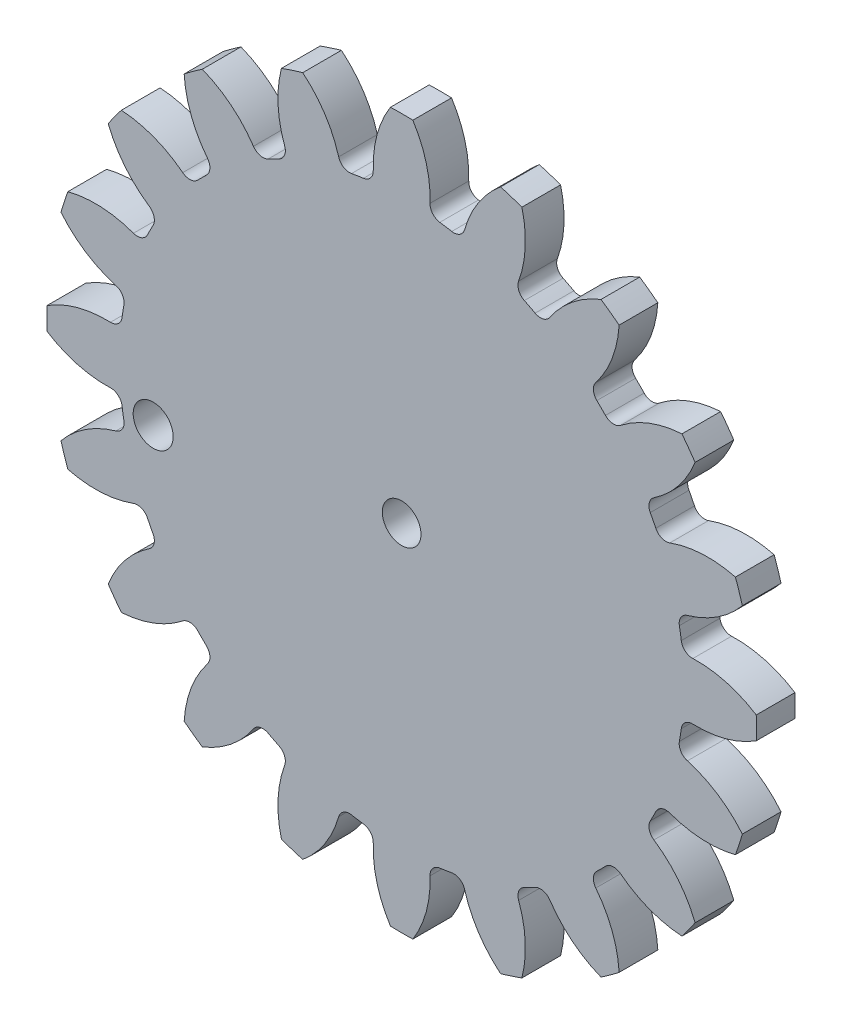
ISO-10303-21;
HEADER;
FILE_DESCRIPTION(('STEP AP214'),'2;1');
FILE_NAME('part.step','',(''),(''),'','','');
FILE_SCHEMA(('AUTOMOTIVE_DESIGN { 1 0 10303 214 1 1 1 1 }'));
ENDSEC;
DATA;
#1=APPLICATION_CONTEXT('core data for automotive mechanical design processes');
#2=APPLICATION_PROTOCOL_DEFINITION('international standard','automotive_design',2000,#1);
#3=PRODUCT_CONTEXT('',#1,'mechanical');
#4=PRODUCT('Part','Part','',(#3));
#5=PRODUCT_RELATED_PRODUCT_CATEGORY('part','',(#4));
#6=PRODUCT_DEFINITION_FORMATION('','',#4);
#7=PRODUCT_DEFINITION_CONTEXT('part definition',#1,'design');
#8=PRODUCT_DEFINITION('design','',#6,#7);
#9=PRODUCT_DEFINITION_SHAPE('','',#8);
#10=(LENGTH_UNIT() NAMED_UNIT(*) SI_UNIT(.MILLI.,.METRE.));
#11=(NAMED_UNIT(*) PLANE_ANGLE_UNIT() SI_UNIT($,.RADIAN.));
#12=(NAMED_UNIT(*) SI_UNIT($,.STERADIAN.) SOLID_ANGLE_UNIT());
#13=UNCERTAINTY_MEASURE_WITH_UNIT(LENGTH_MEASURE(1.E-05),#10,'distance_accuracy_value','');
#14=(GEOMETRIC_REPRESENTATION_CONTEXT(3) GLOBAL_UNCERTAINTY_ASSIGNED_CONTEXT((#13)) GLOBAL_UNIT_ASSIGNED_CONTEXT((#10,
#11,#12)) REPRESENTATION_CONTEXT('',''));
#15=CARTESIAN_POINT('',(0.,0.,0.));
#16=DIRECTION('',(0.,0.,1.));
#17=DIRECTION('',(1.,0.,0.));
#18=AXIS2_PLACEMENT_3D('',#15,#16,#17);
#19=CARTESIAN_POINT('',(0.,0.,6.));
#20=DIRECTION('',(0.,0.,-1.));
#21=DIRECTION('',(-1.,0.,0.));
#22=AXIS2_PLACEMENT_3D('',#19,#20,#21);
#23=CYLINDRICAL_SURFACE('',#22,43.75);
#24=CARTESIAN_POINT('',(0.,0.,6.));
#25=DIRECTION('',(0.,0.,1.));
#26=DIRECTION('',(1.,0.,0.));
#27=AXIS2_PLACEMENT_3D('',#24,#25,#26);
#28=CIRCLE('',#27,43.75);
#29=CARTESIAN_POINT('',(7.77047549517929,43.0544098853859,6.));
#30=VERTEX_POINT('',#29);
#31=CARTESIAN_POINT('',(5.91438298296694,43.3483860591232,6.));
#32=VERTEX_POINT('',#31);
#33=EDGE_CURVE('E1261',#30,#32,#28,.T.);
#34=ORIENTED_EDGE('',*,*,#33,.F.);
#35=DIRECTION('',(0.,0.,-1.));
#36=VECTOR('',#35,1.);
#37=CARTESIAN_POINT('',(7.77047549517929,43.0544098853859,6.));
#38=LINE('',#37,#36);
#39=CARTESIAN_POINT('',(7.77047549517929,43.0544098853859,0.));
#40=VERTEX_POINT('',#39);
#41=EDGE_CURVE('E1305',#30,#40,#38,.T.);
#42=ORIENTED_EDGE('',*,*,#41,.T.);
#43=CARTESIAN_POINT('',(0.,0.,0.));
#44=DIRECTION('',(0.,0.,1.));
#45=DIRECTION('',(1.,0.,0.));
#46=AXIS2_PLACEMENT_3D('',#43,#44,#45);
#47=CIRCLE('',#46,43.75);
#48=CARTESIAN_POINT('',(5.91438298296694,43.3483860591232,0.));
#49=VERTEX_POINT('',#48);
#50=EDGE_CURVE('E1249',#40,#49,#47,.T.);
#51=ORIENTED_EDGE('',*,*,#50,.T.);
#52=DIRECTION('',(0.,0.,-1.));
#53=VECTOR('',#52,1.);
#54=CARTESIAN_POINT('',(5.91438298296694,43.3483860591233,6.));
#55=LINE('',#54,#53);
#56=EDGE_CURVE('E1281',#49,#32,#55,.F.);
#57=ORIENTED_EDGE('',*,*,#56,.T.);
#58=EDGE_LOOP('',(#34,#42,#51,#57));
#59=FACE_BOUND('',#58,.T.);
#60=ADVANCED_FACE('F27',(#59),#23,.T.);
#61=CARTESIAN_POINT('',(-12.7321741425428,45.773478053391,6.));
#62=DIRECTION('',(0.,0.,-1.));
#63=DIRECTION('',(-1.,0.,0.));
#64=AXIS2_PLACEMENT_3D('',#61,#62,#63);
#65=CYLINDRICAL_SURFACE('',#64,17.1457769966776);
#66=CARTESIAN_POINT('',(-12.7321741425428,45.773478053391,6.));
#67=DIRECTION('',(0.,0.,-1.));
#68=DIRECTION('',(-1.,0.,0.));
#69=AXIS2_PLACEMENT_3D('',#66,#67,#68);
#70=CIRCLE('',#69,17.1457769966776);
#71=CARTESIAN_POINT('',(1.73691112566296,54.9725671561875,6.));
#72=VERTEX_POINT('',#71);
#73=CARTESIAN_POINT('',(4.40212935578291,45.1463317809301,6.));
#74=VERTEX_POINT('',#73);
#75=EDGE_CURVE('E1263',#72,#74,#70,.T.);
#76=ORIENTED_EDGE('',*,*,#75,.T.);
#77=DIRECTION('',(0.,0.,-1.));
#78=VECTOR('',#77,1.);
#79=CARTESIAN_POINT('',(4.40212935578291,45.1463317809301,6.));
#80=LINE('',#79,#78);
#81=CARTESIAN_POINT('',(4.40212935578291,45.1463317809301,0.));
#82=VERTEX_POINT('',#81);
#83=EDGE_CURVE('E1278',#74,#82,#80,.T.);
#84=ORIENTED_EDGE('',*,*,#83,.T.);
#85=CARTESIAN_POINT('',(-12.7321741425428,45.773478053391,0.));
#86=DIRECTION('',(0.,0.,-1.));
#87=DIRECTION('',(-1.,0.,0.));
#88=AXIS2_PLACEMENT_3D('',#85,#86,#87);
#89=CIRCLE('',#88,17.1457769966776);
#90=CARTESIAN_POINT('',(1.73691112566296,54.9725671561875,0.));
#91=VERTEX_POINT('',#90);
#92=EDGE_CURVE('E1251',#91,#82,#89,.T.);
#93=ORIENTED_EDGE('',*,*,#92,.F.);
#94=DIRECTION('',(0.,0.,-1.));
#95=VECTOR('',#94,1.);
#96=CARTESIAN_POINT('',(1.73691112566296,54.9725671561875,6.));
#97=LINE('',#96,#95);
#98=EDGE_CURVE('E1276',#72,#91,#97,.T.);
#99=ORIENTED_EDGE('',*,*,#98,.F.);
#100=EDGE_LOOP('',(#76,#84,#93,#99));
#101=FACE_BOUND('',#100,.T.);
#102=ADVANCED_FACE('F1698',(#101),#65,.T.);
#103=CARTESIAN_POINT('',(0.,0.,6.));
#104=DIRECTION('',(0.,0.,-1.));
#105=DIRECTION('',(-1.,0.,0.));
#106=AXIS2_PLACEMENT_3D('',#103,#104,#105);
#107=CYLINDRICAL_SURFACE('',#106,55.);
#108=CARTESIAN_POINT('',(0.,0.,0.));
#109=DIRECTION('',(0.,0.,1.));
#110=DIRECTION('',(1.,0.,0.));
#111=AXIS2_PLACEMENT_3D('',#108,#109,#110);
#112=CIRCLE('',#111,55.);
#113=CARTESIAN_POINT('',(-1.73691112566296,54.9725671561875,0.));
#114=VERTEX_POINT('',#113);
#115=EDGE_CURVE('E1254',#91,#114,#112,.T.);
#116=ORIENTED_EDGE('',*,*,#115,.T.);
#117=DIRECTION('',(0.,0.,-1.));
#118=VECTOR('',#117,1.);
#119=CARTESIAN_POINT('',(-1.73691112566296,54.9725671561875,6.));
#120=LINE('',#119,#118);
#121=CARTESIAN_POINT('',(-1.73691112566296,54.9725671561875,6.));
#122=VERTEX_POINT('',#121);
#123=EDGE_CURVE('E1273',#122,#114,#120,.T.);
#124=ORIENTED_EDGE('',*,*,#123,.F.);
#125=CARTESIAN_POINT('',(0.,0.,6.));
#126=DIRECTION('',(0.,0.,1.));
#127=DIRECTION('',(1.,0.,0.));
#128=AXIS2_PLACEMENT_3D('',#125,#126,#127);
#129=CIRCLE('',#128,55.);
#130=EDGE_CURVE('E1266',#72,#122,#129,.T.);
#131=ORIENTED_EDGE('',*,*,#130,.F.);
#132=ORIENTED_EDGE('',*,*,#98,.T.);
#133=EDGE_LOOP('',(#116,#124,#131,#132));
#134=FACE_BOUND('',#133,.T.);
#135=ADVANCED_FACE('F1694',(#134),#107,.T.);
#136=CARTESIAN_POINT('',(12.7321741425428,45.773478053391,6.));
#137=DIRECTION('',(0.,0.,-1.));
#138=DIRECTION('',(-1.,0.,0.));
#139=AXIS2_PLACEMENT_3D('',#136,#137,#138);
#140=CYLINDRICAL_SURFACE('',#139,17.1457769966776);
#141=CARTESIAN_POINT('',(12.7321741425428,45.773478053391,0.));
#142=DIRECTION('',(0.,0.,1.));
#143=DIRECTION('',(1.,0.,0.));
#144=AXIS2_PLACEMENT_3D('',#141,#142,#143);
#145=CIRCLE('',#144,17.1457769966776);
#146=CARTESIAN_POINT('',(-4.40212935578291,45.1463317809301,0.));
#147=VERTEX_POINT('',#146);
#148=EDGE_CURVE('E1256',#114,#147,#145,.T.);
#149=ORIENTED_EDGE('',*,*,#148,.T.);
#150=DIRECTION('',(0.,0.,-1.));
#151=VECTOR('',#150,1.);
#152=CARTESIAN_POINT('',(-4.40212935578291,45.1463317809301,6.));
#153=LINE('',#152,#151);
#154=CARTESIAN_POINT('',(-4.40212935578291,45.1463317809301,6.));
#155=VERTEX_POINT('',#154);
#156=EDGE_CURVE('E1287',#147,#155,#153,.F.);
#157=ORIENTED_EDGE('',*,*,#156,.T.);
#158=CARTESIAN_POINT('',(12.7321741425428,45.773478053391,6.));
#159=DIRECTION('',(0.,0.,1.));
#160=DIRECTION('',(1.,0.,0.));
#161=AXIS2_PLACEMENT_3D('',#158,#159,#160);
#162=CIRCLE('',#161,17.1457769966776);
#163=EDGE_CURVE('E1268',#122,#155,#162,.T.);
#164=ORIENTED_EDGE('',*,*,#163,.F.);
#165=ORIENTED_EDGE('',*,*,#123,.T.);
#166=EDGE_LOOP('',(#149,#157,#164,#165));
#167=FACE_BOUND('',#166,.T.);
#168=ADVANCED_FACE('F1689',(#167),#140,.T.);
#169=CARTESIAN_POINT('',(0.,0.,6.));
#170=DIRECTION('',(0.,0.,-1.));
#171=DIRECTION('',(-1.,0.,0.));
#172=AXIS2_PLACEMENT_3D('',#169,#170,#171);
#173=CYLINDRICAL_SURFACE('',#172,43.75);
#174=CARTESIAN_POINT('',(0.,0.,0.));
#175=DIRECTION('',(0.,0.,-1.));
#176=DIRECTION('',(-1.,0.,0.));
#177=AXIS2_PLACEMENT_3D('',#174,#175,#176);
#178=CIRCLE('',#177,43.75);
#179=CARTESIAN_POINT('',(-7.7704754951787,43.054409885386,0.));
#180=VERTEX_POINT('',#179);
#181=CARTESIAN_POINT('',(-5.91438298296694,43.3483860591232,0.));
#182=VERTEX_POINT('',#181);
#183=EDGE_CURVE('E1259',#180,#182,#178,.T.);
#184=ORIENTED_EDGE('',*,*,#183,.F.);
#185=DIRECTION('',(0.,0.,-1.));
#186=VECTOR('',#185,1.);
#187=CARTESIAN_POINT('',(-7.7704754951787,43.054409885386,6.));
#188=LINE('',#187,#186);
#189=CARTESIAN_POINT('',(-7.7704754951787,43.054409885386,6.));
#190=VERTEX_POINT('',#189);
#191=EDGE_CURVE('E1660',#180,#190,#188,.F.);
#192=ORIENTED_EDGE('',*,*,#191,.T.);
#193=CARTESIAN_POINT('',(0.,0.,6.));
#194=DIRECTION('',(0.,0.,-1.));
#195=DIRECTION('',(-1.,0.,0.));
#196=AXIS2_PLACEMENT_3D('',#193,#194,#195);
#197=CIRCLE('',#196,43.75);
#198=CARTESIAN_POINT('',(-5.91438298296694,43.3483860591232,6.));
#199=VERTEX_POINT('',#198);
#200=EDGE_CURVE('E1271',#190,#199,#197,.T.);
#201=ORIENTED_EDGE('',*,*,#200,.T.);
#202=DIRECTION('',(0.,0.,-1.));
#203=VECTOR('',#202,1.);
#204=CARTESIAN_POINT('',(-5.91438298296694,43.3483860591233,6.));
#205=LINE('',#204,#203);
#206=EDGE_CURVE('E1284',#199,#182,#205,.T.);
#207=ORIENTED_EDGE('',*,*,#206,.T.);
#208=EDGE_LOOP('',(#184,#192,#201,#207));
#209=FACE_BOUND('',#208,.T.);
#210=ADVANCED_FACE('F1680',(#209),#173,.T.);
#211=CARTESIAN_POINT('',(0.,0.,6.));
#212=DIRECTION('',(0.,0.,1.));
#213=DIRECTION('',(1.,0.,0.));
#214=AXIS2_PLACEMENT_3D('',#211,#212,#213);
#215=PLANE('',#214);
#216=CARTESIAN_POINT('',(-38.5198452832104,-6.10094413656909,6.));
#217=DIRECTION('',(0.,0.,1.));
#218=DIRECTION('',(1.,0.,0.));
#219=AXIS2_PLACEMENT_3D('',#216,#217,#218);
#220=CIRCLE('',#219,3.09999999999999);
#221=CARTESIAN_POINT('',(-35.4198452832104,-6.10094413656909,6.));
#222=VERTEX_POINT('',#221);
#223=EDGE_CURVE('E3124',#222,#222,#220,.T.);
#224=ORIENTED_EDGE('',*,*,#223,.F.);
#225=EDGE_LOOP('',(#224));
#226=FACE_BOUND('',#225,.T.);
#227=CARTESIAN_POINT('',(0.,0.,6.));
#228=DIRECTION('',(0.,0.,1.));
#229=DIRECTION('',(1.,0.,0.));
#230=AXIS2_PLACEMENT_3D('',#227,#228,#229);
#231=CIRCLE('',#230,3.);
#232=CARTESIAN_POINT('',(3.,0.,6.));
#233=VERTEX_POINT('',#232);
#234=EDGE_CURVE('E789',#233,#233,#231,.T.);
#235=ORIENTED_EDGE('',*,*,#234,.F.);
#236=EDGE_LOOP('',(#235));
#237=FACE_BOUND('',#236,.T.);
#238=CARTESIAN_POINT('',(26.2537997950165,39.5987063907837,6.));
#239=DIRECTION('',(0.,0.,1.));
#240=DIRECTION('',(0.951056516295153,-0.309016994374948,0.));
#241=AXIS2_PLACEMENT_3D('',#238,#239,#240);
#242=CIRCLE('',#241,17.1457769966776);
#243=CARTESIAN_POINT('',(15.3355568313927,52.8187532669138,6.));
#244=VERTEX_POINT('',#243);
#245=CARTESIAN_POINT('',(9.7643099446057,44.2970458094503,6.));
#246=VERTEX_POINT('',#245);
#247=EDGE_CURVE('E1241',#244,#246,#242,.T.);
#248=ORIENTED_EDGE('',*,*,#247,.T.);
#249=CARTESIAN_POINT('',(8.08129451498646,44.7765862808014,6.));
#250=DIRECTION('',(0.,0.,1.));
#251=DIRECTION('',(1.,0.,0.));
#252=AXIS2_PLACEMENT_3D('',#249,#250,#251);
#253=CIRCLE('',#252,1.75);
#254=EDGE_CURVE('E1317',#246,#30,#253,.F.);
#255=ORIENTED_EDGE('',*,*,#254,.T.);
#256=ORIENTED_EDGE('',*,*,#33,.T.);
#257=CARTESIAN_POINT('',(6.15095830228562,45.0823215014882,6.));
#258=DIRECTION('',(0.,0.,1.));
#259=DIRECTION('',(1.,0.,0.));
#260=AXIS2_PLACEMENT_3D('',#257,#258,#259);
#261=CIRCLE('',#260,1.75);
#262=EDGE_CURVE('E1292',#32,#74,#261,.F.);
#263=ORIENTED_EDGE('',*,*,#262,.T.);
#264=ORIENTED_EDGE('',*,*,#75,.F.);
#265=ORIENTED_EDGE('',*,*,#130,.T.);
#266=ORIENTED_EDGE('',*,*,#163,.T.);
#267=CARTESIAN_POINT('',(-6.15095830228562,45.0823215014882,6.));
#268=DIRECTION('',(0.,0.,1.));
#269=DIRECTION('',(1.,0.,0.));
#270=AXIS2_PLACEMENT_3D('',#267,#268,#269);
#271=CIRCLE('',#270,1.75);
#272=EDGE_CURVE('E1296',#155,#199,#271,.F.);
#273=ORIENTED_EDGE('',*,*,#272,.T.);
#274=ORIENTED_EDGE('',*,*,#200,.F.);
#275=CARTESIAN_POINT('',(-8.08129451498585,44.7765862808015,6.));
#276=DIRECTION('',(0.,0.,1.));
#277=DIRECTION('',(1.,0.,0.));
#278=AXIS2_PLACEMENT_3D('',#275,#276,#277);
#279=CIRCLE('',#278,1.75);
#280=CARTESIAN_POINT('',(-9.76430994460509,44.2970458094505,6.));
#281=VERTEX_POINT('',#280);
#282=EDGE_CURVE('E1668',#190,#281,#279,.F.);
#283=ORIENTED_EDGE('',*,*,#282,.T.);
#284=CARTESIAN_POINT('',(-26.253799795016,39.5987063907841,6.));
#285=DIRECTION('',(0.,0.,-1.));
#286=DIRECTION('',(-0.951056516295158,-0.309016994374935,0.));
#287=AXIS2_PLACEMENT_3D('',#284,#285,#286);
#288=CIRCLE('',#287,17.1457769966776);
#289=CARTESIAN_POINT('',(-15.335556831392,52.8187532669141,6.));
#290=VERTEX_POINT('',#289);
#291=EDGE_CURVE('E794',#290,#281,#288,.T.);
#292=ORIENTED_EDGE('',*,*,#291,.F.);
#293=CARTESIAN_POINT('',(0.,0.,6.));
#294=DIRECTION('',(0.,0.,1.));
#295=DIRECTION('',(0.951056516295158,0.309016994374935,0.));
#296=AXIS2_PLACEMENT_3D('',#293,#294,#295);
#297=CIRCLE('',#296,55.);
#298=CARTESIAN_POINT('',(-18.6393581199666,51.7452831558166,6.));
#299=VERTEX_POINT('',#298);
#300=EDGE_CURVE('E769',#290,#299,#297,.T.);
#301=ORIENTED_EDGE('',*,*,#300,.T.);
#302=CARTESIAN_POINT('',(-2.03576542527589,47.4676227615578,6.));
#303=DIRECTION('',(0.,0.,1.));
#304=DIRECTION('',(0.951056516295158,0.309016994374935,0.));
#305=AXIS2_PLACEMENT_3D('',#302,#303,#304);
#306=CIRCLE('',#305,17.1457769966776);
#307=CARTESIAN_POINT('',(-18.1376575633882,41.5763802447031,6.));
#308=VERTEX_POINT('',#307);
#309=EDGE_CURVE('E797',#299,#308,#306,.T.);
#310=ORIENTED_EDGE('',*,*,#309,.T.);
#311=CARTESIAN_POINT('',(-19.7811124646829,40.9750849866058,6.));
#312=DIRECTION('',(0.,0.,1.));
#313=DIRECTION('',(1.,0.,0.));
#314=AXIS2_PLACEMENT_3D('',#311,#312,#313);
#315=CIRCLE('',#314,1.75);
#316=CARTESIAN_POINT('',(-19.0203004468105,39.3991201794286,6.));
#317=VERTEX_POINT('',#316);
#318=EDGE_CURVE('E11',#308,#317,#315,.F.);
#319=ORIENTED_EDGE('',*,*,#318,.T.);
#320=CARTESIAN_POINT('',(0.,0.,6.));
#321=DIRECTION('',(0.,0.,1.));
#322=DIRECTION('',(0.809016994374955,0.587785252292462,0.));
#323=AXIS2_PLACEMENT_3D('',#320,#321,#322);
#324=CIRCLE('',#323,43.75);
#325=CARTESIAN_POINT('',(-20.6947056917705,38.5459680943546,6.));
#326=VERTEX_POINT('',#325);
#327=EDGE_CURVE('E809',#317,#326,#324,.T.);
#328=ORIENTED_EDGE('',*,*,#327,.T.);
#329=CARTESIAN_POINT('',(-21.5224939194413,40.0878068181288,6.));
#330=DIRECTION('',(0.,0.,1.));
#331=DIRECTION('',(1.,0.,0.));
#332=AXIS2_PLACEMENT_3D('',#329,#330,#331);
#333=CIRCLE('',#332,1.75);
#334=CARTESIAN_POINT('',(-22.974950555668,39.1116563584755,6.));
#335=VERTEX_POINT('',#334);
#336=EDGE_CURVE('E1653',#326,#335,#333,.F.);
#337=ORIENTED_EDGE('',*,*,#336,.T.);
#338=CARTESIAN_POINT('',(-37.2055206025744,29.5477374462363,6.));
#339=DIRECTION('',(0.,0.,-1.));
#340=DIRECTION('',(-0.809016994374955,-0.587785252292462,0.));
#341=AXIS2_PLACEMENT_3D('',#338,#339,#340);
#342=CIRCLE('',#341,17.1457769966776);
#343=CARTESIAN_POINT('',(-30.9068736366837,45.4946717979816,6.));
#344=VERTEX_POINT('',#343);
#345=EDGE_CURVE('E811',#344,#335,#342,.T.);
#346=ORIENTED_EDGE('',*,*,#345,.F.);
#347=CARTESIAN_POINT('',(0.,0.,6.));
#348=DIRECTION('',(0.,0.,1.));
#349=DIRECTION('',(0.809016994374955,0.587785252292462,0.));
#350=AXIS2_PLACEMENT_3D('',#347,#348,#349);
#351=CIRCLE('',#350,55.);
#352=CARTESIAN_POINT('',(-33.7172548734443,43.4528103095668,6.));
#353=VERTEX_POINT('',#352);
#354=EDGE_CURVE('E814',#344,#353,#351,.T.);
#355=ORIENTED_EDGE('',*,*,#354,.T.);
#356=CARTESIAN_POINT('',(-16.6044300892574,44.5153058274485,6.));
#357=DIRECTION('',(0.,0.,1.));
#358=DIRECTION('',(0.809016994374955,0.587785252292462,0.));
#359=AXIS2_PLACEMENT_3D('',#356,#357,#358);
#360=CIRCLE('',#359,17.1457769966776);
#361=CARTESIAN_POINT('',(-30.0977454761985,33.9366429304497,6.));
#362=VERTEX_POINT('',#361);
#363=EDGE_CURVE('E816',#353,#362,#360,.T.);
#364=ORIENTED_EDGE('',*,*,#363,.T.);
#365=CARTESIAN_POINT('',(-31.4749535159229,32.85692166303,6.));
#366=DIRECTION('',(0.,0.,1.));
#367=DIRECTION('',(1.,0.,0.));
#368=AXIS2_PLACEMENT_3D('',#365,#366,#367);
#369=CIRCLE('',#368,1.75);
#370=CARTESIAN_POINT('',(-30.2643783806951,31.5931939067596,6.));
#371=VERTEX_POINT('',#370);
#372=EDGE_CURVE('E1657',#362,#371,#369,.F.);
#373=ORIENTED_EDGE('',*,*,#372,.T.);
#374=CARTESIAN_POINT('',(0.,0.,6.));
#375=DIRECTION('',(0.,0.,1.));
#376=DIRECTION('',(0.587785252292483,0.80901699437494,0.));
#377=AXIS2_PLACEMENT_3D('',#374,#375,#376);
#378=CIRCLE('',#377,43.75);
#379=CARTESIAN_POINT('',(-31.5931939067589,30.2643783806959,6.));
#380=VERTEX_POINT('',#379);
#381=EDGE_CURVE('E834',#371,#380,#378,.T.);
#382=ORIENTED_EDGE('',*,*,#381,.T.);
#383=CARTESIAN_POINT('',(-32.8569216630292,31.4749535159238,6.));
#384=DIRECTION('',(0.,0.,1.));
#385=DIRECTION('',(1.,0.,0.));
#386=AXIS2_PLACEMENT_3D('',#383,#384,#385);
#387=CIRCLE('',#386,1.75);
#388=CARTESIAN_POINT('',(-33.9366429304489,30.0977454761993,6.));
#389=VERTEX_POINT('',#388);
#390=EDGE_CURVE('E1633',#380,#389,#387,.F.);
#391=ORIENTED_EDGE('',*,*,#390,.T.);
#392=CARTESIAN_POINT('',(-44.5153058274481,16.6044300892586,6.));
#393=DIRECTION('',(0.,0.,-1.));
#394=DIRECTION('',(-0.587785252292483,-0.80901699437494,0.));
#395=AXIS2_PLACEMENT_3D('',#392,#393,#394);
#396=CIRCLE('',#395,17.1457769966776);
#397=CARTESIAN_POINT('',(-43.452810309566,33.7172548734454,6.));
#398=VERTEX_POINT('',#397);
#399=EDGE_CURVE('E836',#398,#389,#396,.T.);
#400=ORIENTED_EDGE('',*,*,#399,.F.);
#401=CARTESIAN_POINT('',(0.,0.,6.));
#402=DIRECTION('',(0.,0.,1.));
#403=DIRECTION('',(0.587785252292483,0.80901699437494,0.));
#404=AXIS2_PLACEMENT_3D('',#401,#402,#403);
#405=CIRCLE('',#404,55.);
#406=CARTESIAN_POINT('',(-45.4946717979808,30.9068736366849,6.));
#407=VERTEX_POINT('',#406);
#408=EDGE_CURVE('E839',#398,#407,#405,.T.);
#409=ORIENTED_EDGE('',*,*,#408,.T.);
#410=CARTESIAN_POINT('',(-29.5477374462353,37.2055206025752,6.));
#411=DIRECTION('',(0.,0.,1.));
#412=DIRECTION('',(0.587785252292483,0.80901699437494,0.));
#413=AXIS2_PLACEMENT_3D('',#410,#411,#412);
#414=CIRCLE('',#413,17.1457769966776);
#415=CARTESIAN_POINT('',(-39.1116563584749,22.974950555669,6.));
#416=VERTEX_POINT('',#415);
#417=EDGE_CURVE('E841',#407,#416,#414,.T.);
#418=ORIENTED_EDGE('',*,*,#417,.T.);
#419=CARTESIAN_POINT('',(-40.0878068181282,21.5224939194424,6.));
#420=DIRECTION('',(0.,0.,1.));
#421=DIRECTION('',(1.,0.,0.));
#422=AXIS2_PLACEMENT_3D('',#419,#420,#421);
#423=CIRCLE('',#422,1.75);
#424=CARTESIAN_POINT('',(-38.545968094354,20.6947056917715,6.));
#425=VERTEX_POINT('',#424);
#426=EDGE_CURVE('E1637',#416,#425,#423,.F.);
#427=ORIENTED_EDGE('',*,*,#426,.T.);
#428=CARTESIAN_POINT('',(0.,0.,6.));
#429=DIRECTION('',(0.,0.,1.));
#430=DIRECTION('',(0.309016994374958,0.95105651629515,0.));
#431=AXIS2_PLACEMENT_3D('',#428,#429,#430);
#432=CIRCLE('',#431,43.75);
#433=CARTESIAN_POINT('',(-39.3991201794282,19.0203004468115,6.));
#434=VERTEX_POINT('',#433);
#435=EDGE_CURVE('E859',#425,#434,#432,.T.);
#436=ORIENTED_EDGE('',*,*,#435,.T.);
#437=CARTESIAN_POINT('',(-40.9750849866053,19.7811124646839,6.));
#438=DIRECTION('',(0.,0.,1.));
#439=DIRECTION('',(1.,0.,0.));
#440=AXIS2_PLACEMENT_3D('',#437,#438,#439);
#441=CIRCLE('',#440,1.75);
#442=CARTESIAN_POINT('',(-41.5763802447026,18.1376575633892,6.));
#443=VERTEX_POINT('',#442);
#444=EDGE_CURVE('E1613',#434,#443,#441,.F.);
#445=ORIENTED_EDGE('',*,*,#444,.T.);
#446=CARTESIAN_POINT('',(-47.4676227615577,2.03576542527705,6.));
#447=DIRECTION('',(0.,0.,-1.));
#448=DIRECTION('',(-0.309016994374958,-0.95105651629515,0.));
#449=AXIS2_PLACEMENT_3D('',#446,#447,#448);
#450=CIRCLE('',#449,17.1457769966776);
#451=CARTESIAN_POINT('',(-51.7452831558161,18.6393581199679,6.));
#452=VERTEX_POINT('',#451);
#453=EDGE_CURVE('E861',#452,#443,#450,.T.);
#454=ORIENTED_EDGE('',*,*,#453,.F.);
#455=CARTESIAN_POINT('',(0.,0.,6.));
#456=DIRECTION('',(0.,0.,1.));
#457=DIRECTION('',(0.309016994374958,0.95105651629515,0.));
#458=AXIS2_PLACEMENT_3D('',#455,#456,#457);
#459=CIRCLE('',#458,55.);
#460=CARTESIAN_POINT('',(-52.8187532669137,15.3355568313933,6.));
#461=VERTEX_POINT('',#460);
#462=EDGE_CURVE('E864',#452,#461,#459,.T.);
#463=ORIENTED_EDGE('',*,*,#462,.T.);
#464=CARTESIAN_POINT('',(-39.5987063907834,26.253799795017,6.));
#465=DIRECTION('',(0.,0.,1.));
#466=DIRECTION('',(0.309016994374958,0.95105651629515,0.));
#467=AXIS2_PLACEMENT_3D('',#464,#465,#466);
#468=CIRCLE('',#467,17.1457769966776);
#469=CARTESIAN_POINT('',(-44.2970458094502,9.76430994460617,6.));
#470=VERTEX_POINT('',#469);
#471=EDGE_CURVE('E866',#461,#470,#468,.T.);
#472=ORIENTED_EDGE('',*,*,#471,.T.);
#473=CARTESIAN_POINT('',(-44.7765862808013,8.08129451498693,6.));
#474=DIRECTION('',(0.,0.,1.));
#475=DIRECTION('',(1.,0.,0.));
#476=AXIS2_PLACEMENT_3D('',#473,#474,#475);
#477=CIRCLE('',#476,1.75);
#478=CARTESIAN_POINT('',(-43.0544098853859,7.77047549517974,6.));
#479=VERTEX_POINT('',#478);
#480=EDGE_CURVE('E1617',#470,#479,#477,.F.);
#481=ORIENTED_EDGE('',*,*,#480,.T.);
#482=CARTESIAN_POINT('',(0.,0.,6.));
#483=DIRECTION('',(0.,0.,1.));
#484=DIRECTION('',(0.,1.,0.));
#485=AXIS2_PLACEMENT_3D('',#482,#483,#484);
#486=CIRCLE('',#485,43.75);
#487=CARTESIAN_POINT('',(-43.3483860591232,5.91438298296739,6.));
#488=VERTEX_POINT('',#487);
#489=EDGE_CURVE('E884',#479,#488,#486,.T.);
#490=ORIENTED_EDGE('',*,*,#489,.T.);
#491=CARTESIAN_POINT('',(-45.0823215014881,6.15095830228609,6.));
#492=DIRECTION('',(0.,0.,1.));
#493=DIRECTION('',(1.,0.,0.));
#494=AXIS2_PLACEMENT_3D('',#491,#492,#493);
#495=CIRCLE('',#494,1.75);
#496=CARTESIAN_POINT('',(-45.1463317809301,4.40212935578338,6.));
#497=VERTEX_POINT('',#496);
#498=EDGE_CURVE('E1593',#488,#497,#495,.F.);
#499=ORIENTED_EDGE('',*,*,#498,.T.);
#500=CARTESIAN_POINT('',(-45.7734780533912,-12.7321741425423,6.));
#501=DIRECTION('',(0.,0.,-1.));
#502=DIRECTION('',(0.,-1.,0.));
#503=AXIS2_PLACEMENT_3D('',#500,#501,#502);
#504=CIRCLE('',#503,17.1457769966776);
#505=CARTESIAN_POINT('',(-54.9725671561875,1.73691112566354,6.));
#506=VERTEX_POINT('',#505);
#507=EDGE_CURVE('E886',#506,#497,#504,.T.);
#508=ORIENTED_EDGE('',*,*,#507,.F.);
#509=CARTESIAN_POINT('',(0.,0.,6.));
#510=DIRECTION('',(0.,0.,1.));
#511=DIRECTION('',(0.,1.,0.));
#512=AXIS2_PLACEMENT_3D('',#509,#510,#511);
#513=CIRCLE('',#512,55.);
#514=CARTESIAN_POINT('',(-54.9725671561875,-1.73691112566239,6.));
#515=VERTEX_POINT('',#514);
#516=EDGE_CURVE('E889',#506,#515,#513,.T.);
#517=ORIENTED_EDGE('',*,*,#516,.T.);
#518=CARTESIAN_POINT('',(-45.7734780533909,12.7321741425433,6.));
#519=DIRECTION('',(0.,0.,1.));
#520=DIRECTION('',(0.,1.,0.));
#521=AXIS2_PLACEMENT_3D('',#518,#519,#520);
#522=CIRCLE('',#521,17.1457769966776);
#523=CARTESIAN_POINT('',(-45.1463317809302,-4.40212935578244,6.));
#524=VERTEX_POINT('',#523);
#525=EDGE_CURVE('E891',#515,#524,#522,.T.);
#526=ORIENTED_EDGE('',*,*,#525,.T.);
#527=CARTESIAN_POINT('',(-45.0823215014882,-6.15095830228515,6.));
#528=DIRECTION('',(0.,0.,1.));
#529=DIRECTION('',(1.,0.,0.));
#530=AXIS2_PLACEMENT_3D('',#527,#528,#529);
#531=CIRCLE('',#530,1.75);
#532=CARTESIAN_POINT('',(-43.3483860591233,-5.91438298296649,6.));
#533=VERTEX_POINT('',#532);
#534=EDGE_CURVE('E1597',#524,#533,#531,.F.);
#535=ORIENTED_EDGE('',*,*,#534,.T.);
#536=CARTESIAN_POINT('',(0.,0.,6.));
#537=DIRECTION('',(0.,0.,1.));
#538=DIRECTION('',(-0.309016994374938,0.951056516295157,0.));
#539=AXIS2_PLACEMENT_3D('',#536,#537,#538);
#540=CIRCLE('',#539,43.75);
#541=CARTESIAN_POINT('',(-43.054409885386,-7.77047549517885,6.));
#542=VERTEX_POINT('',#541);
#543=EDGE_CURVE('E909',#533,#542,#540,.T.);
#544=ORIENTED_EDGE('',*,*,#543,.T.);
#545=CARTESIAN_POINT('',(-44.7765862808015,-8.081294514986,6.));
#546=DIRECTION('',(0.,0.,1.));
#547=DIRECTION('',(1.,0.,0.));
#548=AXIS2_PLACEMENT_3D('',#545,#546,#547);
#549=CIRCLE('',#548,1.75);
#550=CARTESIAN_POINT('',(-44.2970458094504,-9.76430994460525,6.));
#551=VERTEX_POINT('',#550);
#552=EDGE_CURVE('E1573',#542,#551,#549,.F.);
#553=ORIENTED_EDGE('',*,*,#552,.T.);
#554=CARTESIAN_POINT('',(-39.598706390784,-26.2537997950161,6.));
#555=DIRECTION('',(0.,0.,-1.));
#556=DIRECTION('',(0.309016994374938,-0.951056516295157,0.));
#557=AXIS2_PLACEMENT_3D('',#554,#555,#556);
#558=CIRCLE('',#557,17.1457769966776);
#559=CARTESIAN_POINT('',(-52.818753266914,-15.3355568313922,6.));
#560=VERTEX_POINT('',#559);
#561=EDGE_CURVE('E911',#560,#551,#558,.T.);
#562=ORIENTED_EDGE('',*,*,#561,.F.);
#563=CARTESIAN_POINT('',(0.,0.,6.));
#564=DIRECTION('',(0.,0.,1.));
#565=DIRECTION('',(-0.309016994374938,0.951056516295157,0.));
#566=AXIS2_PLACEMENT_3D('',#563,#564,#565);
#567=CIRCLE('',#566,55.);
#568=CARTESIAN_POINT('',(-51.7452831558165,-18.6393581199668,6.));
#569=VERTEX_POINT('',#568);
#570=EDGE_CURVE('E914',#560,#569,#567,.T.);
#571=ORIENTED_EDGE('',*,*,#570,.T.);
#572=CARTESIAN_POINT('',(-47.4676227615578,-2.03576542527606,6.));
#573=DIRECTION('',(0.,0.,1.));
#574=DIRECTION('',(-0.309016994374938,0.951056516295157,0.));
#575=AXIS2_PLACEMENT_3D('',#572,#573,#574);
#576=CIRCLE('',#575,17.1457769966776);
#577=CARTESIAN_POINT('',(-41.576380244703,-18.1376575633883,6.));
#578=VERTEX_POINT('',#577);
#579=EDGE_CURVE('E916',#569,#578,#576,.T.);
#580=ORIENTED_EDGE('',*,*,#579,.T.);
#581=CARTESIAN_POINT('',(-40.9750849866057,-19.7811124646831,6.));
#582=DIRECTION('',(0.,0.,1.));
#583=DIRECTION('',(1.,0.,0.));
#584=AXIS2_PLACEMENT_3D('',#581,#582,#583);
#585=CIRCLE('',#584,1.75);
#586=CARTESIAN_POINT('',(-39.3991201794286,-19.0203004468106,6.));
#587=VERTEX_POINT('',#586);
#588=EDGE_CURVE('E1577',#578,#587,#585,.F.);
#589=ORIENTED_EDGE('',*,*,#588,.T.);
#590=CARTESIAN_POINT('',(0.,0.,6.));
#591=DIRECTION('',(0.,0.,1.));
#592=DIRECTION('',(-0.587785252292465,0.809016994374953,0.));
#593=AXIS2_PLACEMENT_3D('',#590,#591,#592);
#594=CIRCLE('',#593,43.75);
#595=CARTESIAN_POINT('',(-38.5459680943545,-20.6947056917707,6.));
#596=VERTEX_POINT('',#595);
#597=EDGE_CURVE('E934',#587,#596,#594,.T.);
#598=ORIENTED_EDGE('',*,*,#597,.T.);
#599=CARTESIAN_POINT('',(-40.0878068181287,-21.5224939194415,6.));
#600=DIRECTION('',(0.,0.,1.));
#601=DIRECTION('',(1.,0.,0.));
#602=AXIS2_PLACEMENT_3D('',#599,#600,#601);
#603=CIRCLE('',#602,1.75);
#604=CARTESIAN_POINT('',(-39.1116563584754,-22.9749505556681,6.));
#605=VERTEX_POINT('',#604);
#606=EDGE_CURVE('E1553',#596,#605,#603,.F.);
#607=ORIENTED_EDGE('',*,*,#606,.T.);
#608=CARTESIAN_POINT('',(-29.5477374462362,-37.2055206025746,6.));
#609=DIRECTION('',(0.,0.,-1.));
#610=DIRECTION('',(0.587785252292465,-0.809016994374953,0.));
#611=AXIS2_PLACEMENT_3D('',#608,#609,#610);
#612=CIRCLE('',#611,17.1457769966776);
#613=CARTESIAN_POINT('',(-45.4946717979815,-30.9068736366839,6.));
#614=VERTEX_POINT('',#613);
#615=EDGE_CURVE('E936',#614,#605,#612,.T.);
#616=ORIENTED_EDGE('',*,*,#615,.F.);
#617=CARTESIAN_POINT('',(0.,0.,6.));
#618=DIRECTION('',(0.,0.,1.));
#619=DIRECTION('',(-0.587785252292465,0.809016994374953,0.));
#620=AXIS2_PLACEMENT_3D('',#617,#618,#619);
#621=CIRCLE('',#620,55.);
#622=CARTESIAN_POINT('',(-43.4528103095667,-33.7172548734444,6.));
#623=VERTEX_POINT('',#622);
#624=EDGE_CURVE('E939',#614,#623,#621,.T.);
#625=ORIENTED_EDGE('',*,*,#624,.T.);
#626=CARTESIAN_POINT('',(-44.5153058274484,-16.6044300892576,6.));
#627=DIRECTION('',(0.,0.,1.));
#628=DIRECTION('',(-0.587785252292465,0.809016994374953,0.));
#629=AXIS2_PLACEMENT_3D('',#626,#627,#628);
#630=CIRCLE('',#629,17.1457769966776);
#631=CARTESIAN_POINT('',(-33.9366429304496,-30.0977454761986,6.));
#632=VERTEX_POINT('',#631);
#633=EDGE_CURVE('E941',#623,#632,#630,.T.);
#634=ORIENTED_EDGE('',*,*,#633,.T.);
#635=CARTESIAN_POINT('',(-32.8569216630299,-31.474953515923,6.));
#636=DIRECTION('',(0.,0.,1.));
#637=DIRECTION('',(1.,0.,0.));
#638=AXIS2_PLACEMENT_3D('',#635,#636,#637);
#639=CIRCLE('',#638,1.75);
#640=CARTESIAN_POINT('',(-31.5931939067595,-30.2643783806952,6.));
#641=VERTEX_POINT('',#640);
#642=EDGE_CURVE('E1557',#632,#641,#639,.F.);
#643=ORIENTED_EDGE('',*,*,#642,.T.);
#644=CARTESIAN_POINT('',(0.,0.,6.));
#645=DIRECTION('',(0.,0.,1.));
#646=DIRECTION('',(-0.809016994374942,0.58778525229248,0.));
#647=AXIS2_PLACEMENT_3D('',#644,#645,#646);
#648=CIRCLE('',#647,43.75);
#649=CARTESIAN_POINT('',(-30.2643783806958,-31.593193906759,6.));
#650=VERTEX_POINT('',#649);
#651=EDGE_CURVE('E959',#641,#650,#648,.T.);
#652=ORIENTED_EDGE('',*,*,#651,.T.);
#653=CARTESIAN_POINT('',(-31.4749535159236,-32.8569216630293,6.));
#654=DIRECTION('',(0.,0.,1.));
#655=DIRECTION('',(1.,0.,0.));
#656=AXIS2_PLACEMENT_3D('',#653,#654,#655);
#657=CIRCLE('',#656,1.75);
#658=CARTESIAN_POINT('',(-30.0977454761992,-33.936642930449,6.));
#659=VERTEX_POINT('',#658);
#660=EDGE_CURVE('E1533',#650,#659,#657,.F.);
#661=ORIENTED_EDGE('',*,*,#660,.T.);
#662=CARTESIAN_POINT('',(-16.6044300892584,-44.5153058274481,6.));
#663=DIRECTION('',(0.,0.,-1.));
#664=DIRECTION('',(0.809016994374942,-0.58778525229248,0.));
#665=AXIS2_PLACEMENT_3D('',#662,#663,#664);
#666=CIRCLE('',#665,17.1457769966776);
#667=CARTESIAN_POINT('',(-33.7172548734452,-43.4528103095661,6.));
#668=VERTEX_POINT('',#667);
#669=EDGE_CURVE('E961',#668,#659,#666,.T.);
#670=ORIENTED_EDGE('',*,*,#669,.F.);
#671=CARTESIAN_POINT('',(0.,0.,6.));
#672=DIRECTION('',(0.,0.,1.));
#673=DIRECTION('',(-0.809016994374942,0.58778525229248,0.));
#674=AXIS2_PLACEMENT_3D('',#671,#672,#673);
#675=CIRCLE('',#674,55.);
#676=CARTESIAN_POINT('',(-30.9068736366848,-45.4946717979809,6.));
#677=VERTEX_POINT('',#676);
#678=EDGE_CURVE('E964',#668,#677,#675,.T.);
#679=ORIENTED_EDGE('',*,*,#678,.T.);
#680=CARTESIAN_POINT('',(-37.2055206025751,-29.5477374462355,6.));
#681=DIRECTION('',(0.,0.,1.));
#682=DIRECTION('',(-0.809016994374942,0.58778525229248,0.));
#683=AXIS2_PLACEMENT_3D('',#680,#681,#682);
#684=CIRCLE('',#683,17.1457769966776);
#685=CARTESIAN_POINT('',(-22.9749505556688,-39.111656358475,6.));
#686=VERTEX_POINT('',#685);
#687=EDGE_CURVE('E966',#677,#686,#684,.T.);
#688=ORIENTED_EDGE('',*,*,#687,.T.);
#689=CARTESIAN_POINT('',(-21.5224939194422,-40.0878068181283,6.));
#690=DIRECTION('',(0.,0.,1.));
#691=DIRECTION('',(1.,0.,0.));
#692=AXIS2_PLACEMENT_3D('',#689,#690,#691);
#693=CIRCLE('',#692,1.75);
#694=CARTESIAN_POINT('',(-20.6947056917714,-38.5459680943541,6.));
#695=VERTEX_POINT('',#694);
#696=EDGE_CURVE('E1537',#686,#695,#693,.F.);
#697=ORIENTED_EDGE('',*,*,#696,.T.);
#698=CARTESIAN_POINT('',(0.,0.,6.));
#699=DIRECTION('',(0.,0.,1.));
#700=DIRECTION('',(-0.951056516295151,0.309016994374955,0.));
#701=AXIS2_PLACEMENT_3D('',#698,#699,#700);
#702=CIRCLE('',#701,43.75);
#703=CARTESIAN_POINT('',(-19.0203004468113,-39.3991201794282,6.));
#704=VERTEX_POINT('',#703);
#705=EDGE_CURVE('E984',#695,#704,#702,.T.);
#706=ORIENTED_EDGE('',*,*,#705,.T.);
#707=CARTESIAN_POINT('',(-19.7811124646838,-40.9750849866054,6.));
#708=DIRECTION('',(0.,0.,1.));
#709=DIRECTION('',(1.,0.,0.));
#710=AXIS2_PLACEMENT_3D('',#707,#708,#709);
#711=CIRCLE('',#710,1.75);
#712=CARTESIAN_POINT('',(-18.137657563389,-41.5763802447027,6.));
#713=VERTEX_POINT('',#712);
#714=EDGE_CURVE('E1513',#704,#713,#711,.F.);
#715=ORIENTED_EDGE('',*,*,#714,.T.);
#716=CARTESIAN_POINT('',(-2.03576542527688,-47.4676227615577,6.));
#717=DIRECTION('',(0.,0.,-1.));
#718=DIRECTION('',(0.951056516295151,-0.309016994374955,0.));
#719=AXIS2_PLACEMENT_3D('',#716,#717,#718);
#720=CIRCLE('',#719,17.1457769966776);
#721=CARTESIAN_POINT('',(-18.6393581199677,-51.7452831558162,6.));
#722=VERTEX_POINT('',#721);
#723=EDGE_CURVE('E986',#722,#713,#720,.T.);
#724=ORIENTED_EDGE('',*,*,#723,.F.);
#725=CARTESIAN_POINT('',(0.,0.,6.));
#726=DIRECTION('',(0.,0.,1.));
#727=DIRECTION('',(-0.951056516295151,0.309016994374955,0.));
#728=AXIS2_PLACEMENT_3D('',#725,#726,#727);
#729=CIRCLE('',#728,55.);
#730=CARTESIAN_POINT('',(-15.3355568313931,-52.8187532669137,6.));
#731=VERTEX_POINT('',#730);
#732=EDGE_CURVE('E989',#722,#731,#729,.T.);
#733=ORIENTED_EDGE('',*,*,#732,.T.);
#734=CARTESIAN_POINT('',(-26.2537997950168,-39.5987063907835,6.));
#735=DIRECTION('',(0.,0.,1.));
#736=DIRECTION('',(-0.951056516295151,0.309016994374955,0.));
#737=AXIS2_PLACEMENT_3D('',#734,#735,#736);
#738=CIRCLE('',#737,17.1457769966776);
#739=CARTESIAN_POINT('',(-9.76430994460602,-44.2970458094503,6.));
#740=VERTEX_POINT('',#739);
#741=EDGE_CURVE('E991',#731,#740,#738,.T.);
#742=ORIENTED_EDGE('',*,*,#741,.T.);
#743=CARTESIAN_POINT('',(-8.08129451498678,-44.7765862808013,6.));
#744=DIRECTION('',(0.,0.,1.));
#745=DIRECTION('',(1.,0.,0.));
#746=AXIS2_PLACEMENT_3D('',#743,#744,#745);
#747=CIRCLE('',#746,1.75);
#748=CARTESIAN_POINT('',(-7.7704754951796,-43.0544098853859,6.));
#749=VERTEX_POINT('',#748);
#750=EDGE_CURVE('E1517',#740,#749,#747,.F.);
#751=ORIENTED_EDGE('',*,*,#750,.T.);
#752=CARTESIAN_POINT('',(0.,0.,6.));
#753=DIRECTION('',(0.,0.,1.));
#754=DIRECTION('',(-1.,0.,0.));
#755=AXIS2_PLACEMENT_3D('',#752,#753,#754);
#756=CIRCLE('',#755,43.75);
#757=CARTESIAN_POINT('',(-5.91438298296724,-43.3483860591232,6.));
#758=VERTEX_POINT('',#757);
#759=EDGE_CURVE('E1009',#749,#758,#756,.T.);
#760=ORIENTED_EDGE('',*,*,#759,.T.);
#761=CARTESIAN_POINT('',(-6.15095830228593,-45.0823215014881,6.));
#762=DIRECTION('',(0.,0.,1.));
#763=DIRECTION('',(1.,0.,0.));
#764=AXIS2_PLACEMENT_3D('',#761,#762,#763);
#765=CIRCLE('',#764,1.75);
#766=CARTESIAN_POINT('',(-4.40212935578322,-45.1463317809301,6.));
#767=VERTEX_POINT('',#766);
#768=EDGE_CURVE('E1493',#758,#767,#765,.F.);
#769=ORIENTED_EDGE('',*,*,#768,.T.);
#770=CARTESIAN_POINT('',(12.7321741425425,-45.7734780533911,6.));
#771=DIRECTION('',(0.,0.,-1.));
#772=DIRECTION('',(1.,0.,0.));
#773=AXIS2_PLACEMENT_3D('',#770,#771,#772);
#774=CIRCLE('',#773,17.1457769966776);
#775=CARTESIAN_POINT('',(-1.73691112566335,-54.9725671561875,6.));
#776=VERTEX_POINT('',#775);
#777=EDGE_CURVE('E1011',#776,#767,#774,.T.);
#778=ORIENTED_EDGE('',*,*,#777,.F.);
#779=CARTESIAN_POINT('',(0.,0.,6.));
#780=DIRECTION('',(0.,0.,1.));
#781=DIRECTION('',(-1.,0.,0.));
#782=AXIS2_PLACEMENT_3D('',#779,#780,#781);
#783=CIRCLE('',#782,55.);
#784=CARTESIAN_POINT('',(1.73691112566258,-54.9725671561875,6.));
#785=VERTEX_POINT('',#784);
#786=EDGE_CURVE('E1014',#776,#785,#783,.T.);
#787=ORIENTED_EDGE('',*,*,#786,.T.);
#788=CARTESIAN_POINT('',(-12.7321741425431,-45.7734780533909,6.));
#789=DIRECTION('',(0.,0.,1.));
#790=DIRECTION('',(-1.,0.,0.));
#791=AXIS2_PLACEMENT_3D('',#788,#789,#790);
#792=CIRCLE('',#791,17.1457769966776);
#793=CARTESIAN_POINT('',(4.40212935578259,-45.1463317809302,6.));
#794=VERTEX_POINT('',#793);
#795=EDGE_CURVE('E1016',#785,#794,#792,.T.);
#796=ORIENTED_EDGE('',*,*,#795,.T.);
#797=CARTESIAN_POINT('',(6.15095830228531,-45.0823215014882,6.));
#798=DIRECTION('',(0.,0.,1.));
#799=DIRECTION('',(1.,0.,0.));
#800=AXIS2_PLACEMENT_3D('',#797,#798,#799);
#801=CIRCLE('',#800,1.75);
#802=CARTESIAN_POINT('',(5.91438298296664,-43.3483860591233,6.));
#803=VERTEX_POINT('',#802);
#804=EDGE_CURVE('E1497',#794,#803,#801,.F.);
#805=ORIENTED_EDGE('',*,*,#804,.T.);
#806=CARTESIAN_POINT('',(0.,0.,6.));
#807=DIRECTION('',(0.,0.,1.));
#808=DIRECTION('',(-0.951056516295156,-0.309016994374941,0.));
#809=AXIS2_PLACEMENT_3D('',#806,#807,#808);
#810=CIRCLE('',#809,43.75);
#811=CARTESIAN_POINT('',(7.77047549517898,-43.054409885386,6.));
#812=VERTEX_POINT('',#811);
#813=EDGE_CURVE('E1034',#803,#812,#810,.T.);
#814=ORIENTED_EDGE('',*,*,#813,.T.);
#815=CARTESIAN_POINT('',(8.08129451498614,-44.7765862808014,6.));
#816=DIRECTION('',(0.,0.,1.));
#817=DIRECTION('',(1.,0.,0.));
#818=AXIS2_PLACEMENT_3D('',#815,#816,#817);
#819=CIRCLE('',#818,1.75);
#820=CARTESIAN_POINT('',(9.76430994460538,-44.2970458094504,6.));
#821=VERTEX_POINT('',#820);
#822=EDGE_CURVE('E1473',#812,#821,#819,.F.);
#823=ORIENTED_EDGE('',*,*,#822,.T.);
#824=CARTESIAN_POINT('',(26.2537997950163,-39.5987063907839,6.));
#825=DIRECTION('',(0.,0.,-1.));
#826=DIRECTION('',(0.951056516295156,0.309016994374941,0.));
#827=AXIS2_PLACEMENT_3D('',#824,#825,#826);
#828=CIRCLE('',#827,17.1457769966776);
#829=CARTESIAN_POINT('',(15.3355568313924,-52.818753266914,6.));
#830=VERTEX_POINT('',#829);
#831=EDGE_CURVE('E1036',#830,#821,#828,.T.);
#832=ORIENTED_EDGE('',*,*,#831,.F.);
#833=CARTESIAN_POINT('',(0.,0.,6.));
#834=DIRECTION('',(0.,0.,1.));
#835=DIRECTION('',(-0.951056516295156,-0.309016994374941,0.));
#836=AXIS2_PLACEMENT_3D('',#833,#834,#835);
#837=CIRCLE('',#836,55.);
#838=CARTESIAN_POINT('',(18.639358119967,-51.7452831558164,6.));
#839=VERTEX_POINT('',#838);
#840=EDGE_CURVE('E1039',#830,#839,#837,.T.);
#841=ORIENTED_EDGE('',*,*,#840,.T.);
#842=CARTESIAN_POINT('',(2.0357654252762,-47.4676227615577,6.));
#843=DIRECTION('',(0.,0.,1.));
#844=DIRECTION('',(-0.951056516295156,-0.309016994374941,0.));
#845=AXIS2_PLACEMENT_3D('',#842,#843,#844);
#846=CIRCLE('',#845,17.1457769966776);
#847=CARTESIAN_POINT('',(18.1376575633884,-41.5763802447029,6.));
#848=VERTEX_POINT('',#847);
#849=EDGE_CURVE('E1041',#839,#848,#846,.T.);
#850=ORIENTED_EDGE('',*,*,#849,.T.);
#851=CARTESIAN_POINT('',(19.7811124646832,-40.9750849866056,6.));
#852=DIRECTION('',(0.,0.,1.));
#853=DIRECTION('',(1.,0.,0.));
#854=AXIS2_PLACEMENT_3D('',#851,#852,#853);
#855=CIRCLE('',#854,1.75);
#856=CARTESIAN_POINT('',(19.0203004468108,-39.3991201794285,6.));
#857=VERTEX_POINT('',#856);
#858=EDGE_CURVE('E1477',#848,#857,#855,.F.);
#859=ORIENTED_EDGE('',*,*,#858,.T.);
#860=CARTESIAN_POINT('',(0.,0.,6.));
#861=DIRECTION('',(0.,0.,1.));
#862=DIRECTION('',(-0.809016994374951,-0.587785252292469,0.));
#863=AXIS2_PLACEMENT_3D('',#860,#861,#862);
#864=CIRCLE('',#863,43.75);
#865=CARTESIAN_POINT('',(20.6947056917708,-38.5459680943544,6.));
#866=VERTEX_POINT('',#865);
#867=EDGE_CURVE('E1059',#857,#866,#864,.T.);
#868=ORIENTED_EDGE('',*,*,#867,.T.);
#869=CARTESIAN_POINT('',(21.5224939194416,-40.0878068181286,6.));
#870=DIRECTION('',(0.,0.,1.));
#871=DIRECTION('',(1.,0.,0.));
#872=AXIS2_PLACEMENT_3D('',#869,#870,#871);
#873=CIRCLE('',#872,1.75);
#874=CARTESIAN_POINT('',(22.9749505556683,-39.1116563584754,6.));
#875=VERTEX_POINT('',#874);
#876=EDGE_CURVE('E1453',#866,#875,#873,.F.);
#877=ORIENTED_EDGE('',*,*,#876,.T.);
#878=CARTESIAN_POINT('',(37.2055206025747,-29.547737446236,6.));
#879=DIRECTION('',(0.,0.,-1.));
#880=DIRECTION('',(0.809016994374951,0.587785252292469,0.));
#881=AXIS2_PLACEMENT_3D('',#878,#879,#880);
#882=CIRCLE('',#881,17.1457769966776);
#883=CARTESIAN_POINT('',(30.9068736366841,-45.4946717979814,6.));
#884=VERTEX_POINT('',#883);
#885=EDGE_CURVE('E1061',#884,#875,#882,.T.);
#886=ORIENTED_EDGE('',*,*,#885,.F.);
#887=CARTESIAN_POINT('',(0.,0.,6.));
#888=DIRECTION('',(0.,0.,1.));
#889=DIRECTION('',(-0.809016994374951,-0.587785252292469,0.));
#890=AXIS2_PLACEMENT_3D('',#887,#888,#889);
#891=CIRCLE('',#890,55.);
#892=CARTESIAN_POINT('',(33.7172548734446,-43.4528103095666,6.));
#893=VERTEX_POINT('',#892);
#894=EDGE_CURVE('E1064',#884,#893,#891,.T.);
#895=ORIENTED_EDGE('',*,*,#894,.T.);
#896=CARTESIAN_POINT('',(16.6044300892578,-44.5153058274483,6.));
#897=DIRECTION('',(0.,0.,1.));
#898=DIRECTION('',(-0.809016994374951,-0.587785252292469,0.));
#899=AXIS2_PLACEMENT_3D('',#896,#897,#898);
#900=CIRCLE('',#899,17.1457769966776);
#901=CARTESIAN_POINT('',(30.0977454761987,-33.9366429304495,6.));
#902=VERTEX_POINT('',#901);
#903=EDGE_CURVE('E1066',#893,#902,#900,.T.);
#904=ORIENTED_EDGE('',*,*,#903,.T.);
#905=CARTESIAN_POINT('',(31.4749535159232,-32.8569216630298,6.));
#906=DIRECTION('',(0.,0.,1.));
#907=DIRECTION('',(1.,0.,0.));
#908=AXIS2_PLACEMENT_3D('',#905,#906,#907);
#909=CIRCLE('',#908,1.75);
#910=CARTESIAN_POINT('',(30.2643783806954,-31.5931939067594,6.));
#911=VERTEX_POINT('',#910);
#912=EDGE_CURVE('E1457',#902,#911,#909,.F.);
#913=ORIENTED_EDGE('',*,*,#912,.T.);
#914=CARTESIAN_POINT('',(0.,0.,6.));
#915=DIRECTION('',(0.,0.,1.));
#916=DIRECTION('',(-0.587785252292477,-0.809016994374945,0.));
#917=AXIS2_PLACEMENT_3D('',#914,#915,#916);
#918=CIRCLE('',#917,43.75);
#919=CARTESIAN_POINT('',(31.5931939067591,-30.2643783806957,6.));
#920=VERTEX_POINT('',#919);
#921=EDGE_CURVE('E1084',#911,#920,#918,.T.);
#922=ORIENTED_EDGE('',*,*,#921,.T.);
#923=CARTESIAN_POINT('',(32.8569216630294,-31.4749535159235,6.));
#924=DIRECTION('',(0.,0.,1.));
#925=DIRECTION('',(1.,0.,0.));
#926=AXIS2_PLACEMENT_3D('',#923,#924,#925);
#927=CIRCLE('',#926,1.75);
#928=CARTESIAN_POINT('',(33.9366429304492,-30.0977454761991,6.));
#929=VERTEX_POINT('',#928);
#930=EDGE_CURVE('E1433',#920,#929,#927,.F.);
#931=ORIENTED_EDGE('',*,*,#930,.T.);
#932=CARTESIAN_POINT('',(44.5153058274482,-16.6044300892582,6.));
#933=DIRECTION('',(0.,0.,-1.));
#934=DIRECTION('',(0.587785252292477,0.809016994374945,0.));
#935=AXIS2_PLACEMENT_3D('',#932,#933,#934);
#936=CIRCLE('',#935,17.1457769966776);
#937=CARTESIAN_POINT('',(43.4528103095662,-33.7172548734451,6.));
#938=VERTEX_POINT('',#937);
#939=EDGE_CURVE('E1086',#938,#929,#936,.T.);
#940=ORIENTED_EDGE('',*,*,#939,.F.);
#941=CARTESIAN_POINT('',(0.,0.,6.));
#942=DIRECTION('',(0.,0.,1.));
#943=DIRECTION('',(-0.587785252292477,-0.809016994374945,0.));
#944=AXIS2_PLACEMENT_3D('',#941,#942,#943);
#945=CIRCLE('',#944,55.);
#946=CARTESIAN_POINT('',(45.494671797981,-30.9068736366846,6.));
#947=VERTEX_POINT('',#946);
#948=EDGE_CURVE('E1089',#938,#947,#945,.T.);
#949=ORIENTED_EDGE('',*,*,#948,.T.);
#950=CARTESIAN_POINT('',(29.5477374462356,-37.205520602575,6.));
#951=DIRECTION('',(0.,0.,1.));
#952=DIRECTION('',(-0.587785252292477,-0.809016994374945,0.));
#953=AXIS2_PLACEMENT_3D('',#950,#951,#952);
#954=CIRCLE('',#953,17.1457769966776);
#955=CARTESIAN_POINT('',(39.1116563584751,-22.9749505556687,6.));
#956=VERTEX_POINT('',#955);
#957=EDGE_CURVE('E1091',#947,#956,#954,.T.);
#958=ORIENTED_EDGE('',*,*,#957,.T.);
#959=CARTESIAN_POINT('',(40.0878068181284,-21.5224939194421,6.));
#960=DIRECTION('',(0.,0.,1.));
#961=DIRECTION('',(1.,0.,0.));
#962=AXIS2_PLACEMENT_3D('',#959,#960,#961);
#963=CIRCLE('',#962,1.75);
#964=CARTESIAN_POINT('',(38.5459680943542,-20.6947056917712,6.));
#965=VERTEX_POINT('',#964);
#966=EDGE_CURVE('E1437',#956,#965,#963,.F.);
#967=ORIENTED_EDGE('',*,*,#966,.T.);
#968=CARTESIAN_POINT('',(0.,0.,6.));
#969=DIRECTION('',(0.,0.,1.));
#970=DIRECTION('',(-0.309016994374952,-0.951056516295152,0.));
#971=AXIS2_PLACEMENT_3D('',#968,#969,#970);
#972=CIRCLE('',#971,43.75);
#973=CARTESIAN_POINT('',(39.3991201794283,-19.0203004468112,6.));
#974=VERTEX_POINT('',#973);
#975=EDGE_CURVE('E1109',#965,#974,#972,.T.);
#976=ORIENTED_EDGE('',*,*,#975,.T.);
#977=CARTESIAN_POINT('',(40.9750849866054,-19.7811124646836,6.));
#978=DIRECTION('',(0.,0.,1.));
#979=DIRECTION('',(1.,0.,0.));
#980=AXIS2_PLACEMENT_3D('',#977,#978,#979);
#981=CIRCLE('',#980,1.75);
#982=CARTESIAN_POINT('',(41.5763802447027,-18.1376575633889,6.));
#983=VERTEX_POINT('',#982);
#984=EDGE_CURVE('E1413',#974,#983,#981,.F.);
#985=ORIENTED_EDGE('',*,*,#984,.T.);
#986=CARTESIAN_POINT('',(47.4676227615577,-2.03576542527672,6.));
#987=DIRECTION('',(0.,0.,-1.));
#988=DIRECTION('',(0.309016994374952,0.951056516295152,0.));
#989=AXIS2_PLACEMENT_3D('',#986,#987,#988);
#990=CIRCLE('',#989,17.1457769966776);
#991=CARTESIAN_POINT('',(51.7452831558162,-18.6393581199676,6.));
#992=VERTEX_POINT('',#991);
#993=EDGE_CURVE('E1111',#992,#983,#990,.T.);
#994=ORIENTED_EDGE('',*,*,#993,.F.);
#995=CARTESIAN_POINT('',(0.,0.,6.));
#996=DIRECTION('',(0.,0.,1.));
#997=DIRECTION('',(-0.309016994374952,-0.951056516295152,0.));
#998=AXIS2_PLACEMENT_3D('',#995,#996,#997);
#999=CIRCLE('',#998,55.);
#1000=CARTESIAN_POINT('',(52.8187532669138,-15.3355568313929,6.));
#1001=VERTEX_POINT('',#1000);
#1002=EDGE_CURVE('E1114',#992,#1001,#999,.T.);
#1003=ORIENTED_EDGE('',*,*,#1002,.T.);
#1004=CARTESIAN_POINT('',(39.5987063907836,-26.2537997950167,6.));
#1005=DIRECTION('',(0.,0.,1.));
#1006=DIRECTION('',(-0.309016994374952,-0.951056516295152,0.));
#1007=AXIS2_PLACEMENT_3D('',#1004,#1005,#1006);
#1008=CIRCLE('',#1007,17.1457769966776);
#1009=CARTESIAN_POINT('',(44.2970458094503,-9.76430994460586,6.));
#1010=VERTEX_POINT('',#1009);
#1011=EDGE_CURVE('E1116',#1001,#1010,#1008,.T.);
#1012=ORIENTED_EDGE('',*,*,#1011,.T.);
#1013=CARTESIAN_POINT('',(44.7765862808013,-8.08129451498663,6.));
#1014=DIRECTION('',(0.,0.,1.));
#1015=DIRECTION('',(1.,0.,0.));
#1016=AXIS2_PLACEMENT_3D('',#1013,#1014,#1015);
#1017=CIRCLE('',#1016,1.75);
#1018=CARTESIAN_POINT('',(43.0544098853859,-7.77047549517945,6.));
#1019=VERTEX_POINT('',#1018);
#1020=EDGE_CURVE('E1417',#1010,#1019,#1017,.F.);
#1021=ORIENTED_EDGE('',*,*,#1020,.T.);
#1022=CARTESIAN_POINT('',(0.,0.,6.));
#1023=DIRECTION('',(0.,0.,1.));
#1024=DIRECTION('',(0.,-1.,0.));
#1025=AXIS2_PLACEMENT_3D('',#1022,#1023,#1024);
#1026=CIRCLE('',#1025,43.75);
#1027=CARTESIAN_POINT('',(43.3483860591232,-5.91438298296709,6.));
#1028=VERTEX_POINT('',#1027);
#1029=EDGE_CURVE('E1134',#1019,#1028,#1026,.T.);
#1030=ORIENTED_EDGE('',*,*,#1029,.T.);
#1031=CARTESIAN_POINT('',(45.0823215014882,-6.15095830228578,6.));
#1032=DIRECTION('',(0.,0.,1.));
#1033=DIRECTION('',(1.,0.,0.));
#1034=AXIS2_PLACEMENT_3D('',#1031,#1032,#1033);
#1035=CIRCLE('',#1034,1.75);
#1036=CARTESIAN_POINT('',(45.1463317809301,-4.40212935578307,6.));
#1037=VERTEX_POINT('',#1036);
#1038=EDGE_CURVE('E1393',#1028,#1037,#1035,.F.);
#1039=ORIENTED_EDGE('',*,*,#1038,.T.);
#1040=CARTESIAN_POINT('',(45.7734780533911,12.7321741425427,6.));
#1041=DIRECTION('',(0.,0.,-1.));
#1042=DIRECTION('',(0.,1.,0.));
#1043=AXIS2_PLACEMENT_3D('',#1040,#1041,#1042);
#1044=CIRCLE('',#1043,17.1457769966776);
#1045=CARTESIAN_POINT('',(54.9725671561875,-1.73691112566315,6.));
#1046=VERTEX_POINT('',#1045);
#1047=EDGE_CURVE('E1136',#1046,#1037,#1044,.T.);
#1048=ORIENTED_EDGE('',*,*,#1047,.F.);
#1049=CARTESIAN_POINT('',(0.,0.,6.));
#1050=DIRECTION('',(0.,0.,1.));
#1051=DIRECTION('',(0.,-1.,0.));
#1052=AXIS2_PLACEMENT_3D('',#1049,#1050,#1051);
#1053=CIRCLE('',#1052,55.);
#1054=CARTESIAN_POINT('',(54.9725671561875,1.73691112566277,6.));
#1055=VERTEX_POINT('',#1054);
#1056=EDGE_CURVE('E1139',#1046,#1055,#1053,.T.);
#1057=ORIENTED_EDGE('',*,*,#1056,.T.);
#1058=CARTESIAN_POINT('',(45.773478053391,-12.732174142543,6.));
#1059=DIRECTION('',(0.,0.,1.));
#1060=DIRECTION('',(0.,-1.,0.));
#1061=AXIS2_PLACEMENT_3D('',#1058,#1059,#1060);
#1062=CIRCLE('',#1061,17.1457769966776);
#1063=CARTESIAN_POINT('',(45.1463317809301,4.40212935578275,6.));
#1064=VERTEX_POINT('',#1063);
#1065=EDGE_CURVE('E1141',#1055,#1064,#1062,.T.);
#1066=ORIENTED_EDGE('',*,*,#1065,.T.);
#1067=CARTESIAN_POINT('',(45.0823215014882,6.15095830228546,6.));
#1068=DIRECTION('',(0.,0.,1.));
#1069=DIRECTION('',(1.,0.,0.));
#1070=AXIS2_PLACEMENT_3D('',#1067,#1068,#1069);
#1071=CIRCLE('',#1070,1.75);
#1072=CARTESIAN_POINT('',(43.3483860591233,5.91438298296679,6.));
#1073=VERTEX_POINT('',#1072);
#1074=EDGE_CURVE('E1397',#1064,#1073,#1071,.F.);
#1075=ORIENTED_EDGE('',*,*,#1074,.T.);
#1076=CARTESIAN_POINT('',(0.,0.,6.));
#1077=DIRECTION('',(0.,0.,1.));
#1078=DIRECTION('',(0.309016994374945,-0.951056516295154,0.));
#1079=AXIS2_PLACEMENT_3D('',#1076,#1077,#1078);
#1080=CIRCLE('',#1079,43.75);
#1081=CARTESIAN_POINT('',(43.054409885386,7.77047549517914,6.));
#1082=VERTEX_POINT('',#1081);
#1083=EDGE_CURVE('E1159',#1073,#1082,#1080,.T.);
#1084=ORIENTED_EDGE('',*,*,#1083,.T.);
#1085=CARTESIAN_POINT('',(44.7765862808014,8.08129451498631,6.));
#1086=DIRECTION('',(0.,0.,1.));
#1087=DIRECTION('',(1.,0.,0.));
#1088=AXIS2_PLACEMENT_3D('',#1085,#1086,#1087);
#1089=CIRCLE('',#1088,1.75);
#1090=CARTESIAN_POINT('',(44.2970458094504,9.76430994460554,6.));
#1091=VERTEX_POINT('',#1090);
#1092=EDGE_CURVE('E1373',#1082,#1091,#1089,.F.);
#1093=ORIENTED_EDGE('',*,*,#1092,.T.);
#1094=CARTESIAN_POINT('',(39.5987063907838,26.2537997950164,6.));
#1095=DIRECTION('',(0.,0.,-1.));
#1096=DIRECTION('',(-0.309016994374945,0.951056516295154,0.));
#1097=AXIS2_PLACEMENT_3D('',#1094,#1095,#1096);
#1098=CIRCLE('',#1097,17.1457769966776);
#1099=CARTESIAN_POINT('',(52.8187532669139,15.3355568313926,6.));
#1100=VERTEX_POINT('',#1099);
#1101=EDGE_CURVE('E1161',#1100,#1091,#1098,.T.);
#1102=ORIENTED_EDGE('',*,*,#1101,.F.);
#1103=CARTESIAN_POINT('',(0.,0.,6.));
#1104=DIRECTION('',(0.,0.,1.));
#1105=DIRECTION('',(0.309016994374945,-0.951056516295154,0.));
#1106=AXIS2_PLACEMENT_3D('',#1103,#1104,#1105);
#1107=CIRCLE('',#1106,55.);
#1108=CARTESIAN_POINT('',(51.7452831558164,18.6393581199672,6.));
#1109=VERTEX_POINT('',#1108);
#1110=EDGE_CURVE('E1164',#1100,#1109,#1107,.T.);
#1111=ORIENTED_EDGE('',*,*,#1110,.T.);
#1112=CARTESIAN_POINT('',(47.4676227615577,2.03576542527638,6.));
#1113=DIRECTION('',(0.,0.,1.));
#1114=DIRECTION('',(0.309016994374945,-0.951056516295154,0.));
#1115=AXIS2_PLACEMENT_3D('',#1112,#1113,#1114);
#1116=CIRCLE('',#1115,17.1457769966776);
#1117=CARTESIAN_POINT('',(41.5763802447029,18.1376575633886,6.));
#1118=VERTEX_POINT('',#1117);
#1119=EDGE_CURVE('E1166',#1109,#1118,#1116,.T.);
#1120=ORIENTED_EDGE('',*,*,#1119,.T.);
#1121=CARTESIAN_POINT('',(40.9750849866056,19.7811124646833,6.));
#1122=DIRECTION('',(0.,0.,1.));
#1123=DIRECTION('',(1.,0.,0.));
#1124=AXIS2_PLACEMENT_3D('',#1121,#1122,#1123);
#1125=CIRCLE('',#1124,1.75);
#1126=CARTESIAN_POINT('',(39.3991201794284,19.0203004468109,6.));
#1127=VERTEX_POINT('',#1126);
#1128=EDGE_CURVE('E1377',#1118,#1127,#1125,.F.);
#1129=ORIENTED_EDGE('',*,*,#1128,.T.);
#1130=CARTESIAN_POINT('',(0.,0.,6.));
#1131=DIRECTION('',(0.,0.,1.));
#1132=DIRECTION('',(0.587785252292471,-0.809016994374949,0.));
#1133=AXIS2_PLACEMENT_3D('',#1130,#1131,#1132);
#1134=CIRCLE('',#1133,43.75);
#1135=CARTESIAN_POINT('',(38.5459680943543,20.6947056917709,6.));
#1136=VERTEX_POINT('',#1135);
#1137=EDGE_CURVE('E1184',#1127,#1136,#1134,.T.);
#1138=ORIENTED_EDGE('',*,*,#1137,.T.);
#1139=CARTESIAN_POINT('',(40.0878068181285,21.5224939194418,6.));
#1140=DIRECTION('',(0.,0.,1.));
#1141=DIRECTION('',(1.,0.,0.));
#1142=AXIS2_PLACEMENT_3D('',#1139,#1140,#1141);
#1143=CIRCLE('',#1142,1.75);
#1144=CARTESIAN_POINT('',(39.1116563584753,22.9749505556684,6.));
#1145=VERTEX_POINT('',#1144);
#1146=EDGE_CURVE('E1353',#1136,#1145,#1143,.F.);
#1147=ORIENTED_EDGE('',*,*,#1146,.T.);
#1148=CARTESIAN_POINT('',(29.5477374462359,37.2055206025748,6.));
#1149=DIRECTION('',(0.,0.,-1.));
#1150=DIRECTION('',(-0.587785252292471,0.809016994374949,0.));
#1151=AXIS2_PLACEMENT_3D('',#1148,#1149,#1150);
#1152=CIRCLE('',#1151,17.1457769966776);
#1153=CARTESIAN_POINT('',(45.4946717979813,30.9068736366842,6.));
#1154=VERTEX_POINT('',#1153);
#1155=EDGE_CURVE('E1186',#1154,#1145,#1152,.T.);
#1156=ORIENTED_EDGE('',*,*,#1155,.F.);
#1157=CARTESIAN_POINT('',(0.,0.,6.));
#1158=DIRECTION('',(0.,0.,1.));
#1159=DIRECTION('',(0.587785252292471,-0.809016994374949,0.));
#1160=AXIS2_PLACEMENT_3D('',#1157,#1158,#1159);
#1161=CIRCLE('',#1160,55.);
#1162=CARTESIAN_POINT('',(43.4528103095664,33.7172548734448,6.));
#1163=VERTEX_POINT('',#1162);
#1164=EDGE_CURVE('E1189',#1154,#1163,#1161,.T.);
#1165=ORIENTED_EDGE('',*,*,#1164,.T.);
#1166=CARTESIAN_POINT('',(44.5153058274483,16.6044300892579,6.));
#1167=DIRECTION('',(0.,0.,1.));
#1168=DIRECTION('',(0.587785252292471,-0.809016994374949,0.));
#1169=AXIS2_PLACEMENT_3D('',#1166,#1167,#1168);
#1170=CIRCLE('',#1169,17.1457769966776);
#1171=CARTESIAN_POINT('',(33.9366429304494,30.0977454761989,6.));
#1172=VERTEX_POINT('',#1171);
#1173=EDGE_CURVE('E1191',#1163,#1172,#1170,.T.);
#1174=ORIENTED_EDGE('',*,*,#1173,.T.);
#1175=CARTESIAN_POINT('',(32.8569216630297,31.4749535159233,6.));
#1176=DIRECTION('',(0.,0.,1.));
#1177=DIRECTION('',(1.,0.,0.));
#1178=AXIS2_PLACEMENT_3D('',#1175,#1176,#1177);
#1179=CIRCLE('',#1178,1.75);
#1180=CARTESIAN_POINT('',(31.5931939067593,30.2643783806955,6.));
#1181=VERTEX_POINT('',#1180);
#1182=EDGE_CURVE('E1357',#1172,#1181,#1179,.F.);
#1183=ORIENTED_EDGE('',*,*,#1182,.T.);
#1184=CARTESIAN_POINT('',(0.,0.,6.));
#1185=DIRECTION('',(0.,0.,1.));
#1186=DIRECTION('',(0.809016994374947,-0.587785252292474,0.));
#1187=AXIS2_PLACEMENT_3D('',#1184,#1185,#1186);
#1188=CIRCLE('',#1187,43.75);
#1189=CARTESIAN_POINT('',(30.2643783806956,31.5931939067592,6.));
#1190=VERTEX_POINT('',#1189);
#1191=EDGE_CURVE('E1209',#1181,#1190,#1188,.T.);
#1192=ORIENTED_EDGE('',*,*,#1191,.T.);
#1193=CARTESIAN_POINT('',(31.4749535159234,32.8569216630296,6.));
#1194=DIRECTION('',(0.,0.,1.));
#1195=DIRECTION('',(1.,0.,0.));
#1196=AXIS2_PLACEMENT_3D('',#1193,#1194,#1195);
#1197=CIRCLE('',#1196,1.75);
#1198=CARTESIAN_POINT('',(30.097745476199,33.9366429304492,6.));
#1199=VERTEX_POINT('',#1198);
#1200=EDGE_CURVE('E1333',#1190,#1199,#1197,.F.);
#1201=ORIENTED_EDGE('',*,*,#1200,.T.);
#1202=CARTESIAN_POINT('',(16.6044300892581,44.5153058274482,6.));
#1203=DIRECTION('',(0.,0.,-1.));
#1204=DIRECTION('',(-0.809016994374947,0.587785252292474,0.));
#1205=AXIS2_PLACEMENT_3D('',#1202,#1203,#1204);
#1206=CIRCLE('',#1205,17.1457769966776);
#1207=CARTESIAN_POINT('',(33.7172548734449,43.4528103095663,6.));
#1208=VERTEX_POINT('',#1207);
#1209=EDGE_CURVE('E1211',#1208,#1199,#1206,.T.);
#1210=ORIENTED_EDGE('',*,*,#1209,.F.);
#1211=CARTESIAN_POINT('',(0.,0.,6.));
#1212=DIRECTION('',(0.,0.,1.));
#1213=DIRECTION('',(0.809016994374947,-0.587785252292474,0.));
#1214=AXIS2_PLACEMENT_3D('',#1211,#1212,#1213);
#1215=CIRCLE('',#1214,55.);
#1216=CARTESIAN_POINT('',(30.9068736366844,45.4946717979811,6.));
#1217=VERTEX_POINT('',#1216);
#1218=EDGE_CURVE('E1214',#1208,#1217,#1215,.T.);
#1219=ORIENTED_EDGE('',*,*,#1218,.T.);
#1220=CARTESIAN_POINT('',(37.2055206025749,29.5477374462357,6.));
#1221=DIRECTION('',(0.,0.,1.));
#1222=DIRECTION('',(0.809016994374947,-0.587785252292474,0.));
#1223=AXIS2_PLACEMENT_3D('',#1220,#1221,#1222);
#1224=CIRCLE('',#1223,17.1457769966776);
#1225=CARTESIAN_POINT('',(22.9749505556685,39.1116563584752,6.));
#1226=VERTEX_POINT('',#1225);
#1227=EDGE_CURVE('E1216',#1217,#1226,#1224,.T.);
#1228=ORIENTED_EDGE('',*,*,#1227,.T.);
#1229=CARTESIAN_POINT('',(21.5224939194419,40.0878068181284,6.));
#1230=DIRECTION('',(0.,0.,1.));
#1231=DIRECTION('',(1.,0.,0.));
#1232=AXIS2_PLACEMENT_3D('',#1229,#1230,#1231);
#1233=CIRCLE('',#1232,1.75);
#1234=CARTESIAN_POINT('',(20.6947056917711,38.5459680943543,6.));
#1235=VERTEX_POINT('',#1234);
#1236=EDGE_CURVE('E1337',#1226,#1235,#1233,.F.);
#1237=ORIENTED_EDGE('',*,*,#1236,.T.);
#1238=CARTESIAN_POINT('',(0.,0.,6.));
#1239=DIRECTION('',(0.,0.,1.));
#1240=DIRECTION('',(0.951056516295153,-0.309016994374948,0.));
#1241=AXIS2_PLACEMENT_3D('',#1238,#1239,#1240);
#1242=CIRCLE('',#1241,43.75);
#1243=CARTESIAN_POINT('',(19.020300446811,39.3991201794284,6.));
#1244=VERTEX_POINT('',#1243);
#1245=EDGE_CURVE('E1234',#1235,#1244,#1242,.T.);
#1246=ORIENTED_EDGE('',*,*,#1245,.T.);
#1247=CARTESIAN_POINT('',(19.7811124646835,40.9750849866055,6.));
#1248=DIRECTION('',(0.,0.,1.));
#1249=DIRECTION('',(1.,0.,0.));
#1250=AXIS2_PLACEMENT_3D('',#1247,#1248,#1249);
#1251=CIRCLE('',#1250,1.75);
#1252=CARTESIAN_POINT('',(18.1376575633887,41.5763802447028,6.));
#1253=VERTEX_POINT('',#1252);
#1254=EDGE_CURVE('E1313',#1244,#1253,#1251,.F.);
#1255=ORIENTED_EDGE('',*,*,#1254,.T.);
#1256=CARTESIAN_POINT('',(2.03576542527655,47.4676227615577,6.));
#1257=DIRECTION('',(0.,0.,-1.));
#1258=DIRECTION('',(-0.951056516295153,0.309016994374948,0.));
#1259=AXIS2_PLACEMENT_3D('',#1256,#1257,#1258);
#1260=CIRCLE('',#1259,17.1457769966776);
#1261=CARTESIAN_POINT('',(18.6393581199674,51.7452831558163,6.));
#1262=VERTEX_POINT('',#1261);
#1263=EDGE_CURVE('E1236',#1262,#1253,#1260,.T.);
#1264=ORIENTED_EDGE('',*,*,#1263,.F.);
#1265=CARTESIAN_POINT('',(0.,0.,6.));
#1266=DIRECTION('',(0.,0.,1.));
#1267=DIRECTION('',(0.951056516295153,-0.309016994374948,0.));
#1268=AXIS2_PLACEMENT_3D('',#1265,#1266,#1267);
#1269=CIRCLE('',#1268,55.);
#1270=EDGE_CURVE('E1239',#1262,#244,#1269,.T.);
#1271=ORIENTED_EDGE('',*,*,#1270,.T.);
#1272=EDGE_LOOP('',(#248,#255,#256,#263,#264,#265,#266,#273,#274,#283,#292,#301,#310,#319,#328,
#337,#346,#355,#364,#373,#382,#391,#400,#409,#418,#427,#436,#445,#454,#463,#472,#481,#490,#499,
#508,#517,#526,#535,#544,#553,#562,#571,#580,#589,#598,#607,#616,#625,#634,#643,#652,#661,#670,
#679,#688,#697,#706,#715,#724,#733,#742,#751,#760,#769,#778,#787,#796,#805,#814,#823,#832,#841,
#850,#859,#868,#877,#886,#895,#904,#913,#922,#931,#940,#949,#958,#967,#976,#985,#994,#1003,
#1012,#1021,#1030,#1039,#1048,#1057,#1066,#1075,#1084,#1093,#1102,#1111,#1120,#1129,#1138,#1147,
#1156,#1165,#1174,#1183,#1192,#1201,#1210,#1219,#1228,#1237,#1246,#1255,#1264,#1271));
#1273=FACE_BOUND('',#1272,.T.);
#1274=ADVANCED_FACE('F1673',(#226,#237,#1273),#215,.T.);
#1275=CARTESIAN_POINT('',(0.,0.,0.));
#1276=DIRECTION('',(0.,0.,1.));
#1277=DIRECTION('',(1.,0.,0.));
#1278=AXIS2_PLACEMENT_3D('',#1275,#1276,#1277);
#1279=PLANE('',#1278);
#1280=CARTESIAN_POINT('',(-38.5198452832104,-6.10094413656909,0.));
#1281=DIRECTION('',(0.,0.,1.));
#1282=DIRECTION('',(1.,0.,0.));
#1283=AXIS2_PLACEMENT_3D('',#1280,#1281,#1282);
#1284=CIRCLE('',#1283,3.09999999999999);
#1285=CARTESIAN_POINT('',(-35.4198452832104,-6.10094413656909,0.));
#1286=VERTEX_POINT('',#1285);
#1287=EDGE_CURVE('E3121',#1286,#1286,#1284,.T.);
#1288=ORIENTED_EDGE('',*,*,#1287,.T.);
#1289=EDGE_LOOP('',(#1288));
#1290=FACE_BOUND('',#1289,.T.);
#1291=CARTESIAN_POINT('',(0.,0.,0.));
#1292=DIRECTION('',(0.,0.,1.));
#1293=DIRECTION('',(1.,0.,0.));
#1294=AXIS2_PLACEMENT_3D('',#1291,#1292,#1293);
#1295=CIRCLE('',#1294,3.);
#1296=CARTESIAN_POINT('',(3.,0.,0.));
#1297=VERTEX_POINT('',#1296);
#1298=EDGE_CURVE('E30',#1297,#1297,#1295,.T.);
#1299=ORIENTED_EDGE('',*,*,#1298,.T.);
#1300=EDGE_LOOP('',(#1299));
#1301=FACE_BOUND('',#1300,.T.);
#1302=ORIENTED_EDGE('',*,*,#50,.F.);
#1303=CARTESIAN_POINT('',(8.08129451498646,44.7765862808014,0.));
#1304=DIRECTION('',(0.,0.,1.));
#1305=DIRECTION('',(1.,0.,0.));
#1306=AXIS2_PLACEMENT_3D('',#1303,#1304,#1305);
#1307=CIRCLE('',#1306,1.75);
#1308=CARTESIAN_POINT('',(9.7643099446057,44.2970458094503,0.));
#1309=VERTEX_POINT('',#1308);
#1310=EDGE_CURVE('E1315',#40,#1309,#1307,.T.);
#1311=ORIENTED_EDGE('',*,*,#1310,.T.);
#1312=CARTESIAN_POINT('',(26.2537997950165,39.5987063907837,0.));
#1313=DIRECTION('',(0.,0.,1.));
#1314=DIRECTION('',(0.951056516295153,-0.309016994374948,0.));
#1315=AXIS2_PLACEMENT_3D('',#1312,#1313,#1314);
#1316=CIRCLE('',#1315,17.1457769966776);
#1317=CARTESIAN_POINT('',(15.3355568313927,52.8187532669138,0.));
#1318=VERTEX_POINT('',#1317);
#1319=EDGE_CURVE('E1231',#1318,#1309,#1316,.T.);
#1320=ORIENTED_EDGE('',*,*,#1319,.F.);
#1321=CARTESIAN_POINT('',(0.,0.,0.));
#1322=DIRECTION('',(0.,0.,1.));
#1323=DIRECTION('',(0.951056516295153,-0.309016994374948,0.));
#1324=AXIS2_PLACEMENT_3D('',#1321,#1322,#1323);
#1325=CIRCLE('',#1324,55.);
#1326=CARTESIAN_POINT('',(18.6393581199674,51.7452831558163,0.));
#1327=VERTEX_POINT('',#1326);
#1328=EDGE_CURVE('E1229',#1327,#1318,#1325,.T.);
#1329=ORIENTED_EDGE('',*,*,#1328,.F.);
#1330=CARTESIAN_POINT('',(2.03576542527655,47.4676227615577,0.));
#1331=DIRECTION('',(0.,0.,-1.));
#1332=DIRECTION('',(-0.951056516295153,0.309016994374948,0.));
#1333=AXIS2_PLACEMENT_3D('',#1330,#1331,#1332);
#1334=CIRCLE('',#1333,17.1457769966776);
#1335=CARTESIAN_POINT('',(18.1376575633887,41.5763802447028,0.));
#1336=VERTEX_POINT('',#1335);
#1337=EDGE_CURVE('E1226',#1327,#1336,#1334,.T.);
#1338=ORIENTED_EDGE('',*,*,#1337,.T.);
#1339=CARTESIAN_POINT('',(19.7811124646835,40.9750849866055,0.));
#1340=DIRECTION('',(0.,0.,1.));
#1341=DIRECTION('',(1.,0.,0.));
#1342=AXIS2_PLACEMENT_3D('',#1339,#1340,#1341);
#1343=CIRCLE('',#1342,1.75);
#1344=CARTESIAN_POINT('',(19.020300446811,39.3991201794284,0.));
#1345=VERTEX_POINT('',#1344);
#1346=EDGE_CURVE('E1310',#1336,#1345,#1343,.T.);
#1347=ORIENTED_EDGE('',*,*,#1346,.T.);
#1348=CARTESIAN_POINT('',(0.,0.,0.));
#1349=DIRECTION('',(0.,0.,1.));
#1350=DIRECTION('',(0.951056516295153,-0.309016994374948,0.));
#1351=AXIS2_PLACEMENT_3D('',#1348,#1349,#1350);
#1352=CIRCLE('',#1351,43.75);
#1353=CARTESIAN_POINT('',(20.6947056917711,38.5459680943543,0.));
#1354=VERTEX_POINT('',#1353);
#1355=EDGE_CURVE('E1224',#1354,#1345,#1352,.T.);
#1356=ORIENTED_EDGE('',*,*,#1355,.F.);
#1357=CARTESIAN_POINT('',(21.5224939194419,40.0878068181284,0.));
#1358=DIRECTION('',(0.,0.,1.));
#1359=DIRECTION('',(1.,0.,0.));
#1360=AXIS2_PLACEMENT_3D('',#1357,#1358,#1359);
#1361=CIRCLE('',#1360,1.75);
#1362=CARTESIAN_POINT('',(22.9749505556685,39.1116563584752,0.));
#1363=VERTEX_POINT('',#1362);
#1364=EDGE_CURVE('E1335',#1354,#1363,#1361,.T.);
#1365=ORIENTED_EDGE('',*,*,#1364,.T.);
#1366=CARTESIAN_POINT('',(37.2055206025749,29.5477374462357,0.));
#1367=DIRECTION('',(0.,0.,1.));
#1368=DIRECTION('',(0.809016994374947,-0.587785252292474,0.));
#1369=AXIS2_PLACEMENT_3D('',#1366,#1367,#1368);
#1370=CIRCLE('',#1369,17.1457769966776);
#1371=CARTESIAN_POINT('',(30.9068736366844,45.4946717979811,0.));
#1372=VERTEX_POINT('',#1371);
#1373=EDGE_CURVE('E1206',#1372,#1363,#1370,.T.);
#1374=ORIENTED_EDGE('',*,*,#1373,.F.);
#1375=CARTESIAN_POINT('',(0.,0.,0.));
#1376=DIRECTION('',(0.,0.,1.));
#1377=DIRECTION('',(0.809016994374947,-0.587785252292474,0.));
#1378=AXIS2_PLACEMENT_3D('',#1375,#1376,#1377);
#1379=CIRCLE('',#1378,55.);
#1380=CARTESIAN_POINT('',(33.7172548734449,43.4528103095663,0.));
#1381=VERTEX_POINT('',#1380);
#1382=EDGE_CURVE('E1204',#1381,#1372,#1379,.T.);
#1383=ORIENTED_EDGE('',*,*,#1382,.F.);
#1384=CARTESIAN_POINT('',(16.6044300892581,44.5153058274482,0.));
#1385=DIRECTION('',(0.,0.,-1.));
#1386=DIRECTION('',(-0.809016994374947,0.587785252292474,0.));
#1387=AXIS2_PLACEMENT_3D('',#1384,#1385,#1386);
#1388=CIRCLE('',#1387,17.1457769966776);
#1389=CARTESIAN_POINT('',(30.097745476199,33.9366429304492,0.));
#1390=VERTEX_POINT('',#1389);
#1391=EDGE_CURVE('E1201',#1381,#1390,#1388,.T.);
#1392=ORIENTED_EDGE('',*,*,#1391,.T.);
#1393=CARTESIAN_POINT('',(31.4749535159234,32.8569216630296,0.));
#1394=DIRECTION('',(0.,0.,1.));
#1395=DIRECTION('',(1.,0.,0.));
#1396=AXIS2_PLACEMENT_3D('',#1393,#1394,#1395);
#1397=CIRCLE('',#1396,1.75);
#1398=CARTESIAN_POINT('',(30.2643783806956,31.5931939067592,0.));
#1399=VERTEX_POINT('',#1398);
#1400=EDGE_CURVE('E1330',#1390,#1399,#1397,.T.);
#1401=ORIENTED_EDGE('',*,*,#1400,.T.);
#1402=CARTESIAN_POINT('',(0.,0.,0.));
#1403=DIRECTION('',(0.,0.,1.));
#1404=DIRECTION('',(0.809016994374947,-0.587785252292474,0.));
#1405=AXIS2_PLACEMENT_3D('',#1402,#1403,#1404);
#1406=CIRCLE('',#1405,43.75);
#1407=CARTESIAN_POINT('',(31.5931939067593,30.2643783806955,0.));
#1408=VERTEX_POINT('',#1407);
#1409=EDGE_CURVE('E1199',#1408,#1399,#1406,.T.);
#1410=ORIENTED_EDGE('',*,*,#1409,.F.);
#1411=CARTESIAN_POINT('',(32.8569216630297,31.4749535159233,0.));
#1412=DIRECTION('',(0.,0.,1.));
#1413=DIRECTION('',(1.,0.,0.));
#1414=AXIS2_PLACEMENT_3D('',#1411,#1412,#1413);
#1415=CIRCLE('',#1414,1.75);
#1416=CARTESIAN_POINT('',(33.9366429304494,30.0977454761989,0.));
#1417=VERTEX_POINT('',#1416);
#1418=EDGE_CURVE('E1355',#1408,#1417,#1415,.T.);
#1419=ORIENTED_EDGE('',*,*,#1418,.T.);
#1420=CARTESIAN_POINT('',(44.5153058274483,16.6044300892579,0.));
#1421=DIRECTION('',(0.,0.,1.));
#1422=DIRECTION('',(0.587785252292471,-0.809016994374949,0.));
#1423=AXIS2_PLACEMENT_3D('',#1420,#1421,#1422);
#1424=CIRCLE('',#1423,17.1457769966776);
#1425=CARTESIAN_POINT('',(43.4528103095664,33.7172548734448,0.));
#1426=VERTEX_POINT('',#1425);
#1427=EDGE_CURVE('E1181',#1426,#1417,#1424,.T.);
#1428=ORIENTED_EDGE('',*,*,#1427,.F.);
#1429=CARTESIAN_POINT('',(0.,0.,0.));
#1430=DIRECTION('',(0.,0.,1.));
#1431=DIRECTION('',(0.587785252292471,-0.809016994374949,0.));
#1432=AXIS2_PLACEMENT_3D('',#1429,#1430,#1431);
#1433=CIRCLE('',#1432,55.);
#1434=CARTESIAN_POINT('',(45.4946717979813,30.9068736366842,0.));
#1435=VERTEX_POINT('',#1434);
#1436=EDGE_CURVE('E1179',#1435,#1426,#1433,.T.);
#1437=ORIENTED_EDGE('',*,*,#1436,.F.);
#1438=CARTESIAN_POINT('',(29.5477374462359,37.2055206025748,0.));
#1439=DIRECTION('',(0.,0.,-1.));
#1440=DIRECTION('',(-0.587785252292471,0.809016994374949,0.));
#1441=AXIS2_PLACEMENT_3D('',#1438,#1439,#1440);
#1442=CIRCLE('',#1441,17.1457769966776);
#1443=CARTESIAN_POINT('',(39.1116563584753,22.9749505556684,0.));
#1444=VERTEX_POINT('',#1443);
#1445=EDGE_CURVE('E1176',#1435,#1444,#1442,.T.);
#1446=ORIENTED_EDGE('',*,*,#1445,.T.);
#1447=CARTESIAN_POINT('',(40.0878068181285,21.5224939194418,0.));
#1448=DIRECTION('',(0.,0.,1.));
#1449=DIRECTION('',(1.,0.,0.));
#1450=AXIS2_PLACEMENT_3D('',#1447,#1448,#1449);
#1451=CIRCLE('',#1450,1.75);
#1452=CARTESIAN_POINT('',(38.5459680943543,20.6947056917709,0.));
#1453=VERTEX_POINT('',#1452);
#1454=EDGE_CURVE('E1350',#1444,#1453,#1451,.T.);
#1455=ORIENTED_EDGE('',*,*,#1454,.T.);
#1456=CARTESIAN_POINT('',(0.,0.,0.));
#1457=DIRECTION('',(0.,0.,1.));
#1458=DIRECTION('',(0.587785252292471,-0.809016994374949,0.));
#1459=AXIS2_PLACEMENT_3D('',#1456,#1457,#1458);
#1460=CIRCLE('',#1459,43.75);
#1461=CARTESIAN_POINT('',(39.3991201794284,19.0203004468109,0.));
#1462=VERTEX_POINT('',#1461);
#1463=EDGE_CURVE('E1174',#1462,#1453,#1460,.T.);
#1464=ORIENTED_EDGE('',*,*,#1463,.F.);
#1465=CARTESIAN_POINT('',(40.9750849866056,19.7811124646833,0.));
#1466=DIRECTION('',(0.,0.,1.));
#1467=DIRECTION('',(1.,0.,0.));
#1468=AXIS2_PLACEMENT_3D('',#1465,#1466,#1467);
#1469=CIRCLE('',#1468,1.75);
#1470=CARTESIAN_POINT('',(41.5763802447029,18.1376575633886,0.));
#1471=VERTEX_POINT('',#1470);
#1472=EDGE_CURVE('E1375',#1462,#1471,#1469,.T.);
#1473=ORIENTED_EDGE('',*,*,#1472,.T.);
#1474=CARTESIAN_POINT('',(47.4676227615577,2.03576542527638,0.));
#1475=DIRECTION('',(0.,0.,1.));
#1476=DIRECTION('',(0.309016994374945,-0.951056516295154,0.));
#1477=AXIS2_PLACEMENT_3D('',#1474,#1475,#1476);
#1478=CIRCLE('',#1477,17.1457769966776);
#1479=CARTESIAN_POINT('',(51.7452831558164,18.6393581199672,0.));
#1480=VERTEX_POINT('',#1479);
#1481=EDGE_CURVE('E1156',#1480,#1471,#1478,.T.);
#1482=ORIENTED_EDGE('',*,*,#1481,.F.);
#1483=CARTESIAN_POINT('',(0.,0.,0.));
#1484=DIRECTION('',(0.,0.,1.));
#1485=DIRECTION('',(0.309016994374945,-0.951056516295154,0.));
#1486=AXIS2_PLACEMENT_3D('',#1483,#1484,#1485);
#1487=CIRCLE('',#1486,55.);
#1488=CARTESIAN_POINT('',(52.8187532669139,15.3355568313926,0.));
#1489=VERTEX_POINT('',#1488);
#1490=EDGE_CURVE('E1154',#1489,#1480,#1487,.T.);
#1491=ORIENTED_EDGE('',*,*,#1490,.F.);
#1492=CARTESIAN_POINT('',(39.5987063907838,26.2537997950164,0.));
#1493=DIRECTION('',(0.,0.,-1.));
#1494=DIRECTION('',(-0.309016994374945,0.951056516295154,0.));
#1495=AXIS2_PLACEMENT_3D('',#1492,#1493,#1494);
#1496=CIRCLE('',#1495,17.1457769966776);
#1497=CARTESIAN_POINT('',(44.2970458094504,9.76430994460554,0.));
#1498=VERTEX_POINT('',#1497);
#1499=EDGE_CURVE('E1151',#1489,#1498,#1496,.T.);
#1500=ORIENTED_EDGE('',*,*,#1499,.T.);
#1501=CARTESIAN_POINT('',(44.7765862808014,8.08129451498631,0.));
#1502=DIRECTION('',(0.,0.,1.));
#1503=DIRECTION('',(1.,0.,0.));
#1504=AXIS2_PLACEMENT_3D('',#1501,#1502,#1503);
#1505=CIRCLE('',#1504,1.75);
#1506=CARTESIAN_POINT('',(43.054409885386,7.77047549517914,0.));
#1507=VERTEX_POINT('',#1506);
#1508=EDGE_CURVE('E1370',#1498,#1507,#1505,.T.);
#1509=ORIENTED_EDGE('',*,*,#1508,.T.);
#1510=CARTESIAN_POINT('',(0.,0.,0.));
#1511=DIRECTION('',(0.,0.,1.));
#1512=DIRECTION('',(0.309016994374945,-0.951056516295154,0.));
#1513=AXIS2_PLACEMENT_3D('',#1510,#1511,#1512);
#1514=CIRCLE('',#1513,43.75);
#1515=CARTESIAN_POINT('',(43.3483860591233,5.91438298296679,0.));
#1516=VERTEX_POINT('',#1515);
#1517=EDGE_CURVE('E1149',#1516,#1507,#1514,.T.);
#1518=ORIENTED_EDGE('',*,*,#1517,.F.);
#1519=CARTESIAN_POINT('',(45.0823215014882,6.15095830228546,0.));
#1520=DIRECTION('',(0.,0.,1.));
#1521=DIRECTION('',(1.,0.,0.));
#1522=AXIS2_PLACEMENT_3D('',#1519,#1520,#1521);
#1523=CIRCLE('',#1522,1.75);
#1524=CARTESIAN_POINT('',(45.1463317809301,4.40212935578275,0.));
#1525=VERTEX_POINT('',#1524);
#1526=EDGE_CURVE('E1395',#1516,#1525,#1523,.T.);
#1527=ORIENTED_EDGE('',*,*,#1526,.T.);
#1528=CARTESIAN_POINT('',(45.773478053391,-12.732174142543,0.));
#1529=DIRECTION('',(0.,0.,1.));
#1530=DIRECTION('',(0.,-1.,0.));
#1531=AXIS2_PLACEMENT_3D('',#1528,#1529,#1530);
#1532=CIRCLE('',#1531,17.1457769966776);
#1533=CARTESIAN_POINT('',(54.9725671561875,1.73691112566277,0.));
#1534=VERTEX_POINT('',#1533);
#1535=EDGE_CURVE('E1131',#1534,#1525,#1532,.T.);
#1536=ORIENTED_EDGE('',*,*,#1535,.F.);
#1537=CARTESIAN_POINT('',(0.,0.,0.));
#1538=DIRECTION('',(0.,0.,1.));
#1539=DIRECTION('',(0.,-1.,0.));
#1540=AXIS2_PLACEMENT_3D('',#1537,#1538,#1539);
#1541=CIRCLE('',#1540,55.);
#1542=CARTESIAN_POINT('',(54.9725671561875,-1.73691112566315,0.));
#1543=VERTEX_POINT('',#1542);
#1544=EDGE_CURVE('E1129',#1543,#1534,#1541,.T.);
#1545=ORIENTED_EDGE('',*,*,#1544,.F.);
#1546=CARTESIAN_POINT('',(45.7734780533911,12.7321741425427,0.));
#1547=DIRECTION('',(0.,0.,-1.));
#1548=DIRECTION('',(0.,1.,0.));
#1549=AXIS2_PLACEMENT_3D('',#1546,#1547,#1548);
#1550=CIRCLE('',#1549,17.1457769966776);
#1551=CARTESIAN_POINT('',(45.1463317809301,-4.40212935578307,0.));
#1552=VERTEX_POINT('',#1551);
#1553=EDGE_CURVE('E1126',#1543,#1552,#1550,.T.);
#1554=ORIENTED_EDGE('',*,*,#1553,.T.);
#1555=CARTESIAN_POINT('',(45.0823215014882,-6.15095830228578,0.));
#1556=DIRECTION('',(0.,0.,1.));
#1557=DIRECTION('',(1.,0.,0.));
#1558=AXIS2_PLACEMENT_3D('',#1555,#1556,#1557);
#1559=CIRCLE('',#1558,1.75);
#1560=CARTESIAN_POINT('',(43.3483860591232,-5.91438298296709,0.));
#1561=VERTEX_POINT('',#1560);
#1562=EDGE_CURVE('E1390',#1552,#1561,#1559,.T.);
#1563=ORIENTED_EDGE('',*,*,#1562,.T.);
#1564=CARTESIAN_POINT('',(0.,0.,0.));
#1565=DIRECTION('',(0.,0.,1.));
#1566=DIRECTION('',(0.,-1.,0.));
#1567=AXIS2_PLACEMENT_3D('',#1564,#1565,#1566);
#1568=CIRCLE('',#1567,43.75);
#1569=CARTESIAN_POINT('',(43.0544098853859,-7.77047549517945,0.));
#1570=VERTEX_POINT('',#1569);
#1571=EDGE_CURVE('E1124',#1570,#1561,#1568,.T.);
#1572=ORIENTED_EDGE('',*,*,#1571,.F.);
#1573=CARTESIAN_POINT('',(44.7765862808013,-8.08129451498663,0.));
#1574=DIRECTION('',(0.,0.,1.));
#1575=DIRECTION('',(1.,0.,0.));
#1576=AXIS2_PLACEMENT_3D('',#1573,#1574,#1575);
#1577=CIRCLE('',#1576,1.75);
#1578=CARTESIAN_POINT('',(44.2970458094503,-9.76430994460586,0.));
#1579=VERTEX_POINT('',#1578);
#1580=EDGE_CURVE('E1415',#1570,#1579,#1577,.T.);
#1581=ORIENTED_EDGE('',*,*,#1580,.T.);
#1582=CARTESIAN_POINT('',(39.5987063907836,-26.2537997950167,0.));
#1583=DIRECTION('',(0.,0.,1.));
#1584=DIRECTION('',(-0.309016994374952,-0.951056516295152,0.));
#1585=AXIS2_PLACEMENT_3D('',#1582,#1583,#1584);
#1586=CIRCLE('',#1585,17.1457769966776);
#1587=CARTESIAN_POINT('',(52.8187532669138,-15.3355568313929,0.));
#1588=VERTEX_POINT('',#1587);
#1589=EDGE_CURVE('E1106',#1588,#1579,#1586,.T.);
#1590=ORIENTED_EDGE('',*,*,#1589,.F.);
#1591=CARTESIAN_POINT('',(0.,0.,0.));
#1592=DIRECTION('',(0.,0.,1.));
#1593=DIRECTION('',(-0.309016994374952,-0.951056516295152,0.));
#1594=AXIS2_PLACEMENT_3D('',#1591,#1592,#1593);
#1595=CIRCLE('',#1594,55.);
#1596=CARTESIAN_POINT('',(51.7452831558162,-18.6393581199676,0.));
#1597=VERTEX_POINT('',#1596);
#1598=EDGE_CURVE('E1104',#1597,#1588,#1595,.T.);
#1599=ORIENTED_EDGE('',*,*,#1598,.F.);
#1600=CARTESIAN_POINT('',(47.4676227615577,-2.03576542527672,0.));
#1601=DIRECTION('',(0.,0.,-1.));
#1602=DIRECTION('',(0.309016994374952,0.951056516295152,0.));
#1603=AXIS2_PLACEMENT_3D('',#1600,#1601,#1602);
#1604=CIRCLE('',#1603,17.1457769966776);
#1605=CARTESIAN_POINT('',(41.5763802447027,-18.1376575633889,0.));
#1606=VERTEX_POINT('',#1605);
#1607=EDGE_CURVE('E1101',#1597,#1606,#1604,.T.);
#1608=ORIENTED_EDGE('',*,*,#1607,.T.);
#1609=CARTESIAN_POINT('',(40.9750849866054,-19.7811124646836,0.));
#1610=DIRECTION('',(0.,0.,1.));
#1611=DIRECTION('',(1.,0.,0.));
#1612=AXIS2_PLACEMENT_3D('',#1609,#1610,#1611);
#1613=CIRCLE('',#1612,1.75);
#1614=CARTESIAN_POINT('',(39.3991201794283,-19.0203004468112,0.));
#1615=VERTEX_POINT('',#1614);
#1616=EDGE_CURVE('E1410',#1606,#1615,#1613,.T.);
#1617=ORIENTED_EDGE('',*,*,#1616,.T.);
#1618=CARTESIAN_POINT('',(0.,0.,0.));
#1619=DIRECTION('',(0.,0.,1.));
#1620=DIRECTION('',(-0.309016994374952,-0.951056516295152,0.));
#1621=AXIS2_PLACEMENT_3D('',#1618,#1619,#1620);
#1622=CIRCLE('',#1621,43.75);
#1623=CARTESIAN_POINT('',(38.5459680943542,-20.6947056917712,0.));
#1624=VERTEX_POINT('',#1623);
#1625=EDGE_CURVE('E1099',#1624,#1615,#1622,.T.);
#1626=ORIENTED_EDGE('',*,*,#1625,.F.);
#1627=CARTESIAN_POINT('',(40.0878068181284,-21.5224939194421,0.));
#1628=DIRECTION('',(0.,0.,1.));
#1629=DIRECTION('',(1.,0.,0.));
#1630=AXIS2_PLACEMENT_3D('',#1627,#1628,#1629);
#1631=CIRCLE('',#1630,1.75);
#1632=CARTESIAN_POINT('',(39.1116563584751,-22.9749505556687,0.));
#1633=VERTEX_POINT('',#1632);
#1634=EDGE_CURVE('E1435',#1624,#1633,#1631,.T.);
#1635=ORIENTED_EDGE('',*,*,#1634,.T.);
#1636=CARTESIAN_POINT('',(29.5477374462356,-37.205520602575,0.));
#1637=DIRECTION('',(0.,0.,1.));
#1638=DIRECTION('',(-0.587785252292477,-0.809016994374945,0.));
#1639=AXIS2_PLACEMENT_3D('',#1636,#1637,#1638);
#1640=CIRCLE('',#1639,17.1457769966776);
#1641=CARTESIAN_POINT('',(45.494671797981,-30.9068736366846,0.));
#1642=VERTEX_POINT('',#1641);
#1643=EDGE_CURVE('E1081',#1642,#1633,#1640,.T.);
#1644=ORIENTED_EDGE('',*,*,#1643,.F.);
#1645=CARTESIAN_POINT('',(0.,0.,0.));
#1646=DIRECTION('',(0.,0.,1.));
#1647=DIRECTION('',(-0.587785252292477,-0.809016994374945,0.));
#1648=AXIS2_PLACEMENT_3D('',#1645,#1646,#1647);
#1649=CIRCLE('',#1648,55.);
#1650=CARTESIAN_POINT('',(43.4528103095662,-33.7172548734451,0.));
#1651=VERTEX_POINT('',#1650);
#1652=EDGE_CURVE('E1079',#1651,#1642,#1649,.T.);
#1653=ORIENTED_EDGE('',*,*,#1652,.F.);
#1654=CARTESIAN_POINT('',(44.5153058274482,-16.6044300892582,0.));
#1655=DIRECTION('',(0.,0.,-1.));
#1656=DIRECTION('',(0.587785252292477,0.809016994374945,0.));
#1657=AXIS2_PLACEMENT_3D('',#1654,#1655,#1656);
#1658=CIRCLE('',#1657,17.1457769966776);
#1659=CARTESIAN_POINT('',(33.9366429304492,-30.0977454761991,0.));
#1660=VERTEX_POINT('',#1659);
#1661=EDGE_CURVE('E1076',#1651,#1660,#1658,.T.);
#1662=ORIENTED_EDGE('',*,*,#1661,.T.);
#1663=CARTESIAN_POINT('',(32.8569216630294,-31.4749535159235,0.));
#1664=DIRECTION('',(0.,0.,1.));
#1665=DIRECTION('',(1.,0.,0.));
#1666=AXIS2_PLACEMENT_3D('',#1663,#1664,#1665);
#1667=CIRCLE('',#1666,1.75);
#1668=CARTESIAN_POINT('',(31.5931939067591,-30.2643783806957,0.));
#1669=VERTEX_POINT('',#1668);
#1670=EDGE_CURVE('E1430',#1660,#1669,#1667,.T.);
#1671=ORIENTED_EDGE('',*,*,#1670,.T.);
#1672=CARTESIAN_POINT('',(0.,0.,0.));
#1673=DIRECTION('',(0.,0.,1.));
#1674=DIRECTION('',(-0.587785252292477,-0.809016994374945,0.));
#1675=AXIS2_PLACEMENT_3D('',#1672,#1673,#1674);
#1676=CIRCLE('',#1675,43.75);
#1677=CARTESIAN_POINT('',(30.2643783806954,-31.5931939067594,0.));
#1678=VERTEX_POINT('',#1677);
#1679=EDGE_CURVE('E1074',#1678,#1669,#1676,.T.);
#1680=ORIENTED_EDGE('',*,*,#1679,.F.);
#1681=CARTESIAN_POINT('',(31.4749535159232,-32.8569216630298,0.));
#1682=DIRECTION('',(0.,0.,1.));
#1683=DIRECTION('',(1.,0.,0.));
#1684=AXIS2_PLACEMENT_3D('',#1681,#1682,#1683);
#1685=CIRCLE('',#1684,1.75);
#1686=CARTESIAN_POINT('',(30.0977454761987,-33.9366429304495,0.));
#1687=VERTEX_POINT('',#1686);
#1688=EDGE_CURVE('E1455',#1678,#1687,#1685,.T.);
#1689=ORIENTED_EDGE('',*,*,#1688,.T.);
#1690=CARTESIAN_POINT('',(16.6044300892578,-44.5153058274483,0.));
#1691=DIRECTION('',(0.,0.,1.));
#1692=DIRECTION('',(-0.809016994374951,-0.587785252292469,0.));
#1693=AXIS2_PLACEMENT_3D('',#1690,#1691,#1692);
#1694=CIRCLE('',#1693,17.1457769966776);
#1695=CARTESIAN_POINT('',(33.7172548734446,-43.4528103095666,0.));
#1696=VERTEX_POINT('',#1695);
#1697=EDGE_CURVE('E1056',#1696,#1687,#1694,.T.);
#1698=ORIENTED_EDGE('',*,*,#1697,.F.);
#1699=CARTESIAN_POINT('',(0.,0.,0.));
#1700=DIRECTION('',(0.,0.,1.));
#1701=DIRECTION('',(-0.809016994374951,-0.587785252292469,0.));
#1702=AXIS2_PLACEMENT_3D('',#1699,#1700,#1701);
#1703=CIRCLE('',#1702,55.);
#1704=CARTESIAN_POINT('',(30.9068736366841,-45.4946717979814,0.));
#1705=VERTEX_POINT('',#1704);
#1706=EDGE_CURVE('E1054',#1705,#1696,#1703,.T.);
#1707=ORIENTED_EDGE('',*,*,#1706,.F.);
#1708=CARTESIAN_POINT('',(37.2055206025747,-29.547737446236,0.));
#1709=DIRECTION('',(0.,0.,-1.));
#1710=DIRECTION('',(0.809016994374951,0.587785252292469,0.));
#1711=AXIS2_PLACEMENT_3D('',#1708,#1709,#1710);
#1712=CIRCLE('',#1711,17.1457769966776);
#1713=CARTESIAN_POINT('',(22.9749505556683,-39.1116563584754,0.));
#1714=VERTEX_POINT('',#1713);
#1715=EDGE_CURVE('E1051',#1705,#1714,#1712,.T.);
#1716=ORIENTED_EDGE('',*,*,#1715,.T.);
#1717=CARTESIAN_POINT('',(21.5224939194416,-40.0878068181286,0.));
#1718=DIRECTION('',(0.,0.,1.));
#1719=DIRECTION('',(1.,0.,0.));
#1720=AXIS2_PLACEMENT_3D('',#1717,#1718,#1719);
#1721=CIRCLE('',#1720,1.75);
#1722=CARTESIAN_POINT('',(20.6947056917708,-38.5459680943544,0.));
#1723=VERTEX_POINT('',#1722);
#1724=EDGE_CURVE('E1450',#1714,#1723,#1721,.T.);
#1725=ORIENTED_EDGE('',*,*,#1724,.T.);
#1726=CARTESIAN_POINT('',(0.,0.,0.));
#1727=DIRECTION('',(0.,0.,1.));
#1728=DIRECTION('',(-0.809016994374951,-0.587785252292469,0.));
#1729=AXIS2_PLACEMENT_3D('',#1726,#1727,#1728);
#1730=CIRCLE('',#1729,43.75);
#1731=CARTESIAN_POINT('',(19.0203004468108,-39.3991201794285,0.));
#1732=VERTEX_POINT('',#1731);
#1733=EDGE_CURVE('E1049',#1732,#1723,#1730,.T.);
#1734=ORIENTED_EDGE('',*,*,#1733,.F.);
#1735=CARTESIAN_POINT('',(19.7811124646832,-40.9750849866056,0.));
#1736=DIRECTION('',(0.,0.,1.));
#1737=DIRECTION('',(1.,0.,0.));
#1738=AXIS2_PLACEMENT_3D('',#1735,#1736,#1737);
#1739=CIRCLE('',#1738,1.75);
#1740=CARTESIAN_POINT('',(18.1376575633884,-41.5763802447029,0.));
#1741=VERTEX_POINT('',#1740);
#1742=EDGE_CURVE('E1475',#1732,#1741,#1739,.T.);
#1743=ORIENTED_EDGE('',*,*,#1742,.T.);
#1744=CARTESIAN_POINT('',(2.0357654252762,-47.4676227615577,0.));
#1745=DIRECTION('',(0.,0.,1.));
#1746=DIRECTION('',(-0.951056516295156,-0.309016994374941,0.));
#1747=AXIS2_PLACEMENT_3D('',#1744,#1745,#1746);
#1748=CIRCLE('',#1747,17.1457769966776);
#1749=CARTESIAN_POINT('',(18.639358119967,-51.7452831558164,0.));
#1750=VERTEX_POINT('',#1749);
#1751=EDGE_CURVE('E1031',#1750,#1741,#1748,.T.);
#1752=ORIENTED_EDGE('',*,*,#1751,.F.);
#1753=CARTESIAN_POINT('',(0.,0.,0.));
#1754=DIRECTION('',(0.,0.,1.));
#1755=DIRECTION('',(-0.951056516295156,-0.309016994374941,0.));
#1756=AXIS2_PLACEMENT_3D('',#1753,#1754,#1755);
#1757=CIRCLE('',#1756,55.);
#1758=CARTESIAN_POINT('',(15.3355568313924,-52.818753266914,0.));
#1759=VERTEX_POINT('',#1758);
#1760=EDGE_CURVE('E1029',#1759,#1750,#1757,.T.);
#1761=ORIENTED_EDGE('',*,*,#1760,.F.);
#1762=CARTESIAN_POINT('',(26.2537997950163,-39.5987063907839,0.));
#1763=DIRECTION('',(0.,0.,-1.));
#1764=DIRECTION('',(0.951056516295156,0.309016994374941,0.));
#1765=AXIS2_PLACEMENT_3D('',#1762,#1763,#1764);
#1766=CIRCLE('',#1765,17.1457769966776);
#1767=CARTESIAN_POINT('',(9.76430994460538,-44.2970458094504,0.));
#1768=VERTEX_POINT('',#1767);
#1769=EDGE_CURVE('E1026',#1759,#1768,#1766,.T.);
#1770=ORIENTED_EDGE('',*,*,#1769,.T.);
#1771=CARTESIAN_POINT('',(8.08129451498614,-44.7765862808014,0.));
#1772=DIRECTION('',(0.,0.,1.));
#1773=DIRECTION('',(1.,0.,0.));
#1774=AXIS2_PLACEMENT_3D('',#1771,#1772,#1773);
#1775=CIRCLE('',#1774,1.75);
#1776=CARTESIAN_POINT('',(7.77047549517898,-43.054409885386,0.));
#1777=VERTEX_POINT('',#1776);
#1778=EDGE_CURVE('E1470',#1768,#1777,#1775,.T.);
#1779=ORIENTED_EDGE('',*,*,#1778,.T.);
#1780=CARTESIAN_POINT('',(0.,0.,0.));
#1781=DIRECTION('',(0.,0.,1.));
#1782=DIRECTION('',(-0.951056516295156,-0.309016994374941,0.));
#1783=AXIS2_PLACEMENT_3D('',#1780,#1781,#1782);
#1784=CIRCLE('',#1783,43.75);
#1785=CARTESIAN_POINT('',(5.91438298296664,-43.3483860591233,0.));
#1786=VERTEX_POINT('',#1785);
#1787=EDGE_CURVE('E1024',#1786,#1777,#1784,.T.);
#1788=ORIENTED_EDGE('',*,*,#1787,.F.);
#1789=CARTESIAN_POINT('',(6.15095830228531,-45.0823215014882,0.));
#1790=DIRECTION('',(0.,0.,1.));
#1791=DIRECTION('',(1.,0.,0.));
#1792=AXIS2_PLACEMENT_3D('',#1789,#1790,#1791);
#1793=CIRCLE('',#1792,1.75);
#1794=CARTESIAN_POINT('',(4.40212935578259,-45.1463317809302,0.));
#1795=VERTEX_POINT('',#1794);
#1796=EDGE_CURVE('E1495',#1786,#1795,#1793,.T.);
#1797=ORIENTED_EDGE('',*,*,#1796,.T.);
#1798=CARTESIAN_POINT('',(-12.7321741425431,-45.7734780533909,0.));
#1799=DIRECTION('',(0.,0.,1.));
#1800=DIRECTION('',(-1.,0.,0.));
#1801=AXIS2_PLACEMENT_3D('',#1798,#1799,#1800);
#1802=CIRCLE('',#1801,17.1457769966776);
#1803=CARTESIAN_POINT('',(1.73691112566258,-54.9725671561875,0.));
#1804=VERTEX_POINT('',#1803);
#1805=EDGE_CURVE('E1006',#1804,#1795,#1802,.T.);
#1806=ORIENTED_EDGE('',*,*,#1805,.F.);
#1807=CARTESIAN_POINT('',(0.,0.,0.));
#1808=DIRECTION('',(0.,0.,1.));
#1809=DIRECTION('',(-1.,0.,0.));
#1810=AXIS2_PLACEMENT_3D('',#1807,#1808,#1809);
#1811=CIRCLE('',#1810,55.);
#1812=CARTESIAN_POINT('',(-1.73691112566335,-54.9725671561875,0.));
#1813=VERTEX_POINT('',#1812);
#1814=EDGE_CURVE('E1004',#1813,#1804,#1811,.T.);
#1815=ORIENTED_EDGE('',*,*,#1814,.F.);
#1816=CARTESIAN_POINT('',(12.7321741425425,-45.7734780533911,0.));
#1817=DIRECTION('',(0.,0.,-1.));
#1818=DIRECTION('',(1.,0.,0.));
#1819=AXIS2_PLACEMENT_3D('',#1816,#1817,#1818);
#1820=CIRCLE('',#1819,17.1457769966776);
#1821=CARTESIAN_POINT('',(-4.40212935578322,-45.1463317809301,0.));
#1822=VERTEX_POINT('',#1821);
#1823=EDGE_CURVE('E1001',#1813,#1822,#1820,.T.);
#1824=ORIENTED_EDGE('',*,*,#1823,.T.);
#1825=CARTESIAN_POINT('',(-6.15095830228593,-45.0823215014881,0.));
#1826=DIRECTION('',(0.,0.,1.));
#1827=DIRECTION('',(1.,0.,0.));
#1828=AXIS2_PLACEMENT_3D('',#1825,#1826,#1827);
#1829=CIRCLE('',#1828,1.75);
#1830=CARTESIAN_POINT('',(-5.91438298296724,-43.3483860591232,0.));
#1831=VERTEX_POINT('',#1830);
#1832=EDGE_CURVE('E1490',#1822,#1831,#1829,.T.);
#1833=ORIENTED_EDGE('',*,*,#1832,.T.);
#1834=CARTESIAN_POINT('',(0.,0.,0.));
#1835=DIRECTION('',(0.,0.,1.));
#1836=DIRECTION('',(-1.,0.,0.));
#1837=AXIS2_PLACEMENT_3D('',#1834,#1835,#1836);
#1838=CIRCLE('',#1837,43.75);
#1839=CARTESIAN_POINT('',(-7.7704754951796,-43.0544098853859,0.));
#1840=VERTEX_POINT('',#1839);
#1841=EDGE_CURVE('E999',#1840,#1831,#1838,.T.);
#1842=ORIENTED_EDGE('',*,*,#1841,.F.);
#1843=CARTESIAN_POINT('',(-8.08129451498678,-44.7765862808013,0.));
#1844=DIRECTION('',(0.,0.,1.));
#1845=DIRECTION('',(1.,0.,0.));
#1846=AXIS2_PLACEMENT_3D('',#1843,#1844,#1845);
#1847=CIRCLE('',#1846,1.75);
#1848=CARTESIAN_POINT('',(-9.76430994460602,-44.2970458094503,0.));
#1849=VERTEX_POINT('',#1848);
#1850=EDGE_CURVE('E1515',#1840,#1849,#1847,.T.);
#1851=ORIENTED_EDGE('',*,*,#1850,.T.);
#1852=CARTESIAN_POINT('',(-26.2537997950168,-39.5987063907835,0.));
#1853=DIRECTION('',(0.,0.,1.));
#1854=DIRECTION('',(-0.951056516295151,0.309016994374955,0.));
#1855=AXIS2_PLACEMENT_3D('',#1852,#1853,#1854);
#1856=CIRCLE('',#1855,17.1457769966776);
#1857=CARTESIAN_POINT('',(-15.3355568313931,-52.8187532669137,0.));
#1858=VERTEX_POINT('',#1857);
#1859=EDGE_CURVE('E981',#1858,#1849,#1856,.T.);
#1860=ORIENTED_EDGE('',*,*,#1859,.F.);
#1861=CARTESIAN_POINT('',(0.,0.,0.));
#1862=DIRECTION('',(0.,0.,1.));
#1863=DIRECTION('',(-0.951056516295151,0.309016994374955,0.));
#1864=AXIS2_PLACEMENT_3D('',#1861,#1862,#1863);
#1865=CIRCLE('',#1864,55.);
#1866=CARTESIAN_POINT('',(-18.6393581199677,-51.7452831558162,0.));
#1867=VERTEX_POINT('',#1866);
#1868=EDGE_CURVE('E979',#1867,#1858,#1865,.T.);
#1869=ORIENTED_EDGE('',*,*,#1868,.F.);
#1870=CARTESIAN_POINT('',(-2.03576542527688,-47.4676227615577,0.));
#1871=DIRECTION('',(0.,0.,-1.));
#1872=DIRECTION('',(0.951056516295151,-0.309016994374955,0.));
#1873=AXIS2_PLACEMENT_3D('',#1870,#1871,#1872);
#1874=CIRCLE('',#1873,17.1457769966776);
#1875=CARTESIAN_POINT('',(-18.137657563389,-41.5763802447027,0.));
#1876=VERTEX_POINT('',#1875);
#1877=EDGE_CURVE('E976',#1867,#1876,#1874,.T.);
#1878=ORIENTED_EDGE('',*,*,#1877,.T.);
#1879=CARTESIAN_POINT('',(-19.7811124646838,-40.9750849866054,0.));
#1880=DIRECTION('',(0.,0.,1.));
#1881=DIRECTION('',(1.,0.,0.));
#1882=AXIS2_PLACEMENT_3D('',#1879,#1880,#1881);
#1883=CIRCLE('',#1882,1.75);
#1884=CARTESIAN_POINT('',(-19.0203004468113,-39.3991201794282,0.));
#1885=VERTEX_POINT('',#1884);
#1886=EDGE_CURVE('E1510',#1876,#1885,#1883,.T.);
#1887=ORIENTED_EDGE('',*,*,#1886,.T.);
#1888=CARTESIAN_POINT('',(0.,0.,0.));
#1889=DIRECTION('',(0.,0.,1.));
#1890=DIRECTION('',(-0.951056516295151,0.309016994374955,0.));
#1891=AXIS2_PLACEMENT_3D('',#1888,#1889,#1890);
#1892=CIRCLE('',#1891,43.75);
#1893=CARTESIAN_POINT('',(-20.6947056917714,-38.5459680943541,0.));
#1894=VERTEX_POINT('',#1893);
#1895=EDGE_CURVE('E974',#1894,#1885,#1892,.T.);
#1896=ORIENTED_EDGE('',*,*,#1895,.F.);
#1897=CARTESIAN_POINT('',(-21.5224939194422,-40.0878068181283,0.));
#1898=DIRECTION('',(0.,0.,1.));
#1899=DIRECTION('',(1.,0.,0.));
#1900=AXIS2_PLACEMENT_3D('',#1897,#1898,#1899);
#1901=CIRCLE('',#1900,1.75);
#1902=CARTESIAN_POINT('',(-22.9749505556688,-39.111656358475,0.));
#1903=VERTEX_POINT('',#1902);
#1904=EDGE_CURVE('E1535',#1894,#1903,#1901,.T.);
#1905=ORIENTED_EDGE('',*,*,#1904,.T.);
#1906=CARTESIAN_POINT('',(-37.2055206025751,-29.5477374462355,0.));
#1907=DIRECTION('',(0.,0.,1.));
#1908=DIRECTION('',(-0.809016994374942,0.58778525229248,0.));
#1909=AXIS2_PLACEMENT_3D('',#1906,#1907,#1908);
#1910=CIRCLE('',#1909,17.1457769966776);
#1911=CARTESIAN_POINT('',(-30.9068736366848,-45.4946717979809,0.));
#1912=VERTEX_POINT('',#1911);
#1913=EDGE_CURVE('E956',#1912,#1903,#1910,.T.);
#1914=ORIENTED_EDGE('',*,*,#1913,.F.);
#1915=CARTESIAN_POINT('',(0.,0.,0.));
#1916=DIRECTION('',(0.,0.,1.));
#1917=DIRECTION('',(-0.809016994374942,0.58778525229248,0.));
#1918=AXIS2_PLACEMENT_3D('',#1915,#1916,#1917);
#1919=CIRCLE('',#1918,55.);
#1920=CARTESIAN_POINT('',(-33.7172548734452,-43.4528103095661,0.));
#1921=VERTEX_POINT('',#1920);
#1922=EDGE_CURVE('E954',#1921,#1912,#1919,.T.);
#1923=ORIENTED_EDGE('',*,*,#1922,.F.);
#1924=CARTESIAN_POINT('',(-16.6044300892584,-44.5153058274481,0.));
#1925=DIRECTION('',(0.,0.,-1.));
#1926=DIRECTION('',(0.809016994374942,-0.58778525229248,0.));
#1927=AXIS2_PLACEMENT_3D('',#1924,#1925,#1926);
#1928=CIRCLE('',#1927,17.1457769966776);
#1929=CARTESIAN_POINT('',(-30.0977454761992,-33.936642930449,0.));
#1930=VERTEX_POINT('',#1929);
#1931=EDGE_CURVE('E951',#1921,#1930,#1928,.T.);
#1932=ORIENTED_EDGE('',*,*,#1931,.T.);
#1933=CARTESIAN_POINT('',(-31.4749535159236,-32.8569216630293,0.));
#1934=DIRECTION('',(0.,0.,1.));
#1935=DIRECTION('',(1.,0.,0.));
#1936=AXIS2_PLACEMENT_3D('',#1933,#1934,#1935);
#1937=CIRCLE('',#1936,1.75);
#1938=CARTESIAN_POINT('',(-30.2643783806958,-31.593193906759,0.));
#1939=VERTEX_POINT('',#1938);
#1940=EDGE_CURVE('E1530',#1930,#1939,#1937,.T.);
#1941=ORIENTED_EDGE('',*,*,#1940,.T.);
#1942=CARTESIAN_POINT('',(0.,0.,0.));
#1943=DIRECTION('',(0.,0.,1.));
#1944=DIRECTION('',(-0.809016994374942,0.58778525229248,0.));
#1945=AXIS2_PLACEMENT_3D('',#1942,#1943,#1944);
#1946=CIRCLE('',#1945,43.75);
#1947=CARTESIAN_POINT('',(-31.5931939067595,-30.2643783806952,0.));
#1948=VERTEX_POINT('',#1947);
#1949=EDGE_CURVE('E949',#1948,#1939,#1946,.T.);
#1950=ORIENTED_EDGE('',*,*,#1949,.F.);
#1951=CARTESIAN_POINT('',(-32.8569216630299,-31.474953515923,0.));
#1952=DIRECTION('',(0.,0.,1.));
#1953=DIRECTION('',(1.,0.,0.));
#1954=AXIS2_PLACEMENT_3D('',#1951,#1952,#1953);
#1955=CIRCLE('',#1954,1.75);
#1956=CARTESIAN_POINT('',(-33.9366429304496,-30.0977454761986,0.));
#1957=VERTEX_POINT('',#1956);
#1958=EDGE_CURVE('E1555',#1948,#1957,#1955,.T.);
#1959=ORIENTED_EDGE('',*,*,#1958,.T.);
#1960=CARTESIAN_POINT('',(-44.5153058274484,-16.6044300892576,0.));
#1961=DIRECTION('',(0.,0.,1.));
#1962=DIRECTION('',(-0.587785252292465,0.809016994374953,0.));
#1963=AXIS2_PLACEMENT_3D('',#1960,#1961,#1962);
#1964=CIRCLE('',#1963,17.1457769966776);
#1965=CARTESIAN_POINT('',(-43.4528103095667,-33.7172548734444,0.));
#1966=VERTEX_POINT('',#1965);
#1967=EDGE_CURVE('E931',#1966,#1957,#1964,.T.);
#1968=ORIENTED_EDGE('',*,*,#1967,.F.);
#1969=CARTESIAN_POINT('',(0.,0.,0.));
#1970=DIRECTION('',(0.,0.,1.));
#1971=DIRECTION('',(-0.587785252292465,0.809016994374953,0.));
#1972=AXIS2_PLACEMENT_3D('',#1969,#1970,#1971);
#1973=CIRCLE('',#1972,55.);
#1974=CARTESIAN_POINT('',(-45.4946717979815,-30.9068736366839,0.));
#1975=VERTEX_POINT('',#1974);
#1976=EDGE_CURVE('E929',#1975,#1966,#1973,.T.);
#1977=ORIENTED_EDGE('',*,*,#1976,.F.);
#1978=CARTESIAN_POINT('',(-29.5477374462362,-37.2055206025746,0.));
#1979=DIRECTION('',(0.,0.,-1.));
#1980=DIRECTION('',(0.587785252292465,-0.809016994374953,0.));
#1981=AXIS2_PLACEMENT_3D('',#1978,#1979,#1980);
#1982=CIRCLE('',#1981,17.1457769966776);
#1983=CARTESIAN_POINT('',(-39.1116563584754,-22.9749505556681,0.));
#1984=VERTEX_POINT('',#1983);
#1985=EDGE_CURVE('E926',#1975,#1984,#1982,.T.);
#1986=ORIENTED_EDGE('',*,*,#1985,.T.);
#1987=CARTESIAN_POINT('',(-40.0878068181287,-21.5224939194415,0.));
#1988=DIRECTION('',(0.,0.,1.));
#1989=DIRECTION('',(1.,0.,0.));
#1990=AXIS2_PLACEMENT_3D('',#1987,#1988,#1989);
#1991=CIRCLE('',#1990,1.75);
#1992=CARTESIAN_POINT('',(-38.5459680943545,-20.6947056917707,0.));
#1993=VERTEX_POINT('',#1992);
#1994=EDGE_CURVE('E1550',#1984,#1993,#1991,.T.);
#1995=ORIENTED_EDGE('',*,*,#1994,.T.);
#1996=CARTESIAN_POINT('',(0.,0.,0.));
#1997=DIRECTION('',(0.,0.,1.));
#1998=DIRECTION('',(-0.587785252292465,0.809016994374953,0.));
#1999=AXIS2_PLACEMENT_3D('',#1996,#1997,#1998);
#2000=CIRCLE('',#1999,43.75);
#2001=CARTESIAN_POINT('',(-39.3991201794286,-19.0203004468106,0.));
#2002=VERTEX_POINT('',#2001);
#2003=EDGE_CURVE('E924',#2002,#1993,#2000,.T.);
#2004=ORIENTED_EDGE('',*,*,#2003,.F.);
#2005=CARTESIAN_POINT('',(-40.9750849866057,-19.7811124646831,0.));
#2006=DIRECTION('',(0.,0.,1.));
#2007=DIRECTION('',(1.,0.,0.));
#2008=AXIS2_PLACEMENT_3D('',#2005,#2006,#2007);
#2009=CIRCLE('',#2008,1.75);
#2010=CARTESIAN_POINT('',(-41.576380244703,-18.1376575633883,0.));
#2011=VERTEX_POINT('',#2010);
#2012=EDGE_CURVE('E1575',#2002,#2011,#2009,.T.);
#2013=ORIENTED_EDGE('',*,*,#2012,.T.);
#2014=CARTESIAN_POINT('',(-47.4676227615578,-2.03576542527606,0.));
#2015=DIRECTION('',(0.,0.,1.));
#2016=DIRECTION('',(-0.309016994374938,0.951056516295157,0.));
#2017=AXIS2_PLACEMENT_3D('',#2014,#2015,#2016);
#2018=CIRCLE('',#2017,17.1457769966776);
#2019=CARTESIAN_POINT('',(-51.7452831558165,-18.6393581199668,0.));
#2020=VERTEX_POINT('',#2019);
#2021=EDGE_CURVE('E906',#2020,#2011,#2018,.T.);
#2022=ORIENTED_EDGE('',*,*,#2021,.F.);
#2023=CARTESIAN_POINT('',(0.,0.,0.));
#2024=DIRECTION('',(0.,0.,1.));
#2025=DIRECTION('',(-0.309016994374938,0.951056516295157,0.));
#2026=AXIS2_PLACEMENT_3D('',#2023,#2024,#2025);
#2027=CIRCLE('',#2026,55.);
#2028=CARTESIAN_POINT('',(-52.818753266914,-15.3355568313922,0.));
#2029=VERTEX_POINT('',#2028);
#2030=EDGE_CURVE('E904',#2029,#2020,#2027,.T.);
#2031=ORIENTED_EDGE('',*,*,#2030,.F.);
#2032=CARTESIAN_POINT('',(-39.598706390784,-26.2537997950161,0.));
#2033=DIRECTION('',(0.,0.,-1.));
#2034=DIRECTION('',(0.309016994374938,-0.951056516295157,0.));
#2035=AXIS2_PLACEMENT_3D('',#2032,#2033,#2034);
#2036=CIRCLE('',#2035,17.1457769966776);
#2037=CARTESIAN_POINT('',(-44.2970458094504,-9.76430994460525,0.));
#2038=VERTEX_POINT('',#2037);
#2039=EDGE_CURVE('E901',#2029,#2038,#2036,.T.);
#2040=ORIENTED_EDGE('',*,*,#2039,.T.);
#2041=CARTESIAN_POINT('',(-44.7765862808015,-8.081294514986,0.));
#2042=DIRECTION('',(0.,0.,1.));
#2043=DIRECTION('',(1.,0.,0.));
#2044=AXIS2_PLACEMENT_3D('',#2041,#2042,#2043);
#2045=CIRCLE('',#2044,1.75);
#2046=CARTESIAN_POINT('',(-43.054409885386,-7.77047549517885,0.));
#2047=VERTEX_POINT('',#2046);
#2048=EDGE_CURVE('E1570',#2038,#2047,#2045,.T.);
#2049=ORIENTED_EDGE('',*,*,#2048,.T.);
#2050=CARTESIAN_POINT('',(0.,0.,0.));
#2051=DIRECTION('',(0.,0.,1.));
#2052=DIRECTION('',(-0.309016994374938,0.951056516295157,0.));
#2053=AXIS2_PLACEMENT_3D('',#2050,#2051,#2052);
#2054=CIRCLE('',#2053,43.75);
#2055=CARTESIAN_POINT('',(-43.3483860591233,-5.91438298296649,0.));
#2056=VERTEX_POINT('',#2055);
#2057=EDGE_CURVE('E899',#2056,#2047,#2054,.T.);
#2058=ORIENTED_EDGE('',*,*,#2057,.F.);
#2059=CARTESIAN_POINT('',(-45.0823215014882,-6.15095830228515,0.));
#2060=DIRECTION('',(0.,0.,1.));
#2061=DIRECTION('',(1.,0.,0.));
#2062=AXIS2_PLACEMENT_3D('',#2059,#2060,#2061);
#2063=CIRCLE('',#2062,1.75);
#2064=CARTESIAN_POINT('',(-45.1463317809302,-4.40212935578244,0.));
#2065=VERTEX_POINT('',#2064);
#2066=EDGE_CURVE('E1595',#2056,#2065,#2063,.T.);
#2067=ORIENTED_EDGE('',*,*,#2066,.T.);
#2068=CARTESIAN_POINT('',(-45.7734780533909,12.7321741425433,0.));
#2069=DIRECTION('',(0.,0.,1.));
#2070=DIRECTION('',(0.,1.,0.));
#2071=AXIS2_PLACEMENT_3D('',#2068,#2069,#2070);
#2072=CIRCLE('',#2071,17.1457769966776);
#2073=CARTESIAN_POINT('',(-54.9725671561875,-1.73691112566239,0.));
#2074=VERTEX_POINT('',#2073);
#2075=EDGE_CURVE('E881',#2074,#2065,#2072,.T.);
#2076=ORIENTED_EDGE('',*,*,#2075,.F.);
#2077=CARTESIAN_POINT('',(0.,0.,0.));
#2078=DIRECTION('',(0.,0.,1.));
#2079=DIRECTION('',(0.,1.,0.));
#2080=AXIS2_PLACEMENT_3D('',#2077,#2078,#2079);
#2081=CIRCLE('',#2080,55.);
#2082=CARTESIAN_POINT('',(-54.9725671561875,1.73691112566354,0.));
#2083=VERTEX_POINT('',#2082);
#2084=EDGE_CURVE('E879',#2083,#2074,#2081,.T.);
#2085=ORIENTED_EDGE('',*,*,#2084,.F.);
#2086=CARTESIAN_POINT('',(-45.7734780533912,-12.7321741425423,0.));
#2087=DIRECTION('',(0.,0.,-1.));
#2088=DIRECTION('',(0.,-1.,0.));
#2089=AXIS2_PLACEMENT_3D('',#2086,#2087,#2088);
#2090=CIRCLE('',#2089,17.1457769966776);
#2091=CARTESIAN_POINT('',(-45.1463317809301,4.40212935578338,0.));
#2092=VERTEX_POINT('',#2091);
#2093=EDGE_CURVE('E876',#2083,#2092,#2090,.T.);
#2094=ORIENTED_EDGE('',*,*,#2093,.T.);
#2095=CARTESIAN_POINT('',(-45.0823215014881,6.15095830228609,0.));
#2096=DIRECTION('',(0.,0.,1.));
#2097=DIRECTION('',(1.,0.,0.));
#2098=AXIS2_PLACEMENT_3D('',#2095,#2096,#2097);
#2099=CIRCLE('',#2098,1.75);
#2100=CARTESIAN_POINT('',(-43.3483860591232,5.91438298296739,0.));
#2101=VERTEX_POINT('',#2100);
#2102=EDGE_CURVE('E1590',#2092,#2101,#2099,.T.);
#2103=ORIENTED_EDGE('',*,*,#2102,.T.);
#2104=CARTESIAN_POINT('',(0.,0.,0.));
#2105=DIRECTION('',(0.,0.,1.));
#2106=DIRECTION('',(0.,1.,0.));
#2107=AXIS2_PLACEMENT_3D('',#2104,#2105,#2106);
#2108=CIRCLE('',#2107,43.75);
#2109=CARTESIAN_POINT('',(-43.0544098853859,7.77047549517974,0.));
#2110=VERTEX_POINT('',#2109);
#2111=EDGE_CURVE('E874',#2110,#2101,#2108,.T.);
#2112=ORIENTED_EDGE('',*,*,#2111,.F.);
#2113=CARTESIAN_POINT('',(-44.7765862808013,8.08129451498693,0.));
#2114=DIRECTION('',(0.,0.,1.));
#2115=DIRECTION('',(1.,0.,0.));
#2116=AXIS2_PLACEMENT_3D('',#2113,#2114,#2115);
#2117=CIRCLE('',#2116,1.75);
#2118=CARTESIAN_POINT('',(-44.2970458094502,9.76430994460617,0.));
#2119=VERTEX_POINT('',#2118);
#2120=EDGE_CURVE('E1615',#2110,#2119,#2117,.T.);
#2121=ORIENTED_EDGE('',*,*,#2120,.T.);
#2122=CARTESIAN_POINT('',(-39.5987063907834,26.253799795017,0.));
#2123=DIRECTION('',(0.,0.,1.));
#2124=DIRECTION('',(0.309016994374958,0.95105651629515,0.));
#2125=AXIS2_PLACEMENT_3D('',#2122,#2123,#2124);
#2126=CIRCLE('',#2125,17.1457769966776);
#2127=CARTESIAN_POINT('',(-52.8187532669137,15.3355568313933,0.));
#2128=VERTEX_POINT('',#2127);
#2129=EDGE_CURVE('E856',#2128,#2119,#2126,.T.);
#2130=ORIENTED_EDGE('',*,*,#2129,.F.);
#2131=CARTESIAN_POINT('',(0.,0.,0.));
#2132=DIRECTION('',(0.,0.,1.));
#2133=DIRECTION('',(0.309016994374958,0.95105651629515,0.));
#2134=AXIS2_PLACEMENT_3D('',#2131,#2132,#2133);
#2135=CIRCLE('',#2134,55.);
#2136=CARTESIAN_POINT('',(-51.7452831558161,18.6393581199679,0.));
#2137=VERTEX_POINT('',#2136);
#2138=EDGE_CURVE('E854',#2137,#2128,#2135,.T.);
#2139=ORIENTED_EDGE('',*,*,#2138,.F.);
#2140=CARTESIAN_POINT('',(-47.4676227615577,2.03576542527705,0.));
#2141=DIRECTION('',(0.,0.,-1.));
#2142=DIRECTION('',(-0.309016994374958,-0.95105651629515,0.));
#2143=AXIS2_PLACEMENT_3D('',#2140,#2141,#2142);
#2144=CIRCLE('',#2143,17.1457769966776);
#2145=CARTESIAN_POINT('',(-41.5763802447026,18.1376575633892,0.));
#2146=VERTEX_POINT('',#2145);
#2147=EDGE_CURVE('E851',#2137,#2146,#2144,.T.);
#2148=ORIENTED_EDGE('',*,*,#2147,.T.);
#2149=CARTESIAN_POINT('',(-40.9750849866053,19.7811124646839,0.));
#2150=DIRECTION('',(0.,0.,1.));
#2151=DIRECTION('',(1.,0.,0.));
#2152=AXIS2_PLACEMENT_3D('',#2149,#2150,#2151);
#2153=CIRCLE('',#2152,1.75);
#2154=CARTESIAN_POINT('',(-39.3991201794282,19.0203004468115,0.));
#2155=VERTEX_POINT('',#2154);
#2156=EDGE_CURVE('E1610',#2146,#2155,#2153,.T.);
#2157=ORIENTED_EDGE('',*,*,#2156,.T.);
#2158=CARTESIAN_POINT('',(0.,0.,0.));
#2159=DIRECTION('',(0.,0.,1.));
#2160=DIRECTION('',(0.309016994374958,0.95105651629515,0.));
#2161=AXIS2_PLACEMENT_3D('',#2158,#2159,#2160);
#2162=CIRCLE('',#2161,43.75);
#2163=CARTESIAN_POINT('',(-38.545968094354,20.6947056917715,0.));
#2164=VERTEX_POINT('',#2163);
#2165=EDGE_CURVE('E849',#2164,#2155,#2162,.T.);
#2166=ORIENTED_EDGE('',*,*,#2165,.F.);
#2167=CARTESIAN_POINT('',(-40.0878068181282,21.5224939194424,0.));
#2168=DIRECTION('',(0.,0.,1.));
#2169=DIRECTION('',(1.,0.,0.));
#2170=AXIS2_PLACEMENT_3D('',#2167,#2168,#2169);
#2171=CIRCLE('',#2170,1.75);
#2172=CARTESIAN_POINT('',(-39.1116563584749,22.974950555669,0.));
#2173=VERTEX_POINT('',#2172);
#2174=EDGE_CURVE('E1635',#2164,#2173,#2171,.T.);
#2175=ORIENTED_EDGE('',*,*,#2174,.T.);
#2176=CARTESIAN_POINT('',(-29.5477374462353,37.2055206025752,0.));
#2177=DIRECTION('',(0.,0.,1.));
#2178=DIRECTION('',(0.587785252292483,0.80901699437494,0.));
#2179=AXIS2_PLACEMENT_3D('',#2176,#2177,#2178);
#2180=CIRCLE('',#2179,17.1457769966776);
#2181=CARTESIAN_POINT('',(-45.4946717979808,30.9068736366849,0.));
#2182=VERTEX_POINT('',#2181);
#2183=EDGE_CURVE('E831',#2182,#2173,#2180,.T.);
#2184=ORIENTED_EDGE('',*,*,#2183,.F.);
#2185=CARTESIAN_POINT('',(0.,0.,0.));
#2186=DIRECTION('',(0.,0.,1.));
#2187=DIRECTION('',(0.587785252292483,0.80901699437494,0.));
#2188=AXIS2_PLACEMENT_3D('',#2185,#2186,#2187);
#2189=CIRCLE('',#2188,55.);
#2190=CARTESIAN_POINT('',(-43.452810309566,33.7172548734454,0.));
#2191=VERTEX_POINT('',#2190);
#2192=EDGE_CURVE('E829',#2191,#2182,#2189,.T.);
#2193=ORIENTED_EDGE('',*,*,#2192,.F.);
#2194=CARTESIAN_POINT('',(-44.5153058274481,16.6044300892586,0.));
#2195=DIRECTION('',(0.,0.,-1.));
#2196=DIRECTION('',(-0.587785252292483,-0.80901699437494,0.));
#2197=AXIS2_PLACEMENT_3D('',#2194,#2195,#2196);
#2198=CIRCLE('',#2197,17.1457769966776);
#2199=CARTESIAN_POINT('',(-33.9366429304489,30.0977454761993,0.));
#2200=VERTEX_POINT('',#2199);
#2201=EDGE_CURVE('E826',#2191,#2200,#2198,.T.);
#2202=ORIENTED_EDGE('',*,*,#2201,.T.);
#2203=CARTESIAN_POINT('',(-32.8569216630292,31.4749535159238,0.));
#2204=DIRECTION('',(0.,0.,1.));
#2205=DIRECTION('',(1.,0.,0.));
#2206=AXIS2_PLACEMENT_3D('',#2203,#2204,#2205);
#2207=CIRCLE('',#2206,1.75);
#2208=CARTESIAN_POINT('',(-31.5931939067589,30.2643783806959,0.));
#2209=VERTEX_POINT('',#2208);
#2210=EDGE_CURVE('E1630',#2200,#2209,#2207,.T.);
#2211=ORIENTED_EDGE('',*,*,#2210,.T.);
#2212=CARTESIAN_POINT('',(0.,0.,0.));
#2213=DIRECTION('',(0.,0.,1.));
#2214=DIRECTION('',(0.587785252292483,0.80901699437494,0.));
#2215=AXIS2_PLACEMENT_3D('',#2212,#2213,#2214);
#2216=CIRCLE('',#2215,43.75);
#2217=CARTESIAN_POINT('',(-30.2643783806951,31.5931939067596,0.));
#2218=VERTEX_POINT('',#2217);
#2219=EDGE_CURVE('E824',#2218,#2209,#2216,.T.);
#2220=ORIENTED_EDGE('',*,*,#2219,.F.);
#2221=CARTESIAN_POINT('',(-31.4749535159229,32.85692166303,0.));
#2222=DIRECTION('',(0.,0.,1.));
#2223=DIRECTION('',(1.,0.,0.));
#2224=AXIS2_PLACEMENT_3D('',#2221,#2222,#2223);
#2225=CIRCLE('',#2224,1.75);
#2226=CARTESIAN_POINT('',(-30.0977454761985,33.9366429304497,0.));
#2227=VERTEX_POINT('',#2226);
#2228=EDGE_CURVE('E1655',#2218,#2227,#2225,.T.);
#2229=ORIENTED_EDGE('',*,*,#2228,.T.);
#2230=CARTESIAN_POINT('',(-16.6044300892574,44.5153058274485,0.));
#2231=DIRECTION('',(0.,0.,1.));
#2232=DIRECTION('',(0.809016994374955,0.587785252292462,0.));
#2233=AXIS2_PLACEMENT_3D('',#2230,#2231,#2232);
#2234=CIRCLE('',#2233,17.1457769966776);
#2235=CARTESIAN_POINT('',(-33.7172548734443,43.4528103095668,0.));
#2236=VERTEX_POINT('',#2235);
#2237=EDGE_CURVE('E806',#2236,#2227,#2234,.T.);
#2238=ORIENTED_EDGE('',*,*,#2237,.F.);
#2239=CARTESIAN_POINT('',(0.,0.,0.));
#2240=DIRECTION('',(0.,0.,1.));
#2241=DIRECTION('',(0.809016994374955,0.587785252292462,0.));
#2242=AXIS2_PLACEMENT_3D('',#2239,#2240,#2241);
#2243=CIRCLE('',#2242,55.);
#2244=CARTESIAN_POINT('',(-30.9068736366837,45.4946717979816,0.));
#2245=VERTEX_POINT('',#2244);
#2246=EDGE_CURVE('E804',#2245,#2236,#2243,.T.);
#2247=ORIENTED_EDGE('',*,*,#2246,.F.);
#2248=CARTESIAN_POINT('',(-37.2055206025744,29.5477374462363,0.));
#2249=DIRECTION('',(0.,0.,-1.));
#2250=DIRECTION('',(-0.809016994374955,-0.587785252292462,0.));
#2251=AXIS2_PLACEMENT_3D('',#2248,#2249,#2250);
#2252=CIRCLE('',#2251,17.1457769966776);
#2253=CARTESIAN_POINT('',(-22.974950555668,39.1116563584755,0.));
#2254=VERTEX_POINT('',#2253);
#2255=EDGE_CURVE('E801',#2245,#2254,#2252,.T.);
#2256=ORIENTED_EDGE('',*,*,#2255,.T.);
#2257=CARTESIAN_POINT('',(-21.5224939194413,40.0878068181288,0.));
#2258=DIRECTION('',(0.,0.,1.));
#2259=DIRECTION('',(1.,0.,0.));
#2260=AXIS2_PLACEMENT_3D('',#2257,#2258,#2259);
#2261=CIRCLE('',#2260,1.75);
#2262=CARTESIAN_POINT('',(-20.6947056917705,38.5459680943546,0.));
#2263=VERTEX_POINT('',#2262);
#2264=EDGE_CURVE('E1650',#2254,#2263,#2261,.T.);
#2265=ORIENTED_EDGE('',*,*,#2264,.T.);
#2266=CARTESIAN_POINT('',(0.,0.,0.));
#2267=DIRECTION('',(0.,0.,1.));
#2268=DIRECTION('',(0.809016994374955,0.587785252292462,0.));
#2269=AXIS2_PLACEMENT_3D('',#2266,#2267,#2268);
#2270=CIRCLE('',#2269,43.75);
#2271=CARTESIAN_POINT('',(-19.0203004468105,39.3991201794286,0.));
#2272=VERTEX_POINT('',#2271);
#2273=EDGE_CURVE('E774',#2272,#2263,#2270,.T.);
#2274=ORIENTED_EDGE('',*,*,#2273,.F.);
#2275=CARTESIAN_POINT('',(-19.7811124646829,40.9750849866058,0.));
#2276=DIRECTION('',(0.,0.,1.));
#2277=DIRECTION('',(1.,0.,0.));
#2278=AXIS2_PLACEMENT_3D('',#2275,#2276,#2277);
#2279=CIRCLE('',#2278,1.75);
#2280=CARTESIAN_POINT('',(-18.1376575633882,41.5763802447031,0.));
#2281=VERTEX_POINT('',#2280);
#2282=EDGE_CURVE('E35',#2272,#2281,#2279,.T.);
#2283=ORIENTED_EDGE('',*,*,#2282,.T.);
#2284=CARTESIAN_POINT('',(-2.03576542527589,47.4676227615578,0.));
#2285=DIRECTION('',(0.,0.,1.));
#2286=DIRECTION('',(0.951056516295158,0.309016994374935,0.));
#2287=AXIS2_PLACEMENT_3D('',#2284,#2285,#2286);
#2288=CIRCLE('',#2287,17.1457769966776);
#2289=CARTESIAN_POINT('',(-18.6393581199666,51.7452831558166,0.));
#2290=VERTEX_POINT('',#2289);
#2291=EDGE_CURVE('E781',#2290,#2281,#2288,.T.);
#2292=ORIENTED_EDGE('',*,*,#2291,.F.);
#2293=CARTESIAN_POINT('',(0.,0.,0.));
#2294=DIRECTION('',(0.,0.,1.));
#2295=DIRECTION('',(0.951056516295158,0.309016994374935,0.));
#2296=AXIS2_PLACEMENT_3D('',#2293,#2294,#2295);
#2297=CIRCLE('',#2296,55.);
#2298=CARTESIAN_POINT('',(-15.335556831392,52.8187532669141,0.));
#2299=VERTEX_POINT('',#2298);
#2300=EDGE_CURVE('E767',#2299,#2290,#2297,.T.);
#2301=ORIENTED_EDGE('',*,*,#2300,.F.);
#2302=CARTESIAN_POINT('',(-26.253799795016,39.5987063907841,0.));
#2303=DIRECTION('',(0.,0.,-1.));
#2304=DIRECTION('',(-0.951056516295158,-0.309016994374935,0.));
#2305=AXIS2_PLACEMENT_3D('',#2302,#2303,#2304);
#2306=CIRCLE('',#2305,17.1457769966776);
#2307=CARTESIAN_POINT('',(-9.76430994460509,44.2970458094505,0.));
#2308=VERTEX_POINT('',#2307);
#2309=EDGE_CURVE('E780',#2299,#2308,#2306,.T.);
#2310=ORIENTED_EDGE('',*,*,#2309,.T.);
#2311=CARTESIAN_POINT('',(-8.08129451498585,44.7765862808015,0.));
#2312=DIRECTION('',(0.,0.,1.));
#2313=DIRECTION('',(1.,0.,0.));
#2314=AXIS2_PLACEMENT_3D('',#2311,#2312,#2313);
#2315=CIRCLE('',#2314,1.75);
#2316=EDGE_CURVE('E1666',#2308,#180,#2315,.T.);
#2317=ORIENTED_EDGE('',*,*,#2316,.T.);
#2318=ORIENTED_EDGE('',*,*,#183,.T.);
#2319=CARTESIAN_POINT('',(-6.15095830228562,45.0823215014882,0.));
#2320=DIRECTION('',(0.,0.,1.));
#2321=DIRECTION('',(1.,0.,0.));
#2322=AXIS2_PLACEMENT_3D('',#2319,#2320,#2321);
#2323=CIRCLE('',#2322,1.75);
#2324=EDGE_CURVE('E1294',#182,#147,#2323,.T.);
#2325=ORIENTED_EDGE('',*,*,#2324,.T.);
#2326=ORIENTED_EDGE('',*,*,#148,.F.);
#2327=ORIENTED_EDGE('',*,*,#115,.F.);
#2328=ORIENTED_EDGE('',*,*,#92,.T.);
#2329=CARTESIAN_POINT('',(6.15095830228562,45.0823215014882,0.));
#2330=DIRECTION('',(0.,0.,1.));
#2331=DIRECTION('',(1.,0.,0.));
#2332=AXIS2_PLACEMENT_3D('',#2329,#2330,#2331);
#2333=CIRCLE('',#2332,1.75);
#2334=EDGE_CURVE('E1289',#82,#49,#2333,.T.);
#2335=ORIENTED_EDGE('',*,*,#2334,.T.);
#2336=EDGE_LOOP('',(#1302,#1311,#1320,#1329,#1338,#1347,#1356,#1365,#1374,#1383,#1392,#1401,
#1410,#1419,#1428,#1437,#1446,#1455,#1464,#1473,#1482,#1491,#1500,#1509,#1518,#1527,#1536,#1545,
#1554,#1563,#1572,#1581,#1590,#1599,#1608,#1617,#1626,#1635,#1644,#1653,#1662,#1671,#1680,#1689,
#1698,#1707,#1716,#1725,#1734,#1743,#1752,#1761,#1770,#1779,#1788,#1797,#1806,#1815,#1824,#1833,
#1842,#1851,#1860,#1869,#1878,#1887,#1896,#1905,#1914,#1923,#1932,#1941,#1950,#1959,#1968,#1977,
#1986,#1995,#2004,#2013,#2022,#2031,#2040,#2049,#2058,#2067,#2076,#2085,#2094,#2103,#2112,#2121,
#2130,#2139,#2148,#2157,#2166,#2175,#2184,#2193,#2202,#2211,#2220,#2229,#2238,#2247,#2256,#2265,
#2274,#2283,#2292,#2301,#2310,#2317,#2318,#2325,#2326,#2327,#2328,#2335));
#2337=FACE_BOUND('',#2336,.T.);
#2338=ADVANCED_FACE('F779',(#1290,#1301,#2337),#1279,.F.);
#2339=CARTESIAN_POINT('',(6.15095830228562,45.0823215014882,6.));
#2340=DIRECTION('',(0.,0.,1.));
#2341=DIRECTION('',(1.,0.,0.));
#2342=AXIS2_PLACEMENT_3D('',#2339,#2340,#2341);
#2343=CYLINDRICAL_SURFACE('',#2342,1.75);
#2344=ORIENTED_EDGE('',*,*,#262,.F.);
#2345=ORIENTED_EDGE('',*,*,#56,.F.);
#2346=ORIENTED_EDGE('',*,*,#2334,.F.);
#2347=ORIENTED_EDGE('',*,*,#83,.F.);
#2348=EDGE_LOOP('',(#2344,#2345,#2346,#2347));
#2349=FACE_BOUND('',#2348,.T.);
#2350=ADVANCED_FACE('F1702',(#2349),#2343,.F.);
#2351=CARTESIAN_POINT('',(-6.15095830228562,45.0823215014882,6.));
#2352=DIRECTION('',(0.,0.,1.));
#2353=DIRECTION('',(1.,0.,0.));
#2354=AXIS2_PLACEMENT_3D('',#2351,#2352,#2353);
#2355=CYLINDRICAL_SURFACE('',#2354,1.75);
#2356=ORIENTED_EDGE('',*,*,#272,.F.);
#2357=ORIENTED_EDGE('',*,*,#156,.F.);
#2358=ORIENTED_EDGE('',*,*,#2324,.F.);
#2359=ORIENTED_EDGE('',*,*,#206,.F.);
#2360=EDGE_LOOP('',(#2356,#2357,#2358,#2359));
#2361=FACE_BOUND('',#2360,.T.);
#2362=ADVANCED_FACE('F1684',(#2361),#2355,.F.);
#2363=CARTESIAN_POINT('',(0.,0.,6.));
#2364=DIRECTION('',(0.,0.,-1.));
#2365=DIRECTION('',(-1.,0.,0.));
#2366=AXIS2_PLACEMENT_3D('',#2363,#2364,#2365);
#2367=CYLINDRICAL_SURFACE('',#2366,43.75);
#2368=ORIENTED_EDGE('',*,*,#1245,.F.);
#2369=DIRECTION('',(0.,0.,-1.));
#2370=VECTOR('',#2369,1.);
#2371=CARTESIAN_POINT('',(20.6947056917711,38.5459680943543,6.));
#2372=LINE('',#2371,#2370);
#2373=EDGE_CURVE('E1325',#1235,#1354,#2372,.T.);
#2374=ORIENTED_EDGE('',*,*,#2373,.T.);
#2375=ORIENTED_EDGE('',*,*,#1355,.T.);
#2376=DIRECTION('',(0.,0.,-1.));
#2377=VECTOR('',#2376,1.);
#2378=CARTESIAN_POINT('',(19.020300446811,39.3991201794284,6.));
#2379=LINE('',#2378,#2377);
#2380=EDGE_CURVE('E1302',#1345,#1244,#2379,.F.);
#2381=ORIENTED_EDGE('',*,*,#2380,.T.);
#2382=EDGE_LOOP('',(#2368,#2374,#2375,#2381));
#2383=FACE_BOUND('',#2382,.T.);
#2384=ADVANCED_FACE('F1733',(#2383),#2367,.T.);
#2385=CARTESIAN_POINT('',(2.03576542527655,47.4676227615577,6.));
#2386=DIRECTION('',(0.,0.,-1.));
#2387=DIRECTION('',(-1.,0.,0.));
#2388=AXIS2_PLACEMENT_3D('',#2385,#2386,#2387);
#2389=CYLINDRICAL_SURFACE('',#2388,17.1457769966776);
#2390=ORIENTED_EDGE('',*,*,#1263,.T.);
#2391=DIRECTION('',(0.,0.,-1.));
#2392=VECTOR('',#2391,1.);
#2393=CARTESIAN_POINT('',(18.1376575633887,41.5763802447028,6.));
#2394=LINE('',#2393,#2392);
#2395=EDGE_CURVE('E1299',#1253,#1336,#2394,.T.);
#2396=ORIENTED_EDGE('',*,*,#2395,.T.);
#2397=ORIENTED_EDGE('',*,*,#1337,.F.);
#2398=DIRECTION('',(0.,0.,-1.));
#2399=VECTOR('',#2398,1.);
#2400=CARTESIAN_POINT('',(18.6393581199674,51.7452831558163,6.));
#2401=LINE('',#2400,#2399);
#2402=EDGE_CURVE('E1247',#1262,#1327,#2401,.T.);
#2403=ORIENTED_EDGE('',*,*,#2402,.F.);
#2404=EDGE_LOOP('',(#2390,#2396,#2397,#2403));
#2405=FACE_BOUND('',#2404,.T.);
#2406=ADVANCED_FACE('F1723',(#2405),#2389,.T.);
#2407=CARTESIAN_POINT('',(0.,0.,6.));
#2408=DIRECTION('',(0.,0.,-1.));
#2409=DIRECTION('',(-1.,0.,0.));
#2410=AXIS2_PLACEMENT_3D('',#2407,#2408,#2409);
#2411=CYLINDRICAL_SURFACE('',#2410,55.);
#2412=ORIENTED_EDGE('',*,*,#1328,.T.);
#2413=DIRECTION('',(0.,0.,-1.));
#2414=VECTOR('',#2413,1.);
#2415=CARTESIAN_POINT('',(15.3355568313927,52.8187532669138,6.));
#2416=LINE('',#2415,#2414);
#2417=EDGE_CURVE('E1244',#244,#1318,#2416,.T.);
#2418=ORIENTED_EDGE('',*,*,#2417,.F.);
#2419=ORIENTED_EDGE('',*,*,#1270,.F.);
#2420=ORIENTED_EDGE('',*,*,#2402,.T.);
#2421=EDGE_LOOP('',(#2412,#2418,#2419,#2420));
#2422=FACE_BOUND('',#2421,.T.);
#2423=ADVANCED_FACE('F1719',(#2422),#2411,.T.);
#2424=CARTESIAN_POINT('',(26.2537997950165,39.5987063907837,6.));
#2425=DIRECTION('',(0.,0.,-1.));
#2426=DIRECTION('',(-1.,0.,0.));
#2427=AXIS2_PLACEMENT_3D('',#2424,#2425,#2426);
#2428=CYLINDRICAL_SURFACE('',#2427,17.1457769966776);
#2429=ORIENTED_EDGE('',*,*,#1319,.T.);
#2430=DIRECTION('',(0.,0.,-1.));
#2431=VECTOR('',#2430,1.);
#2432=CARTESIAN_POINT('',(9.7643099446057,44.2970458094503,6.));
#2433=LINE('',#2432,#2431);
#2434=EDGE_CURVE('E1308',#1309,#246,#2433,.F.);
#2435=ORIENTED_EDGE('',*,*,#2434,.T.);
#2436=ORIENTED_EDGE('',*,*,#247,.F.);
#2437=ORIENTED_EDGE('',*,*,#2417,.T.);
#2438=EDGE_LOOP('',(#2429,#2435,#2436,#2437));
#2439=FACE_BOUND('',#2438,.T.);
#2440=ADVANCED_FACE('F1714',(#2439),#2428,.T.);
#2441=CARTESIAN_POINT('',(0.,0.,6.));
#2442=DIRECTION('',(0.,0.,-1.));
#2443=DIRECTION('',(-1.,0.,0.));
#2444=AXIS2_PLACEMENT_3D('',#2441,#2442,#2443);
#2445=CYLINDRICAL_SURFACE('',#2444,43.75);
#2446=ORIENTED_EDGE('',*,*,#1191,.F.);
#2447=DIRECTION('',(0.,0.,-1.));
#2448=VECTOR('',#2447,1.);
#2449=CARTESIAN_POINT('',(31.5931939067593,30.2643783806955,6.));
#2450=LINE('',#2449,#2448);
#2451=EDGE_CURVE('E1345',#1181,#1408,#2450,.T.);
#2452=ORIENTED_EDGE('',*,*,#2451,.T.);
#2453=ORIENTED_EDGE('',*,*,#1409,.T.);
#2454=DIRECTION('',(0.,0.,-1.));
#2455=VECTOR('',#2454,1.);
#2456=CARTESIAN_POINT('',(30.2643783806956,31.5931939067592,6.));
#2457=LINE('',#2456,#2455);
#2458=EDGE_CURVE('E1322',#1399,#1190,#2457,.F.);
#2459=ORIENTED_EDGE('',*,*,#2458,.T.);
#2460=EDGE_LOOP('',(#2446,#2452,#2453,#2459));
#2461=FACE_BOUND('',#2460,.T.);
#2462=ADVANCED_FACE('F1760',(#2461),#2445,.T.);
#2463=CARTESIAN_POINT('',(16.6044300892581,44.5153058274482,6.));
#2464=DIRECTION('',(0.,0.,-1.));
#2465=DIRECTION('',(-1.,0.,0.));
#2466=AXIS2_PLACEMENT_3D('',#2463,#2464,#2465);
#2467=CYLINDRICAL_SURFACE('',#2466,17.1457769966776);
#2468=ORIENTED_EDGE('',*,*,#1209,.T.);
#2469=DIRECTION('',(0.,0.,-1.));
#2470=VECTOR('',#2469,1.);
#2471=CARTESIAN_POINT('',(30.097745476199,33.9366429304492,6.));
#2472=LINE('',#2471,#2470);
#2473=EDGE_CURVE('E1319',#1199,#1390,#2472,.T.);
#2474=ORIENTED_EDGE('',*,*,#2473,.T.);
#2475=ORIENTED_EDGE('',*,*,#1391,.F.);
#2476=DIRECTION('',(0.,0.,-1.));
#2477=VECTOR('',#2476,1.);
#2478=CARTESIAN_POINT('',(33.7172548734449,43.4528103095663,6.));
#2479=LINE('',#2478,#2477);
#2480=EDGE_CURVE('E1222',#1208,#1381,#2479,.T.);
#2481=ORIENTED_EDGE('',*,*,#2480,.F.);
#2482=EDGE_LOOP('',(#2468,#2474,#2475,#2481));
#2483=FACE_BOUND('',#2482,.T.);
#2484=ADVANCED_FACE('F1750',(#2483),#2467,.T.);
#2485=CARTESIAN_POINT('',(0.,0.,6.));
#2486=DIRECTION('',(0.,0.,-1.));
#2487=DIRECTION('',(-1.,0.,0.));
#2488=AXIS2_PLACEMENT_3D('',#2485,#2486,#2487);
#2489=CYLINDRICAL_SURFACE('',#2488,55.);
#2490=ORIENTED_EDGE('',*,*,#1382,.T.);
#2491=DIRECTION('',(0.,0.,-1.));
#2492=VECTOR('',#2491,1.);
#2493=CARTESIAN_POINT('',(30.9068736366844,45.4946717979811,6.));
#2494=LINE('',#2493,#2492);
#2495=EDGE_CURVE('E1219',#1217,#1372,#2494,.T.);
#2496=ORIENTED_EDGE('',*,*,#2495,.F.);
#2497=ORIENTED_EDGE('',*,*,#1218,.F.);
#2498=ORIENTED_EDGE('',*,*,#2480,.T.);
#2499=EDGE_LOOP('',(#2490,#2496,#2497,#2498));
#2500=FACE_BOUND('',#2499,.T.);
#2501=ADVANCED_FACE('F1746',(#2500),#2489,.T.);
#2502=CARTESIAN_POINT('',(37.2055206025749,29.5477374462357,6.));
#2503=DIRECTION('',(0.,0.,-1.));
#2504=DIRECTION('',(-1.,0.,0.));
#2505=AXIS2_PLACEMENT_3D('',#2502,#2503,#2504);
#2506=CYLINDRICAL_SURFACE('',#2505,17.1457769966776);
#2507=ORIENTED_EDGE('',*,*,#1373,.T.);
#2508=DIRECTION('',(0.,0.,-1.));
#2509=VECTOR('',#2508,1.);
#2510=CARTESIAN_POINT('',(22.9749505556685,39.1116563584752,6.));
#2511=LINE('',#2510,#2509);
#2512=EDGE_CURVE('E1328',#1363,#1226,#2511,.F.);
#2513=ORIENTED_EDGE('',*,*,#2512,.T.);
#2514=ORIENTED_EDGE('',*,*,#1227,.F.);
#2515=ORIENTED_EDGE('',*,*,#2495,.T.);
#2516=EDGE_LOOP('',(#2507,#2513,#2514,#2515));
#2517=FACE_BOUND('',#2516,.T.);
#2518=ADVANCED_FACE('F1741',(#2517),#2506,.T.);
#2519=CARTESIAN_POINT('',(0.,0.,6.));
#2520=DIRECTION('',(0.,0.,-1.));
#2521=DIRECTION('',(-1.,0.,0.));
#2522=AXIS2_PLACEMENT_3D('',#2519,#2520,#2521);
#2523=CYLINDRICAL_SURFACE('',#2522,43.75);
#2524=ORIENTED_EDGE('',*,*,#1137,.F.);
#2525=DIRECTION('',(0.,0.,-1.));
#2526=VECTOR('',#2525,1.);
#2527=CARTESIAN_POINT('',(39.3991201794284,19.0203004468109,6.));
#2528=LINE('',#2527,#2526);
#2529=EDGE_CURVE('E1365',#1127,#1462,#2528,.T.);
#2530=ORIENTED_EDGE('',*,*,#2529,.T.);
#2531=ORIENTED_EDGE('',*,*,#1463,.T.);
#2532=DIRECTION('',(0.,0.,-1.));
#2533=VECTOR('',#2532,1.);
#2534=CARTESIAN_POINT('',(38.5459680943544,20.694705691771,6.));
#2535=LINE('',#2534,#2533);
#2536=EDGE_CURVE('E1342',#1453,#1136,#2535,.F.);
#2537=ORIENTED_EDGE('',*,*,#2536,.T.);
#2538=EDGE_LOOP('',(#2524,#2530,#2531,#2537));
#2539=FACE_BOUND('',#2538,.T.);
#2540=ADVANCED_FACE('F1787',(#2539),#2523,.T.);
#2541=CARTESIAN_POINT('',(29.5477374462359,37.2055206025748,6.));
#2542=DIRECTION('',(0.,0.,-1.));
#2543=DIRECTION('',(-1.,0.,0.));
#2544=AXIS2_PLACEMENT_3D('',#2541,#2542,#2543);
#2545=CYLINDRICAL_SURFACE('',#2544,17.1457769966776);
#2546=ORIENTED_EDGE('',*,*,#1155,.T.);
#2547=DIRECTION('',(0.,0.,-1.));
#2548=VECTOR('',#2547,1.);
#2549=CARTESIAN_POINT('',(39.1116563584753,22.9749505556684,6.));
#2550=LINE('',#2549,#2548);
#2551=EDGE_CURVE('E1339',#1145,#1444,#2550,.T.);
#2552=ORIENTED_EDGE('',*,*,#2551,.T.);
#2553=ORIENTED_EDGE('',*,*,#1445,.F.);
#2554=DIRECTION('',(0.,0.,-1.));
#2555=VECTOR('',#2554,1.);
#2556=CARTESIAN_POINT('',(45.4946717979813,30.9068736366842,6.));
#2557=LINE('',#2556,#2555);
#2558=EDGE_CURVE('E1197',#1154,#1435,#2557,.T.);
#2559=ORIENTED_EDGE('',*,*,#2558,.F.);
#2560=EDGE_LOOP('',(#2546,#2552,#2553,#2559));
#2561=FACE_BOUND('',#2560,.T.);
#2562=ADVANCED_FACE('F1777',(#2561),#2545,.T.);
#2563=CARTESIAN_POINT('',(0.,0.,6.));
#2564=DIRECTION('',(0.,0.,-1.));
#2565=DIRECTION('',(-1.,0.,0.));
#2566=AXIS2_PLACEMENT_3D('',#2563,#2564,#2565);
#2567=CYLINDRICAL_SURFACE('',#2566,55.);
#2568=ORIENTED_EDGE('',*,*,#1436,.T.);
#2569=DIRECTION('',(0.,0.,-1.));
#2570=VECTOR('',#2569,1.);
#2571=CARTESIAN_POINT('',(43.4528103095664,33.7172548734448,6.));
#2572=LINE('',#2571,#2570);
#2573=EDGE_CURVE('E1194',#1163,#1426,#2572,.T.);
#2574=ORIENTED_EDGE('',*,*,#2573,.F.);
#2575=ORIENTED_EDGE('',*,*,#1164,.F.);
#2576=ORIENTED_EDGE('',*,*,#2558,.T.);
#2577=EDGE_LOOP('',(#2568,#2574,#2575,#2576));
#2578=FACE_BOUND('',#2577,.T.);
#2579=ADVANCED_FACE('F1773',(#2578),#2567,.T.);
#2580=CARTESIAN_POINT('',(44.5153058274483,16.6044300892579,6.));
#2581=DIRECTION('',(0.,0.,-1.));
#2582=DIRECTION('',(-1.,0.,0.));
#2583=AXIS2_PLACEMENT_3D('',#2580,#2581,#2582);
#2584=CYLINDRICAL_SURFACE('',#2583,17.1457769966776);
#2585=ORIENTED_EDGE('',*,*,#1427,.T.);
#2586=DIRECTION('',(0.,0.,-1.));
#2587=VECTOR('',#2586,1.);
#2588=CARTESIAN_POINT('',(33.9366429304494,30.0977454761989,6.));
#2589=LINE('',#2588,#2587);
#2590=EDGE_CURVE('E1348',#1417,#1172,#2589,.F.);
#2591=ORIENTED_EDGE('',*,*,#2590,.T.);
#2592=ORIENTED_EDGE('',*,*,#1173,.F.);
#2593=ORIENTED_EDGE('',*,*,#2573,.T.);
#2594=EDGE_LOOP('',(#2585,#2591,#2592,#2593));
#2595=FACE_BOUND('',#2594,.T.);
#2596=ADVANCED_FACE('F1768',(#2595),#2584,.T.);
#2597=CARTESIAN_POINT('',(0.,0.,6.));
#2598=DIRECTION('',(0.,0.,-1.));
#2599=DIRECTION('',(-1.,0.,0.));
#2600=AXIS2_PLACEMENT_3D('',#2597,#2598,#2599);
#2601=CYLINDRICAL_SURFACE('',#2600,43.75);
#2602=ORIENTED_EDGE('',*,*,#1083,.F.);
#2603=DIRECTION('',(0.,0.,-1.));
#2604=VECTOR('',#2603,1.);
#2605=CARTESIAN_POINT('',(43.3483860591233,5.91438298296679,6.));
#2606=LINE('',#2605,#2604);
#2607=EDGE_CURVE('E1385',#1073,#1516,#2606,.T.);
#2608=ORIENTED_EDGE('',*,*,#2607,.T.);
#2609=ORIENTED_EDGE('',*,*,#1517,.T.);
#2610=DIRECTION('',(0.,0.,-1.));
#2611=VECTOR('',#2610,1.);
#2612=CARTESIAN_POINT('',(43.054409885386,7.77047549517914,6.));
#2613=LINE('',#2612,#2611);
#2614=EDGE_CURVE('E1362',#1507,#1082,#2613,.F.);
#2615=ORIENTED_EDGE('',*,*,#2614,.T.);
#2616=EDGE_LOOP('',(#2602,#2608,#2609,#2615));
#2617=FACE_BOUND('',#2616,.T.);
#2618=ADVANCED_FACE('F1814',(#2617),#2601,.T.);
#2619=CARTESIAN_POINT('',(39.5987063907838,26.2537997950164,6.));
#2620=DIRECTION('',(0.,0.,-1.));
#2621=DIRECTION('',(-1.,0.,0.));
#2622=AXIS2_PLACEMENT_3D('',#2619,#2620,#2621);
#2623=CYLINDRICAL_SURFACE('',#2622,17.1457769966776);
#2624=ORIENTED_EDGE('',*,*,#1101,.T.);
#2625=DIRECTION('',(0.,0.,-1.));
#2626=VECTOR('',#2625,1.);
#2627=CARTESIAN_POINT('',(44.2970458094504,9.76430994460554,6.));
#2628=LINE('',#2627,#2626);
#2629=EDGE_CURVE('E1359',#1091,#1498,#2628,.T.);
#2630=ORIENTED_EDGE('',*,*,#2629,.T.);
#2631=ORIENTED_EDGE('',*,*,#1499,.F.);
#2632=DIRECTION('',(0.,0.,-1.));
#2633=VECTOR('',#2632,1.);
#2634=CARTESIAN_POINT('',(52.8187532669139,15.3355568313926,6.));
#2635=LINE('',#2634,#2633);
#2636=EDGE_CURVE('E1172',#1100,#1489,#2635,.T.);
#2637=ORIENTED_EDGE('',*,*,#2636,.F.);
#2638=EDGE_LOOP('',(#2624,#2630,#2631,#2637));
#2639=FACE_BOUND('',#2638,.T.);
#2640=ADVANCED_FACE('F1804',(#2639),#2623,.T.);
#2641=CARTESIAN_POINT('',(0.,0.,6.));
#2642=DIRECTION('',(0.,0.,-1.));
#2643=DIRECTION('',(-1.,0.,0.));
#2644=AXIS2_PLACEMENT_3D('',#2641,#2642,#2643);
#2645=CYLINDRICAL_SURFACE('',#2644,55.);
#2646=ORIENTED_EDGE('',*,*,#1490,.T.);
#2647=DIRECTION('',(0.,0.,-1.));
#2648=VECTOR('',#2647,1.);
#2649=CARTESIAN_POINT('',(51.7452831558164,18.6393581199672,6.));
#2650=LINE('',#2649,#2648);
#2651=EDGE_CURVE('E1169',#1109,#1480,#2650,.T.);
#2652=ORIENTED_EDGE('',*,*,#2651,.F.);
#2653=ORIENTED_EDGE('',*,*,#1110,.F.);
#2654=ORIENTED_EDGE('',*,*,#2636,.T.);
#2655=EDGE_LOOP('',(#2646,#2652,#2653,#2654));
#2656=FACE_BOUND('',#2655,.T.);
#2657=ADVANCED_FACE('F1800',(#2656),#2645,.T.);
#2658=CARTESIAN_POINT('',(47.4676227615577,2.03576542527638,6.));
#2659=DIRECTION('',(0.,0.,-1.));
#2660=DIRECTION('',(-1.,0.,0.));
#2661=AXIS2_PLACEMENT_3D('',#2658,#2659,#2660);
#2662=CYLINDRICAL_SURFACE('',#2661,17.1457769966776);
#2663=ORIENTED_EDGE('',*,*,#1481,.T.);
#2664=DIRECTION('',(0.,0.,-1.));
#2665=VECTOR('',#2664,1.);
#2666=CARTESIAN_POINT('',(41.5763802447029,18.1376575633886,6.));
#2667=LINE('',#2666,#2665);
#2668=EDGE_CURVE('E1368',#1471,#1118,#2667,.F.);
#2669=ORIENTED_EDGE('',*,*,#2668,.T.);
#2670=ORIENTED_EDGE('',*,*,#1119,.F.);
#2671=ORIENTED_EDGE('',*,*,#2651,.T.);
#2672=EDGE_LOOP('',(#2663,#2669,#2670,#2671));
#2673=FACE_BOUND('',#2672,.T.);
#2674=ADVANCED_FACE('F1795',(#2673),#2662,.T.);
#2675=CARTESIAN_POINT('',(0.,0.,6.));
#2676=DIRECTION('',(0.,0.,-1.));
#2677=DIRECTION('',(-1.,0.,0.));
#2678=AXIS2_PLACEMENT_3D('',#2675,#2676,#2677);
#2679=CYLINDRICAL_SURFACE('',#2678,43.75);
#2680=ORIENTED_EDGE('',*,*,#1029,.F.);
#2681=DIRECTION('',(0.,0.,-1.));
#2682=VECTOR('',#2681,1.);
#2683=CARTESIAN_POINT('',(43.0544098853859,-7.77047549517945,6.));
#2684=LINE('',#2683,#2682);
#2685=EDGE_CURVE('E1405',#1019,#1570,#2684,.T.);
#2686=ORIENTED_EDGE('',*,*,#2685,.T.);
#2687=ORIENTED_EDGE('',*,*,#1571,.T.);
#2688=DIRECTION('',(0.,0.,-1.));
#2689=VECTOR('',#2688,1.);
#2690=CARTESIAN_POINT('',(43.3483860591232,-5.91438298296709,6.));
#2691=LINE('',#2690,#2689);
#2692=EDGE_CURVE('E1382',#1561,#1028,#2691,.F.);
#2693=ORIENTED_EDGE('',*,*,#2692,.T.);
#2694=EDGE_LOOP('',(#2680,#2686,#2687,#2693));
#2695=FACE_BOUND('',#2694,.T.);
#2696=ADVANCED_FACE('F1841',(#2695),#2679,.T.);
#2697=CARTESIAN_POINT('',(45.7734780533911,12.7321741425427,6.));
#2698=DIRECTION('',(0.,0.,-1.));
#2699=DIRECTION('',(-1.,0.,0.));
#2700=AXIS2_PLACEMENT_3D('',#2697,#2698,#2699);
#2701=CYLINDRICAL_SURFACE('',#2700,17.1457769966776);
#2702=ORIENTED_EDGE('',*,*,#1047,.T.);
#2703=DIRECTION('',(0.,0.,-1.));
#2704=VECTOR('',#2703,1.);
#2705=CARTESIAN_POINT('',(45.1463317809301,-4.40212935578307,6.));
#2706=LINE('',#2705,#2704);
#2707=EDGE_CURVE('E1379',#1037,#1552,#2706,.T.);
#2708=ORIENTED_EDGE('',*,*,#2707,.T.);
#2709=ORIENTED_EDGE('',*,*,#1553,.F.);
#2710=DIRECTION('',(0.,0.,-1.));
#2711=VECTOR('',#2710,1.);
#2712=CARTESIAN_POINT('',(54.9725671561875,-1.73691112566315,6.));
#2713=LINE('',#2712,#2711);
#2714=EDGE_CURVE('E1147',#1046,#1543,#2713,.T.);
#2715=ORIENTED_EDGE('',*,*,#2714,.F.);
#2716=EDGE_LOOP('',(#2702,#2708,#2709,#2715));
#2717=FACE_BOUND('',#2716,.T.);
#2718=ADVANCED_FACE('F1831',(#2717),#2701,.T.);
#2719=CARTESIAN_POINT('',(0.,0.,6.));
#2720=DIRECTION('',(0.,0.,-1.));
#2721=DIRECTION('',(-1.,0.,0.));
#2722=AXIS2_PLACEMENT_3D('',#2719,#2720,#2721);
#2723=CYLINDRICAL_SURFACE('',#2722,55.);
#2724=ORIENTED_EDGE('',*,*,#1544,.T.);
#2725=DIRECTION('',(0.,0.,-1.));
#2726=VECTOR('',#2725,1.);
#2727=CARTESIAN_POINT('',(54.9725671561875,1.73691112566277,6.));
#2728=LINE('',#2727,#2726);
#2729=EDGE_CURVE('E1144',#1055,#1534,#2728,.T.);
#2730=ORIENTED_EDGE('',*,*,#2729,.F.);
#2731=ORIENTED_EDGE('',*,*,#1056,.F.);
#2732=ORIENTED_EDGE('',*,*,#2714,.T.);
#2733=EDGE_LOOP('',(#2724,#2730,#2731,#2732));
#2734=FACE_BOUND('',#2733,.T.);
#2735=ADVANCED_FACE('F1827',(#2734),#2723,.T.);
#2736=CARTESIAN_POINT('',(45.773478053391,-12.732174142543,6.));
#2737=DIRECTION('',(0.,0.,-1.));
#2738=DIRECTION('',(-1.,0.,0.));
#2739=AXIS2_PLACEMENT_3D('',#2736,#2737,#2738);
#2740=CYLINDRICAL_SURFACE('',#2739,17.1457769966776);
#2741=ORIENTED_EDGE('',*,*,#1535,.T.);
#2742=DIRECTION('',(0.,0.,-1.));
#2743=VECTOR('',#2742,1.);
#2744=CARTESIAN_POINT('',(45.1463317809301,4.40212935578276,6.));
#2745=LINE('',#2744,#2743);
#2746=EDGE_CURVE('E1388',#1525,#1064,#2745,.F.);
#2747=ORIENTED_EDGE('',*,*,#2746,.T.);
#2748=ORIENTED_EDGE('',*,*,#1065,.F.);
#2749=ORIENTED_EDGE('',*,*,#2729,.T.);
#2750=EDGE_LOOP('',(#2741,#2747,#2748,#2749));
#2751=FACE_BOUND('',#2750,.T.);
#2752=ADVANCED_FACE('F1822',(#2751),#2740,.T.);
#2753=CARTESIAN_POINT('',(0.,0.,6.));
#2754=DIRECTION('',(0.,0.,-1.));
#2755=DIRECTION('',(-1.,0.,0.));
#2756=AXIS2_PLACEMENT_3D('',#2753,#2754,#2755);
#2757=CYLINDRICAL_SURFACE('',#2756,43.75);
#2758=ORIENTED_EDGE('',*,*,#975,.F.);
#2759=DIRECTION('',(0.,0.,-1.));
#2760=VECTOR('',#2759,1.);
#2761=CARTESIAN_POINT('',(38.5459680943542,-20.6947056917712,6.));
#2762=LINE('',#2761,#2760);
#2763=EDGE_CURVE('E1425',#965,#1624,#2762,.T.);
#2764=ORIENTED_EDGE('',*,*,#2763,.T.);
#2765=ORIENTED_EDGE('',*,*,#1625,.T.);
#2766=DIRECTION('',(0.,0.,-1.));
#2767=VECTOR('',#2766,1.);
#2768=CARTESIAN_POINT('',(39.3991201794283,-19.0203004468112,6.));
#2769=LINE('',#2768,#2767);
#2770=EDGE_CURVE('E1402',#1615,#974,#2769,.F.);
#2771=ORIENTED_EDGE('',*,*,#2770,.T.);
#2772=EDGE_LOOP('',(#2758,#2764,#2765,#2771));
#2773=FACE_BOUND('',#2772,.T.);
#2774=ADVANCED_FACE('F1868',(#2773),#2757,.T.);
#2775=CARTESIAN_POINT('',(47.4676227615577,-2.03576542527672,6.));
#2776=DIRECTION('',(0.,0.,-1.));
#2777=DIRECTION('',(-1.,0.,0.));
#2778=AXIS2_PLACEMENT_3D('',#2775,#2776,#2777);
#2779=CYLINDRICAL_SURFACE('',#2778,17.1457769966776);
#2780=ORIENTED_EDGE('',*,*,#993,.T.);
#2781=DIRECTION('',(0.,0.,-1.));
#2782=VECTOR('',#2781,1.);
#2783=CARTESIAN_POINT('',(41.5763802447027,-18.1376575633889,6.));
#2784=LINE('',#2783,#2782);
#2785=EDGE_CURVE('E1399',#983,#1606,#2784,.T.);
#2786=ORIENTED_EDGE('',*,*,#2785,.T.);
#2787=ORIENTED_EDGE('',*,*,#1607,.F.);
#2788=DIRECTION('',(0.,0.,-1.));
#2789=VECTOR('',#2788,1.);
#2790=CARTESIAN_POINT('',(51.7452831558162,-18.6393581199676,6.));
#2791=LINE('',#2790,#2789);
#2792=EDGE_CURVE('E1122',#992,#1597,#2791,.T.);
#2793=ORIENTED_EDGE('',*,*,#2792,.F.);
#2794=EDGE_LOOP('',(#2780,#2786,#2787,#2793));
#2795=FACE_BOUND('',#2794,.T.);
#2796=ADVANCED_FACE('F1858',(#2795),#2779,.T.);
#2797=CARTESIAN_POINT('',(0.,0.,6.));
#2798=DIRECTION('',(0.,0.,-1.));
#2799=DIRECTION('',(-1.,0.,0.));
#2800=AXIS2_PLACEMENT_3D('',#2797,#2798,#2799);
#2801=CYLINDRICAL_SURFACE('',#2800,55.);
#2802=ORIENTED_EDGE('',*,*,#1598,.T.);
#2803=DIRECTION('',(0.,0.,-1.));
#2804=VECTOR('',#2803,1.);
#2805=CARTESIAN_POINT('',(52.8187532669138,-15.3355568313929,6.));
#2806=LINE('',#2805,#2804);
#2807=EDGE_CURVE('E1119',#1001,#1588,#2806,.T.);
#2808=ORIENTED_EDGE('',*,*,#2807,.F.);
#2809=ORIENTED_EDGE('',*,*,#1002,.F.);
#2810=ORIENTED_EDGE('',*,*,#2792,.T.);
#2811=EDGE_LOOP('',(#2802,#2808,#2809,#2810));
#2812=FACE_BOUND('',#2811,.T.);
#2813=ADVANCED_FACE('F1854',(#2812),#2801,.T.);
#2814=CARTESIAN_POINT('',(39.5987063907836,-26.2537997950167,6.));
#2815=DIRECTION('',(0.,0.,-1.));
#2816=DIRECTION('',(-1.,0.,0.));
#2817=AXIS2_PLACEMENT_3D('',#2814,#2815,#2816);
#2818=CYLINDRICAL_SURFACE('',#2817,17.1457769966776);
#2819=ORIENTED_EDGE('',*,*,#1589,.T.);
#2820=DIRECTION('',(0.,0.,-1.));
#2821=VECTOR('',#2820,1.);
#2822=CARTESIAN_POINT('',(44.2970458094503,-9.76430994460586,6.));
#2823=LINE('',#2822,#2821);
#2824=EDGE_CURVE('E1408',#1579,#1010,#2823,.F.);
#2825=ORIENTED_EDGE('',*,*,#2824,.T.);
#2826=ORIENTED_EDGE('',*,*,#1011,.F.);
#2827=ORIENTED_EDGE('',*,*,#2807,.T.);
#2828=EDGE_LOOP('',(#2819,#2825,#2826,#2827));
#2829=FACE_BOUND('',#2828,.T.);
#2830=ADVANCED_FACE('F1849',(#2829),#2818,.T.);
#2831=CARTESIAN_POINT('',(0.,0.,6.));
#2832=DIRECTION('',(0.,0.,-1.));
#2833=DIRECTION('',(-1.,0.,0.));
#2834=AXIS2_PLACEMENT_3D('',#2831,#2832,#2833);
#2835=CYLINDRICAL_SURFACE('',#2834,43.75);
#2836=ORIENTED_EDGE('',*,*,#921,.F.);
#2837=DIRECTION('',(0.,0.,-1.));
#2838=VECTOR('',#2837,1.);
#2839=CARTESIAN_POINT('',(30.2643783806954,-31.5931939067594,6.));
#2840=LINE('',#2839,#2838);
#2841=EDGE_CURVE('E1445',#911,#1678,#2840,.T.);
#2842=ORIENTED_EDGE('',*,*,#2841,.T.);
#2843=ORIENTED_EDGE('',*,*,#1679,.T.);
#2844=DIRECTION('',(0.,0.,-1.));
#2845=VECTOR('',#2844,1.);
#2846=CARTESIAN_POINT('',(31.5931939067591,-30.2643783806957,6.));
#2847=LINE('',#2846,#2845);
#2848=EDGE_CURVE('E1422',#1669,#920,#2847,.F.);
#2849=ORIENTED_EDGE('',*,*,#2848,.T.);
#2850=EDGE_LOOP('',(#2836,#2842,#2843,#2849));
#2851=FACE_BOUND('',#2850,.T.);
#2852=ADVANCED_FACE('F1895',(#2851),#2835,.T.);
#2853=CARTESIAN_POINT('',(44.5153058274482,-16.6044300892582,6.));
#2854=DIRECTION('',(0.,0.,-1.));
#2855=DIRECTION('',(-1.,0.,0.));
#2856=AXIS2_PLACEMENT_3D('',#2853,#2854,#2855);
#2857=CYLINDRICAL_SURFACE('',#2856,17.1457769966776);
#2858=ORIENTED_EDGE('',*,*,#939,.T.);
#2859=DIRECTION('',(0.,0.,-1.));
#2860=VECTOR('',#2859,1.);
#2861=CARTESIAN_POINT('',(33.9366429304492,-30.0977454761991,6.));
#2862=LINE('',#2861,#2860);
#2863=EDGE_CURVE('E1419',#929,#1660,#2862,.T.);
#2864=ORIENTED_EDGE('',*,*,#2863,.T.);
#2865=ORIENTED_EDGE('',*,*,#1661,.F.);
#2866=DIRECTION('',(0.,0.,-1.));
#2867=VECTOR('',#2866,1.);
#2868=CARTESIAN_POINT('',(43.4528103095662,-33.7172548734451,6.));
#2869=LINE('',#2868,#2867);
#2870=EDGE_CURVE('E1097',#938,#1651,#2869,.T.);
#2871=ORIENTED_EDGE('',*,*,#2870,.F.);
#2872=EDGE_LOOP('',(#2858,#2864,#2865,#2871));
#2873=FACE_BOUND('',#2872,.T.);
#2874=ADVANCED_FACE('F1885',(#2873),#2857,.T.);
#2875=CARTESIAN_POINT('',(0.,0.,6.));
#2876=DIRECTION('',(0.,0.,-1.));
#2877=DIRECTION('',(-1.,0.,0.));
#2878=AXIS2_PLACEMENT_3D('',#2875,#2876,#2877);
#2879=CYLINDRICAL_SURFACE('',#2878,55.);
#2880=ORIENTED_EDGE('',*,*,#1652,.T.);
#2881=DIRECTION('',(0.,0.,-1.));
#2882=VECTOR('',#2881,1.);
#2883=CARTESIAN_POINT('',(45.494671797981,-30.9068736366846,6.));
#2884=LINE('',#2883,#2882);
#2885=EDGE_CURVE('E1094',#947,#1642,#2884,.T.);
#2886=ORIENTED_EDGE('',*,*,#2885,.F.);
#2887=ORIENTED_EDGE('',*,*,#948,.F.);
#2888=ORIENTED_EDGE('',*,*,#2870,.T.);
#2889=EDGE_LOOP('',(#2880,#2886,#2887,#2888));
#2890=FACE_BOUND('',#2889,.T.);
#2891=ADVANCED_FACE('F1881',(#2890),#2879,.T.);
#2892=CARTESIAN_POINT('',(29.5477374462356,-37.205520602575,6.));
#2893=DIRECTION('',(0.,0.,-1.));
#2894=DIRECTION('',(-1.,0.,0.));
#2895=AXIS2_PLACEMENT_3D('',#2892,#2893,#2894);
#2896=CYLINDRICAL_SURFACE('',#2895,17.1457769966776);
#2897=ORIENTED_EDGE('',*,*,#1643,.T.);
#2898=DIRECTION('',(0.,0.,-1.));
#2899=VECTOR('',#2898,1.);
#2900=CARTESIAN_POINT('',(39.1116563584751,-22.9749505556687,6.));
#2901=LINE('',#2900,#2899);
#2902=EDGE_CURVE('E1428',#1633,#956,#2901,.F.);
#2903=ORIENTED_EDGE('',*,*,#2902,.T.);
#2904=ORIENTED_EDGE('',*,*,#957,.F.);
#2905=ORIENTED_EDGE('',*,*,#2885,.T.);
#2906=EDGE_LOOP('',(#2897,#2903,#2904,#2905));
#2907=FACE_BOUND('',#2906,.T.);
#2908=ADVANCED_FACE('F1876',(#2907),#2896,.T.);
#2909=CARTESIAN_POINT('',(0.,0.,6.));
#2910=DIRECTION('',(0.,0.,-1.));
#2911=DIRECTION('',(-1.,0.,0.));
#2912=AXIS2_PLACEMENT_3D('',#2909,#2910,#2911);
#2913=CYLINDRICAL_SURFACE('',#2912,43.75);
#2914=ORIENTED_EDGE('',*,*,#867,.F.);
#2915=DIRECTION('',(0.,0.,-1.));
#2916=VECTOR('',#2915,1.);
#2917=CARTESIAN_POINT('',(19.0203004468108,-39.3991201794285,6.));
#2918=LINE('',#2917,#2916);
#2919=EDGE_CURVE('E1465',#857,#1732,#2918,.T.);
#2920=ORIENTED_EDGE('',*,*,#2919,.T.);
#2921=ORIENTED_EDGE('',*,*,#1733,.T.);
#2922=DIRECTION('',(0.,0.,-1.));
#2923=VECTOR('',#2922,1.);
#2924=CARTESIAN_POINT('',(20.6947056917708,-38.5459680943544,6.));
#2925=LINE('',#2924,#2923);
#2926=EDGE_CURVE('E1442',#1723,#866,#2925,.F.);
#2927=ORIENTED_EDGE('',*,*,#2926,.T.);
#2928=EDGE_LOOP('',(#2914,#2920,#2921,#2927));
#2929=FACE_BOUND('',#2928,.T.);
#2930=ADVANCED_FACE('F1922',(#2929),#2913,.T.);
#2931=CARTESIAN_POINT('',(37.2055206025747,-29.547737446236,6.));
#2932=DIRECTION('',(0.,0.,-1.));
#2933=DIRECTION('',(-1.,0.,0.));
#2934=AXIS2_PLACEMENT_3D('',#2931,#2932,#2933);
#2935=CYLINDRICAL_SURFACE('',#2934,17.1457769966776);
#2936=ORIENTED_EDGE('',*,*,#885,.T.);
#2937=DIRECTION('',(0.,0.,-1.));
#2938=VECTOR('',#2937,1.);
#2939=CARTESIAN_POINT('',(22.9749505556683,-39.1116563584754,6.));
#2940=LINE('',#2939,#2938);
#2941=EDGE_CURVE('E1439',#875,#1714,#2940,.T.);
#2942=ORIENTED_EDGE('',*,*,#2941,.T.);
#2943=ORIENTED_EDGE('',*,*,#1715,.F.);
#2944=DIRECTION('',(0.,0.,-1.));
#2945=VECTOR('',#2944,1.);
#2946=CARTESIAN_POINT('',(30.9068736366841,-45.4946717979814,6.));
#2947=LINE('',#2946,#2945);
#2948=EDGE_CURVE('E1072',#884,#1705,#2947,.T.);
#2949=ORIENTED_EDGE('',*,*,#2948,.F.);
#2950=EDGE_LOOP('',(#2936,#2942,#2943,#2949));
#2951=FACE_BOUND('',#2950,.T.);
#2952=ADVANCED_FACE('F1912',(#2951),#2935,.T.);
#2953=CARTESIAN_POINT('',(0.,0.,6.));
#2954=DIRECTION('',(0.,0.,-1.));
#2955=DIRECTION('',(-1.,0.,0.));
#2956=AXIS2_PLACEMENT_3D('',#2953,#2954,#2955);
#2957=CYLINDRICAL_SURFACE('',#2956,55.);
#2958=ORIENTED_EDGE('',*,*,#1706,.T.);
#2959=DIRECTION('',(0.,0.,-1.));
#2960=VECTOR('',#2959,1.);
#2961=CARTESIAN_POINT('',(33.7172548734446,-43.4528103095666,6.));
#2962=LINE('',#2961,#2960);
#2963=EDGE_CURVE('E1069',#893,#1696,#2962,.T.);
#2964=ORIENTED_EDGE('',*,*,#2963,.F.);
#2965=ORIENTED_EDGE('',*,*,#894,.F.);
#2966=ORIENTED_EDGE('',*,*,#2948,.T.);
#2967=EDGE_LOOP('',(#2958,#2964,#2965,#2966));
#2968=FACE_BOUND('',#2967,.T.);
#2969=ADVANCED_FACE('F1908',(#2968),#2957,.T.);
#2970=CARTESIAN_POINT('',(16.6044300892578,-44.5153058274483,6.));
#2971=DIRECTION('',(0.,0.,-1.));
#2972=DIRECTION('',(-1.,0.,0.));
#2973=AXIS2_PLACEMENT_3D('',#2970,#2971,#2972);
#2974=CYLINDRICAL_SURFACE('',#2973,17.1457769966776);
#2975=ORIENTED_EDGE('',*,*,#1697,.T.);
#2976=DIRECTION('',(0.,0.,-1.));
#2977=VECTOR('',#2976,1.);
#2978=CARTESIAN_POINT('',(30.0977454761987,-33.9366429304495,6.));
#2979=LINE('',#2978,#2977);
#2980=EDGE_CURVE('E1448',#1687,#902,#2979,.F.);
#2981=ORIENTED_EDGE('',*,*,#2980,.T.);
#2982=ORIENTED_EDGE('',*,*,#903,.F.);
#2983=ORIENTED_EDGE('',*,*,#2963,.T.);
#2984=EDGE_LOOP('',(#2975,#2981,#2982,#2983));
#2985=FACE_BOUND('',#2984,.T.);
#2986=ADVANCED_FACE('F1903',(#2985),#2974,.T.);
#2987=CARTESIAN_POINT('',(0.,0.,6.));
#2988=DIRECTION('',(0.,0.,-1.));
#2989=DIRECTION('',(-1.,0.,0.));
#2990=AXIS2_PLACEMENT_3D('',#2987,#2988,#2989);
#2991=CYLINDRICAL_SURFACE('',#2990,43.75);
#2992=ORIENTED_EDGE('',*,*,#813,.F.);
#2993=DIRECTION('',(0.,0.,-1.));
#2994=VECTOR('',#2993,1.);
#2995=CARTESIAN_POINT('',(5.91438298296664,-43.3483860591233,6.));
#2996=LINE('',#2995,#2994);
#2997=EDGE_CURVE('E1485',#803,#1786,#2996,.T.);
#2998=ORIENTED_EDGE('',*,*,#2997,.T.);
#2999=ORIENTED_EDGE('',*,*,#1787,.T.);
#3000=DIRECTION('',(0.,0.,-1.));
#3001=VECTOR('',#3000,1.);
#3002=CARTESIAN_POINT('',(7.77047549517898,-43.054409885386,6.));
#3003=LINE('',#3002,#3001);
#3004=EDGE_CURVE('E1462',#1777,#812,#3003,.F.);
#3005=ORIENTED_EDGE('',*,*,#3004,.T.);
#3006=EDGE_LOOP('',(#2992,#2998,#2999,#3005));
#3007=FACE_BOUND('',#3006,.T.);
#3008=ADVANCED_FACE('F1949',(#3007),#2991,.T.);
#3009=CARTESIAN_POINT('',(26.2537997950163,-39.5987063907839,6.));
#3010=DIRECTION('',(0.,0.,-1.));
#3011=DIRECTION('',(-1.,0.,0.));
#3012=AXIS2_PLACEMENT_3D('',#3009,#3010,#3011);
#3013=CYLINDRICAL_SURFACE('',#3012,17.1457769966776);
#3014=ORIENTED_EDGE('',*,*,#831,.T.);
#3015=DIRECTION('',(0.,0.,-1.));
#3016=VECTOR('',#3015,1.);
#3017=CARTESIAN_POINT('',(9.76430994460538,-44.2970458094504,6.));
#3018=LINE('',#3017,#3016);
#3019=EDGE_CURVE('E1459',#821,#1768,#3018,.T.);
#3020=ORIENTED_EDGE('',*,*,#3019,.T.);
#3021=ORIENTED_EDGE('',*,*,#1769,.F.);
#3022=DIRECTION('',(0.,0.,-1.));
#3023=VECTOR('',#3022,1.);
#3024=CARTESIAN_POINT('',(15.3355568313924,-52.818753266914,6.));
#3025=LINE('',#3024,#3023);
#3026=EDGE_CURVE('E1047',#830,#1759,#3025,.T.);
#3027=ORIENTED_EDGE('',*,*,#3026,.F.);
#3028=EDGE_LOOP('',(#3014,#3020,#3021,#3027));
#3029=FACE_BOUND('',#3028,.T.);
#3030=ADVANCED_FACE('F1939',(#3029),#3013,.T.);
#3031=CARTESIAN_POINT('',(0.,0.,6.));
#3032=DIRECTION('',(0.,0.,-1.));
#3033=DIRECTION('',(-1.,0.,0.));
#3034=AXIS2_PLACEMENT_3D('',#3031,#3032,#3033);
#3035=CYLINDRICAL_SURFACE('',#3034,55.);
#3036=ORIENTED_EDGE('',*,*,#1760,.T.);
#3037=DIRECTION('',(0.,0.,-1.));
#3038=VECTOR('',#3037,1.);
#3039=CARTESIAN_POINT('',(18.639358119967,-51.7452831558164,6.));
#3040=LINE('',#3039,#3038);
#3041=EDGE_CURVE('E1044',#839,#1750,#3040,.T.);
#3042=ORIENTED_EDGE('',*,*,#3041,.F.);
#3043=ORIENTED_EDGE('',*,*,#840,.F.);
#3044=ORIENTED_EDGE('',*,*,#3026,.T.);
#3045=EDGE_LOOP('',(#3036,#3042,#3043,#3044));
#3046=FACE_BOUND('',#3045,.T.);
#3047=ADVANCED_FACE('F1935',(#3046),#3035,.T.);
#3048=CARTESIAN_POINT('',(2.0357654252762,-47.4676227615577,6.));
#3049=DIRECTION('',(0.,0.,-1.));
#3050=DIRECTION('',(-1.,0.,0.));
#3051=AXIS2_PLACEMENT_3D('',#3048,#3049,#3050);
#3052=CYLINDRICAL_SURFACE('',#3051,17.1457769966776);
#3053=ORIENTED_EDGE('',*,*,#1751,.T.);
#3054=DIRECTION('',(0.,0.,-1.));
#3055=VECTOR('',#3054,1.);
#3056=CARTESIAN_POINT('',(18.1376575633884,-41.5763802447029,6.));
#3057=LINE('',#3056,#3055);
#3058=EDGE_CURVE('E1468',#1741,#848,#3057,.F.);
#3059=ORIENTED_EDGE('',*,*,#3058,.T.);
#3060=ORIENTED_EDGE('',*,*,#849,.F.);
#3061=ORIENTED_EDGE('',*,*,#3041,.T.);
#3062=EDGE_LOOP('',(#3053,#3059,#3060,#3061));
#3063=FACE_BOUND('',#3062,.T.);
#3064=ADVANCED_FACE('F1930',(#3063),#3052,.T.);
#3065=CARTESIAN_POINT('',(0.,0.,6.));
#3066=DIRECTION('',(0.,0.,-1.));
#3067=DIRECTION('',(-1.,0.,0.));
#3068=AXIS2_PLACEMENT_3D('',#3065,#3066,#3067);
#3069=CYLINDRICAL_SURFACE('',#3068,43.75);
#3070=ORIENTED_EDGE('',*,*,#759,.F.);
#3071=DIRECTION('',(0.,0.,-1.));
#3072=VECTOR('',#3071,1.);
#3073=CARTESIAN_POINT('',(-7.7704754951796,-43.0544098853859,6.));
#3074=LINE('',#3073,#3072);
#3075=EDGE_CURVE('E1505',#749,#1840,#3074,.T.);
#3076=ORIENTED_EDGE('',*,*,#3075,.T.);
#3077=ORIENTED_EDGE('',*,*,#1841,.T.);
#3078=DIRECTION('',(0.,0.,-1.));
#3079=VECTOR('',#3078,1.);
#3080=CARTESIAN_POINT('',(-5.91438298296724,-43.3483860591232,6.));
#3081=LINE('',#3080,#3079);
#3082=EDGE_CURVE('E1482',#1831,#758,#3081,.F.);
#3083=ORIENTED_EDGE('',*,*,#3082,.T.);
#3084=EDGE_LOOP('',(#3070,#3076,#3077,#3083));
#3085=FACE_BOUND('',#3084,.T.);
#3086=ADVANCED_FACE('F1976',(#3085),#3069,.T.);
#3087=CARTESIAN_POINT('',(12.7321741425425,-45.7734780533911,6.));
#3088=DIRECTION('',(0.,0.,-1.));
#3089=DIRECTION('',(-1.,0.,0.));
#3090=AXIS2_PLACEMENT_3D('',#3087,#3088,#3089);
#3091=CYLINDRICAL_SURFACE('',#3090,17.1457769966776);
#3092=ORIENTED_EDGE('',*,*,#777,.T.);
#3093=DIRECTION('',(0.,0.,-1.));
#3094=VECTOR('',#3093,1.);
#3095=CARTESIAN_POINT('',(-4.40212935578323,-45.1463317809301,6.));
#3096=LINE('',#3095,#3094);
#3097=EDGE_CURVE('E1479',#767,#1822,#3096,.T.);
#3098=ORIENTED_EDGE('',*,*,#3097,.T.);
#3099=ORIENTED_EDGE('',*,*,#1823,.F.);
#3100=DIRECTION('',(0.,0.,-1.));
#3101=VECTOR('',#3100,1.);
#3102=CARTESIAN_POINT('',(-1.73691112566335,-54.9725671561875,6.));
#3103=LINE('',#3102,#3101);
#3104=EDGE_CURVE('E1022',#776,#1813,#3103,.T.);
#3105=ORIENTED_EDGE('',*,*,#3104,.F.);
#3106=EDGE_LOOP('',(#3092,#3098,#3099,#3105));
#3107=FACE_BOUND('',#3106,.T.);
#3108=ADVANCED_FACE('F1966',(#3107),#3091,.T.);
#3109=CARTESIAN_POINT('',(0.,0.,6.));
#3110=DIRECTION('',(0.,0.,-1.));
#3111=DIRECTION('',(-1.,0.,0.));
#3112=AXIS2_PLACEMENT_3D('',#3109,#3110,#3111);
#3113=CYLINDRICAL_SURFACE('',#3112,55.);
#3114=ORIENTED_EDGE('',*,*,#1814,.T.);
#3115=DIRECTION('',(0.,0.,-1.));
#3116=VECTOR('',#3115,1.);
#3117=CARTESIAN_POINT('',(1.73691112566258,-54.9725671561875,6.));
#3118=LINE('',#3117,#3116);
#3119=EDGE_CURVE('E1019',#785,#1804,#3118,.T.);
#3120=ORIENTED_EDGE('',*,*,#3119,.F.);
#3121=ORIENTED_EDGE('',*,*,#786,.F.);
#3122=ORIENTED_EDGE('',*,*,#3104,.T.);
#3123=EDGE_LOOP('',(#3114,#3120,#3121,#3122));
#3124=FACE_BOUND('',#3123,.T.);
#3125=ADVANCED_FACE('F1962',(#3124),#3113,.T.);
#3126=CARTESIAN_POINT('',(-12.7321741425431,-45.7734780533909,6.));
#3127=DIRECTION('',(0.,0.,-1.));
#3128=DIRECTION('',(-1.,0.,0.));
#3129=AXIS2_PLACEMENT_3D('',#3126,#3127,#3128);
#3130=CYLINDRICAL_SURFACE('',#3129,17.1457769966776);
#3131=ORIENTED_EDGE('',*,*,#1805,.T.);
#3132=DIRECTION('',(0.,0.,-1.));
#3133=VECTOR('',#3132,1.);
#3134=CARTESIAN_POINT('',(4.4021293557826,-45.1463317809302,6.));
#3135=LINE('',#3134,#3133);
#3136=EDGE_CURVE('E1488',#1795,#794,#3135,.F.);
#3137=ORIENTED_EDGE('',*,*,#3136,.T.);
#3138=ORIENTED_EDGE('',*,*,#795,.F.);
#3139=ORIENTED_EDGE('',*,*,#3119,.T.);
#3140=EDGE_LOOP('',(#3131,#3137,#3138,#3139));
#3141=FACE_BOUND('',#3140,.T.);
#3142=ADVANCED_FACE('F1957',(#3141),#3130,.T.);
#3143=CARTESIAN_POINT('',(0.,0.,6.));
#3144=DIRECTION('',(0.,0.,-1.));
#3145=DIRECTION('',(-1.,0.,0.));
#3146=AXIS2_PLACEMENT_3D('',#3143,#3144,#3145);
#3147=CYLINDRICAL_SURFACE('',#3146,43.75);
#3148=ORIENTED_EDGE('',*,*,#705,.F.);
#3149=DIRECTION('',(0.,0.,-1.));
#3150=VECTOR('',#3149,1.);
#3151=CARTESIAN_POINT('',(-20.6947056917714,-38.5459680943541,6.));
#3152=LINE('',#3151,#3150);
#3153=EDGE_CURVE('E1525',#695,#1894,#3152,.T.);
#3154=ORIENTED_EDGE('',*,*,#3153,.T.);
#3155=ORIENTED_EDGE('',*,*,#1895,.T.);
#3156=DIRECTION('',(0.,0.,-1.));
#3157=VECTOR('',#3156,1.);
#3158=CARTESIAN_POINT('',(-19.0203004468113,-39.3991201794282,6.));
#3159=LINE('',#3158,#3157);
#3160=EDGE_CURVE('E1502',#1885,#704,#3159,.F.);
#3161=ORIENTED_EDGE('',*,*,#3160,.T.);
#3162=EDGE_LOOP('',(#3148,#3154,#3155,#3161));
#3163=FACE_BOUND('',#3162,.T.);
#3164=ADVANCED_FACE('F2003',(#3163),#3147,.T.);
#3165=CARTESIAN_POINT('',(-2.03576542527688,-47.4676227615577,6.));
#3166=DIRECTION('',(0.,0.,-1.));
#3167=DIRECTION('',(-1.,0.,0.));
#3168=AXIS2_PLACEMENT_3D('',#3165,#3166,#3167);
#3169=CYLINDRICAL_SURFACE('',#3168,17.1457769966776);
#3170=ORIENTED_EDGE('',*,*,#723,.T.);
#3171=DIRECTION('',(0.,0.,-1.));
#3172=VECTOR('',#3171,1.);
#3173=CARTESIAN_POINT('',(-18.137657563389,-41.5763802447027,6.));
#3174=LINE('',#3173,#3172);
#3175=EDGE_CURVE('E1499',#713,#1876,#3174,.T.);
#3176=ORIENTED_EDGE('',*,*,#3175,.T.);
#3177=ORIENTED_EDGE('',*,*,#1877,.F.);
#3178=DIRECTION('',(0.,0.,-1.));
#3179=VECTOR('',#3178,1.);
#3180=CARTESIAN_POINT('',(-18.6393581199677,-51.7452831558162,6.));
#3181=LINE('',#3180,#3179);
#3182=EDGE_CURVE('E997',#722,#1867,#3181,.T.);
#3183=ORIENTED_EDGE('',*,*,#3182,.F.);
#3184=EDGE_LOOP('',(#3170,#3176,#3177,#3183));
#3185=FACE_BOUND('',#3184,.T.);
#3186=ADVANCED_FACE('F1993',(#3185),#3169,.T.);
#3187=CARTESIAN_POINT('',(0.,0.,6.));
#3188=DIRECTION('',(0.,0.,-1.));
#3189=DIRECTION('',(-1.,0.,0.));
#3190=AXIS2_PLACEMENT_3D('',#3187,#3188,#3189);
#3191=CYLINDRICAL_SURFACE('',#3190,55.);
#3192=ORIENTED_EDGE('',*,*,#1868,.T.);
#3193=DIRECTION('',(0.,0.,-1.));
#3194=VECTOR('',#3193,1.);
#3195=CARTESIAN_POINT('',(-15.3355568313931,-52.8187532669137,6.));
#3196=LINE('',#3195,#3194);
#3197=EDGE_CURVE('E994',#731,#1858,#3196,.T.);
#3198=ORIENTED_EDGE('',*,*,#3197,.F.);
#3199=ORIENTED_EDGE('',*,*,#732,.F.);
#3200=ORIENTED_EDGE('',*,*,#3182,.T.);
#3201=EDGE_LOOP('',(#3192,#3198,#3199,#3200));
#3202=FACE_BOUND('',#3201,.T.);
#3203=ADVANCED_FACE('F1989',(#3202),#3191,.T.);
#3204=CARTESIAN_POINT('',(-26.2537997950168,-39.5987063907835,6.));
#3205=DIRECTION('',(0.,0.,-1.));
#3206=DIRECTION('',(-1.,0.,0.));
#3207=AXIS2_PLACEMENT_3D('',#3204,#3205,#3206);
#3208=CYLINDRICAL_SURFACE('',#3207,17.1457769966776);
#3209=ORIENTED_EDGE('',*,*,#1859,.T.);
#3210=DIRECTION('',(0.,0.,-1.));
#3211=VECTOR('',#3210,1.);
#3212=CARTESIAN_POINT('',(-9.76430994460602,-44.2970458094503,6.));
#3213=LINE('',#3212,#3211);
#3214=EDGE_CURVE('E1508',#1849,#740,#3213,.F.);
#3215=ORIENTED_EDGE('',*,*,#3214,.T.);
#3216=ORIENTED_EDGE('',*,*,#741,.F.);
#3217=ORIENTED_EDGE('',*,*,#3197,.T.);
#3218=EDGE_LOOP('',(#3209,#3215,#3216,#3217));
#3219=FACE_BOUND('',#3218,.T.);
#3220=ADVANCED_FACE('F1984',(#3219),#3208,.T.);
#3221=CARTESIAN_POINT('',(0.,0.,6.));
#3222=DIRECTION('',(0.,0.,-1.));
#3223=DIRECTION('',(-1.,0.,0.));
#3224=AXIS2_PLACEMENT_3D('',#3221,#3222,#3223);
#3225=CYLINDRICAL_SURFACE('',#3224,43.75);
#3226=ORIENTED_EDGE('',*,*,#651,.F.);
#3227=DIRECTION('',(0.,0.,-1.));
#3228=VECTOR('',#3227,1.);
#3229=CARTESIAN_POINT('',(-31.5931939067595,-30.2643783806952,6.));
#3230=LINE('',#3229,#3228);
#3231=EDGE_CURVE('E1545',#641,#1948,#3230,.T.);
#3232=ORIENTED_EDGE('',*,*,#3231,.T.);
#3233=ORIENTED_EDGE('',*,*,#1949,.T.);
#3234=DIRECTION('',(0.,0.,-1.));
#3235=VECTOR('',#3234,1.);
#3236=CARTESIAN_POINT('',(-30.2643783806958,-31.593193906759,6.));
#3237=LINE('',#3236,#3235);
#3238=EDGE_CURVE('E1522',#1939,#650,#3237,.F.);
#3239=ORIENTED_EDGE('',*,*,#3238,.T.);
#3240=EDGE_LOOP('',(#3226,#3232,#3233,#3239));
#3241=FACE_BOUND('',#3240,.T.);
#3242=ADVANCED_FACE('F2030',(#3241),#3225,.T.);
#3243=CARTESIAN_POINT('',(-16.6044300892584,-44.5153058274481,6.));
#3244=DIRECTION('',(0.,0.,-1.));
#3245=DIRECTION('',(-1.,0.,0.));
#3246=AXIS2_PLACEMENT_3D('',#3243,#3244,#3245);
#3247=CYLINDRICAL_SURFACE('',#3246,17.1457769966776);
#3248=ORIENTED_EDGE('',*,*,#669,.T.);
#3249=DIRECTION('',(0.,0.,-1.));
#3250=VECTOR('',#3249,1.);
#3251=CARTESIAN_POINT('',(-30.0977454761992,-33.936642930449,6.));
#3252=LINE('',#3251,#3250);
#3253=EDGE_CURVE('E1519',#659,#1930,#3252,.T.);
#3254=ORIENTED_EDGE('',*,*,#3253,.T.);
#3255=ORIENTED_EDGE('',*,*,#1931,.F.);
#3256=DIRECTION('',(0.,0.,-1.));
#3257=VECTOR('',#3256,1.);
#3258=CARTESIAN_POINT('',(-33.7172548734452,-43.4528103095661,6.));
#3259=LINE('',#3258,#3257);
#3260=EDGE_CURVE('E972',#668,#1921,#3259,.T.);
#3261=ORIENTED_EDGE('',*,*,#3260,.F.);
#3262=EDGE_LOOP('',(#3248,#3254,#3255,#3261));
#3263=FACE_BOUND('',#3262,.T.);
#3264=ADVANCED_FACE('F2020',(#3263),#3247,.T.);
#3265=CARTESIAN_POINT('',(0.,0.,6.));
#3266=DIRECTION('',(0.,0.,-1.));
#3267=DIRECTION('',(-1.,0.,0.));
#3268=AXIS2_PLACEMENT_3D('',#3265,#3266,#3267);
#3269=CYLINDRICAL_SURFACE('',#3268,55.);
#3270=ORIENTED_EDGE('',*,*,#1922,.T.);
#3271=DIRECTION('',(0.,0.,-1.));
#3272=VECTOR('',#3271,1.);
#3273=CARTESIAN_POINT('',(-30.9068736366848,-45.4946717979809,6.));
#3274=LINE('',#3273,#3272);
#3275=EDGE_CURVE('E969',#677,#1912,#3274,.T.);
#3276=ORIENTED_EDGE('',*,*,#3275,.F.);
#3277=ORIENTED_EDGE('',*,*,#678,.F.);
#3278=ORIENTED_EDGE('',*,*,#3260,.T.);
#3279=EDGE_LOOP('',(#3270,#3276,#3277,#3278));
#3280=FACE_BOUND('',#3279,.T.);
#3281=ADVANCED_FACE('F2016',(#3280),#3269,.T.);
#3282=CARTESIAN_POINT('',(-37.2055206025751,-29.5477374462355,6.));
#3283=DIRECTION('',(0.,0.,-1.));
#3284=DIRECTION('',(-1.,0.,0.));
#3285=AXIS2_PLACEMENT_3D('',#3282,#3283,#3284);
#3286=CYLINDRICAL_SURFACE('',#3285,17.1457769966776);
#3287=ORIENTED_EDGE('',*,*,#1913,.T.);
#3288=DIRECTION('',(0.,0.,-1.));
#3289=VECTOR('',#3288,1.);
#3290=CARTESIAN_POINT('',(-22.9749505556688,-39.111656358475,6.));
#3291=LINE('',#3290,#3289);
#3292=EDGE_CURVE('E1528',#1903,#686,#3291,.F.);
#3293=ORIENTED_EDGE('',*,*,#3292,.T.);
#3294=ORIENTED_EDGE('',*,*,#687,.F.);
#3295=ORIENTED_EDGE('',*,*,#3275,.T.);
#3296=EDGE_LOOP('',(#3287,#3293,#3294,#3295));
#3297=FACE_BOUND('',#3296,.T.);
#3298=ADVANCED_FACE('F2011',(#3297),#3286,.T.);
#3299=CARTESIAN_POINT('',(0.,0.,6.));
#3300=DIRECTION('',(0.,0.,-1.));
#3301=DIRECTION('',(-1.,0.,0.));
#3302=AXIS2_PLACEMENT_3D('',#3299,#3300,#3301);
#3303=CYLINDRICAL_SURFACE('',#3302,43.75);
#3304=ORIENTED_EDGE('',*,*,#597,.F.);
#3305=DIRECTION('',(0.,0.,-1.));
#3306=VECTOR('',#3305,1.);
#3307=CARTESIAN_POINT('',(-39.3991201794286,-19.0203004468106,6.));
#3308=LINE('',#3307,#3306);
#3309=EDGE_CURVE('E1565',#587,#2002,#3308,.T.);
#3310=ORIENTED_EDGE('',*,*,#3309,.T.);
#3311=ORIENTED_EDGE('',*,*,#2003,.T.);
#3312=DIRECTION('',(0.,0.,-1.));
#3313=VECTOR('',#3312,1.);
#3314=CARTESIAN_POINT('',(-38.5459680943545,-20.6947056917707,6.));
#3315=LINE('',#3314,#3313);
#3316=EDGE_CURVE('E1542',#1993,#596,#3315,.F.);
#3317=ORIENTED_EDGE('',*,*,#3316,.T.);
#3318=EDGE_LOOP('',(#3304,#3310,#3311,#3317));
#3319=FACE_BOUND('',#3318,.T.);
#3320=ADVANCED_FACE('F2057',(#3319),#3303,.T.);
#3321=CARTESIAN_POINT('',(-29.5477374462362,-37.2055206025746,6.));
#3322=DIRECTION('',(0.,0.,-1.));
#3323=DIRECTION('',(-1.,0.,0.));
#3324=AXIS2_PLACEMENT_3D('',#3321,#3322,#3323);
#3325=CYLINDRICAL_SURFACE('',#3324,17.1457769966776);
#3326=ORIENTED_EDGE('',*,*,#615,.T.);
#3327=DIRECTION('',(0.,0.,-1.));
#3328=VECTOR('',#3327,1.);
#3329=CARTESIAN_POINT('',(-39.1116563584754,-22.9749505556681,6.));
#3330=LINE('',#3329,#3328);
#3331=EDGE_CURVE('E1539',#605,#1984,#3330,.T.);
#3332=ORIENTED_EDGE('',*,*,#3331,.T.);
#3333=ORIENTED_EDGE('',*,*,#1985,.F.);
#3334=DIRECTION('',(0.,0.,-1.));
#3335=VECTOR('',#3334,1.);
#3336=CARTESIAN_POINT('',(-45.4946717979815,-30.9068736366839,6.));
#3337=LINE('',#3336,#3335);
#3338=EDGE_CURVE('E947',#614,#1975,#3337,.T.);
#3339=ORIENTED_EDGE('',*,*,#3338,.F.);
#3340=EDGE_LOOP('',(#3326,#3332,#3333,#3339));
#3341=FACE_BOUND('',#3340,.T.);
#3342=ADVANCED_FACE('F2047',(#3341),#3325,.T.);
#3343=CARTESIAN_POINT('',(0.,0.,6.));
#3344=DIRECTION('',(0.,0.,-1.));
#3345=DIRECTION('',(-1.,0.,0.));
#3346=AXIS2_PLACEMENT_3D('',#3343,#3344,#3345);
#3347=CYLINDRICAL_SURFACE('',#3346,55.);
#3348=ORIENTED_EDGE('',*,*,#1976,.T.);
#3349=DIRECTION('',(0.,0.,-1.));
#3350=VECTOR('',#3349,1.);
#3351=CARTESIAN_POINT('',(-43.4528103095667,-33.7172548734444,6.));
#3352=LINE('',#3351,#3350);
#3353=EDGE_CURVE('E944',#623,#1966,#3352,.T.);
#3354=ORIENTED_EDGE('',*,*,#3353,.F.);
#3355=ORIENTED_EDGE('',*,*,#624,.F.);
#3356=ORIENTED_EDGE('',*,*,#3338,.T.);
#3357=EDGE_LOOP('',(#3348,#3354,#3355,#3356));
#3358=FACE_BOUND('',#3357,.T.);
#3359=ADVANCED_FACE('F2043',(#3358),#3347,.T.);
#3360=CARTESIAN_POINT('',(-44.5153058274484,-16.6044300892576,6.));
#3361=DIRECTION('',(0.,0.,-1.));
#3362=DIRECTION('',(-1.,0.,0.));
#3363=AXIS2_PLACEMENT_3D('',#3360,#3361,#3362);
#3364=CYLINDRICAL_SURFACE('',#3363,17.1457769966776);
#3365=ORIENTED_EDGE('',*,*,#1967,.T.);
#3366=DIRECTION('',(0.,0.,-1.));
#3367=VECTOR('',#3366,1.);
#3368=CARTESIAN_POINT('',(-33.9366429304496,-30.0977454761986,6.));
#3369=LINE('',#3368,#3367);
#3370=EDGE_CURVE('E1548',#1957,#632,#3369,.F.);
#3371=ORIENTED_EDGE('',*,*,#3370,.T.);
#3372=ORIENTED_EDGE('',*,*,#633,.F.);
#3373=ORIENTED_EDGE('',*,*,#3353,.T.);
#3374=EDGE_LOOP('',(#3365,#3371,#3372,#3373));
#3375=FACE_BOUND('',#3374,.T.);
#3376=ADVANCED_FACE('F2038',(#3375),#3364,.T.);
#3377=CARTESIAN_POINT('',(0.,0.,6.));
#3378=DIRECTION('',(0.,0.,-1.));
#3379=DIRECTION('',(-1.,0.,0.));
#3380=AXIS2_PLACEMENT_3D('',#3377,#3378,#3379);
#3381=CYLINDRICAL_SURFACE('',#3380,43.75);
#3382=ORIENTED_EDGE('',*,*,#543,.F.);
#3383=DIRECTION('',(0.,0.,-1.));
#3384=VECTOR('',#3383,1.);
#3385=CARTESIAN_POINT('',(-43.3483860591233,-5.91438298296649,6.));
#3386=LINE('',#3385,#3384);
#3387=EDGE_CURVE('E1585',#533,#2056,#3386,.T.);
#3388=ORIENTED_EDGE('',*,*,#3387,.T.);
#3389=ORIENTED_EDGE('',*,*,#2057,.T.);
#3390=DIRECTION('',(0.,0.,-1.));
#3391=VECTOR('',#3390,1.);
#3392=CARTESIAN_POINT('',(-43.054409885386,-7.77047549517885,6.));
#3393=LINE('',#3392,#3391);
#3394=EDGE_CURVE('E1562',#2047,#542,#3393,.F.);
#3395=ORIENTED_EDGE('',*,*,#3394,.T.);
#3396=EDGE_LOOP('',(#3382,#3388,#3389,#3395));
#3397=FACE_BOUND('',#3396,.T.);
#3398=ADVANCED_FACE('F2084',(#3397),#3381,.T.);
#3399=CARTESIAN_POINT('',(-39.598706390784,-26.2537997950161,6.));
#3400=DIRECTION('',(0.,0.,-1.));
#3401=DIRECTION('',(-1.,0.,0.));
#3402=AXIS2_PLACEMENT_3D('',#3399,#3400,#3401);
#3403=CYLINDRICAL_SURFACE('',#3402,17.1457769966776);
#3404=ORIENTED_EDGE('',*,*,#561,.T.);
#3405=DIRECTION('',(0.,0.,-1.));
#3406=VECTOR('',#3405,1.);
#3407=CARTESIAN_POINT('',(-44.2970458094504,-9.76430994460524,6.));
#3408=LINE('',#3407,#3406);
#3409=EDGE_CURVE('E1559',#551,#2038,#3408,.T.);
#3410=ORIENTED_EDGE('',*,*,#3409,.T.);
#3411=ORIENTED_EDGE('',*,*,#2039,.F.);
#3412=DIRECTION('',(0.,0.,-1.));
#3413=VECTOR('',#3412,1.);
#3414=CARTESIAN_POINT('',(-52.818753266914,-15.3355568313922,6.));
#3415=LINE('',#3414,#3413);
#3416=EDGE_CURVE('E922',#560,#2029,#3415,.T.);
#3417=ORIENTED_EDGE('',*,*,#3416,.F.);
#3418=EDGE_LOOP('',(#3404,#3410,#3411,#3417));
#3419=FACE_BOUND('',#3418,.T.);
#3420=ADVANCED_FACE('F2074',(#3419),#3403,.T.);
#3421=CARTESIAN_POINT('',(0.,0.,6.));
#3422=DIRECTION('',(0.,0.,-1.));
#3423=DIRECTION('',(-1.,0.,0.));
#3424=AXIS2_PLACEMENT_3D('',#3421,#3422,#3423);
#3425=CYLINDRICAL_SURFACE('',#3424,55.);
#3426=ORIENTED_EDGE('',*,*,#2030,.T.);
#3427=DIRECTION('',(0.,0.,-1.));
#3428=VECTOR('',#3427,1.);
#3429=CARTESIAN_POINT('',(-51.7452831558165,-18.6393581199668,6.));
#3430=LINE('',#3429,#3428);
#3431=EDGE_CURVE('E919',#569,#2020,#3430,.T.);
#3432=ORIENTED_EDGE('',*,*,#3431,.F.);
#3433=ORIENTED_EDGE('',*,*,#570,.F.);
#3434=ORIENTED_EDGE('',*,*,#3416,.T.);
#3435=EDGE_LOOP('',(#3426,#3432,#3433,#3434));
#3436=FACE_BOUND('',#3435,.T.);
#3437=ADVANCED_FACE('F2070',(#3436),#3425,.T.);
#3438=CARTESIAN_POINT('',(-47.4676227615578,-2.03576542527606,6.));
#3439=DIRECTION('',(0.,0.,-1.));
#3440=DIRECTION('',(-1.,0.,0.));
#3441=AXIS2_PLACEMENT_3D('',#3438,#3439,#3440);
#3442=CYLINDRICAL_SURFACE('',#3441,17.1457769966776);
#3443=ORIENTED_EDGE('',*,*,#2021,.T.);
#3444=DIRECTION('',(0.,0.,-1.));
#3445=VECTOR('',#3444,1.);
#3446=CARTESIAN_POINT('',(-41.576380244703,-18.1376575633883,6.));
#3447=LINE('',#3446,#3445);
#3448=EDGE_CURVE('E1568',#2011,#578,#3447,.F.);
#3449=ORIENTED_EDGE('',*,*,#3448,.T.);
#3450=ORIENTED_EDGE('',*,*,#579,.F.);
#3451=ORIENTED_EDGE('',*,*,#3431,.T.);
#3452=EDGE_LOOP('',(#3443,#3449,#3450,#3451));
#3453=FACE_BOUND('',#3452,.T.);
#3454=ADVANCED_FACE('F2065',(#3453),#3442,.T.);
#3455=CARTESIAN_POINT('',(0.,0.,6.));
#3456=DIRECTION('',(0.,0.,-1.));
#3457=DIRECTION('',(-1.,0.,0.));
#3458=AXIS2_PLACEMENT_3D('',#3455,#3456,#3457);
#3459=CYLINDRICAL_SURFACE('',#3458,43.75);
#3460=ORIENTED_EDGE('',*,*,#489,.F.);
#3461=DIRECTION('',(0.,0.,-1.));
#3462=VECTOR('',#3461,1.);
#3463=CARTESIAN_POINT('',(-43.0544098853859,7.77047549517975,6.));
#3464=LINE('',#3463,#3462);
#3465=EDGE_CURVE('E1605',#479,#2110,#3464,.T.);
#3466=ORIENTED_EDGE('',*,*,#3465,.T.);
#3467=ORIENTED_EDGE('',*,*,#2111,.T.);
#3468=DIRECTION('',(0.,0.,-1.));
#3469=VECTOR('',#3468,1.);
#3470=CARTESIAN_POINT('',(-43.3483860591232,5.91438298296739,6.));
#3471=LINE('',#3470,#3469);
#3472=EDGE_CURVE('E1582',#2101,#488,#3471,.F.);
#3473=ORIENTED_EDGE('',*,*,#3472,.T.);
#3474=EDGE_LOOP('',(#3460,#3466,#3467,#3473));
#3475=FACE_BOUND('',#3474,.T.);
#3476=ADVANCED_FACE('F2111',(#3475),#3459,.T.);
#3477=CARTESIAN_POINT('',(-45.7734780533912,-12.7321741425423,6.));
#3478=DIRECTION('',(0.,0.,-1.));
#3479=DIRECTION('',(-1.,0.,0.));
#3480=AXIS2_PLACEMENT_3D('',#3477,#3478,#3479);
#3481=CYLINDRICAL_SURFACE('',#3480,17.1457769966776);
#3482=ORIENTED_EDGE('',*,*,#507,.T.);
#3483=DIRECTION('',(0.,0.,-1.));
#3484=VECTOR('',#3483,1.);
#3485=CARTESIAN_POINT('',(-45.1463317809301,4.40212935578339,6.));
#3486=LINE('',#3485,#3484);
#3487=EDGE_CURVE('E1579',#497,#2092,#3486,.T.);
#3488=ORIENTED_EDGE('',*,*,#3487,.T.);
#3489=ORIENTED_EDGE('',*,*,#2093,.F.);
#3490=DIRECTION('',(0.,0.,-1.));
#3491=VECTOR('',#3490,1.);
#3492=CARTESIAN_POINT('',(-54.9725671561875,1.73691112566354,6.));
#3493=LINE('',#3492,#3491);
#3494=EDGE_CURVE('E897',#506,#2083,#3493,.T.);
#3495=ORIENTED_EDGE('',*,*,#3494,.F.);
#3496=EDGE_LOOP('',(#3482,#3488,#3489,#3495));
#3497=FACE_BOUND('',#3496,.T.);
#3498=ADVANCED_FACE('F2101',(#3497),#3481,.T.);
#3499=CARTESIAN_POINT('',(0.,0.,6.));
#3500=DIRECTION('',(0.,0.,-1.));
#3501=DIRECTION('',(-1.,0.,0.));
#3502=AXIS2_PLACEMENT_3D('',#3499,#3500,#3501);
#3503=CYLINDRICAL_SURFACE('',#3502,55.);
#3504=ORIENTED_EDGE('',*,*,#2084,.T.);
#3505=DIRECTION('',(0.,0.,-1.));
#3506=VECTOR('',#3505,1.);
#3507=CARTESIAN_POINT('',(-54.9725671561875,-1.73691112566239,6.));
#3508=LINE('',#3507,#3506);
#3509=EDGE_CURVE('E894',#515,#2074,#3508,.T.);
#3510=ORIENTED_EDGE('',*,*,#3509,.F.);
#3511=ORIENTED_EDGE('',*,*,#516,.F.);
#3512=ORIENTED_EDGE('',*,*,#3494,.T.);
#3513=EDGE_LOOP('',(#3504,#3510,#3511,#3512));
#3514=FACE_BOUND('',#3513,.T.);
#3515=ADVANCED_FACE('F2097',(#3514),#3503,.T.);
#3516=CARTESIAN_POINT('',(-45.7734780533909,12.7321741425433,6.));
#3517=DIRECTION('',(0.,0.,-1.));
#3518=DIRECTION('',(-1.,0.,0.));
#3519=AXIS2_PLACEMENT_3D('',#3516,#3517,#3518);
#3520=CYLINDRICAL_SURFACE('',#3519,17.1457769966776);
#3521=ORIENTED_EDGE('',*,*,#2075,.T.);
#3522=DIRECTION('',(0.,0.,-1.));
#3523=VECTOR('',#3522,1.);
#3524=CARTESIAN_POINT('',(-45.1463317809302,-4.40212935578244,6.));
#3525=LINE('',#3524,#3523);
#3526=EDGE_CURVE('E1588',#2065,#524,#3525,.F.);
#3527=ORIENTED_EDGE('',*,*,#3526,.T.);
#3528=ORIENTED_EDGE('',*,*,#525,.F.);
#3529=ORIENTED_EDGE('',*,*,#3509,.T.);
#3530=EDGE_LOOP('',(#3521,#3527,#3528,#3529));
#3531=FACE_BOUND('',#3530,.T.);
#3532=ADVANCED_FACE('F2092',(#3531),#3520,.T.);
#3533=CARTESIAN_POINT('',(0.,0.,6.));
#3534=DIRECTION('',(0.,0.,-1.));
#3535=DIRECTION('',(-1.,0.,0.));
#3536=AXIS2_PLACEMENT_3D('',#3533,#3534,#3535);
#3537=CYLINDRICAL_SURFACE('',#3536,43.75);
#3538=ORIENTED_EDGE('',*,*,#435,.F.);
#3539=DIRECTION('',(0.,0.,-1.));
#3540=VECTOR('',#3539,1.);
#3541=CARTESIAN_POINT('',(-38.545968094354,20.6947056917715,6.));
#3542=LINE('',#3541,#3540);
#3543=EDGE_CURVE('E1625',#425,#2164,#3542,.T.);
#3544=ORIENTED_EDGE('',*,*,#3543,.T.);
#3545=ORIENTED_EDGE('',*,*,#2165,.T.);
#3546=DIRECTION('',(0.,0.,-1.));
#3547=VECTOR('',#3546,1.);
#3548=CARTESIAN_POINT('',(-39.3991201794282,19.0203004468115,6.));
#3549=LINE('',#3548,#3547);
#3550=EDGE_CURVE('E1602',#2155,#434,#3549,.F.);
#3551=ORIENTED_EDGE('',*,*,#3550,.T.);
#3552=EDGE_LOOP('',(#3538,#3544,#3545,#3551));
#3553=FACE_BOUND('',#3552,.T.);
#3554=ADVANCED_FACE('F2138',(#3553),#3537,.T.);
#3555=CARTESIAN_POINT('',(-47.4676227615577,2.03576542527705,6.));
#3556=DIRECTION('',(0.,0.,-1.));
#3557=DIRECTION('',(-1.,0.,0.));
#3558=AXIS2_PLACEMENT_3D('',#3555,#3556,#3557);
#3559=CYLINDRICAL_SURFACE('',#3558,17.1457769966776);
#3560=ORIENTED_EDGE('',*,*,#453,.T.);
#3561=DIRECTION('',(0.,0.,-1.));
#3562=VECTOR('',#3561,1.);
#3563=CARTESIAN_POINT('',(-41.5763802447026,18.1376575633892,6.));
#3564=LINE('',#3563,#3562);
#3565=EDGE_CURVE('E1599',#443,#2146,#3564,.T.);
#3566=ORIENTED_EDGE('',*,*,#3565,.T.);
#3567=ORIENTED_EDGE('',*,*,#2147,.F.);
#3568=DIRECTION('',(0.,0.,-1.));
#3569=VECTOR('',#3568,1.);
#3570=CARTESIAN_POINT('',(-51.7452831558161,18.6393581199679,6.));
#3571=LINE('',#3570,#3569);
#3572=EDGE_CURVE('E872',#452,#2137,#3571,.T.);
#3573=ORIENTED_EDGE('',*,*,#3572,.F.);
#3574=EDGE_LOOP('',(#3560,#3566,#3567,#3573));
#3575=FACE_BOUND('',#3574,.T.);
#3576=ADVANCED_FACE('F2128',(#3575),#3559,.T.);
#3577=CARTESIAN_POINT('',(0.,0.,6.));
#3578=DIRECTION('',(0.,0.,-1.));
#3579=DIRECTION('',(-1.,0.,0.));
#3580=AXIS2_PLACEMENT_3D('',#3577,#3578,#3579);
#3581=CYLINDRICAL_SURFACE('',#3580,55.);
#3582=ORIENTED_EDGE('',*,*,#2138,.T.);
#3583=DIRECTION('',(0.,0.,-1.));
#3584=VECTOR('',#3583,1.);
#3585=CARTESIAN_POINT('',(-52.8187532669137,15.3355568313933,6.));
#3586=LINE('',#3585,#3584);
#3587=EDGE_CURVE('E869',#461,#2128,#3586,.T.);
#3588=ORIENTED_EDGE('',*,*,#3587,.F.);
#3589=ORIENTED_EDGE('',*,*,#462,.F.);
#3590=ORIENTED_EDGE('',*,*,#3572,.T.);
#3591=EDGE_LOOP('',(#3582,#3588,#3589,#3590));
#3592=FACE_BOUND('',#3591,.T.);
#3593=ADVANCED_FACE('F2124',(#3592),#3581,.T.);
#3594=CARTESIAN_POINT('',(-39.5987063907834,26.253799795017,6.));
#3595=DIRECTION('',(0.,0.,-1.));
#3596=DIRECTION('',(-1.,0.,0.));
#3597=AXIS2_PLACEMENT_3D('',#3594,#3595,#3596);
#3598=CYLINDRICAL_SURFACE('',#3597,17.1457769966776);
#3599=ORIENTED_EDGE('',*,*,#2129,.T.);
#3600=DIRECTION('',(0.,0.,-1.));
#3601=VECTOR('',#3600,1.);
#3602=CARTESIAN_POINT('',(-44.2970458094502,9.76430994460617,6.));
#3603=LINE('',#3602,#3601);
#3604=EDGE_CURVE('E1608',#2119,#470,#3603,.F.);
#3605=ORIENTED_EDGE('',*,*,#3604,.T.);
#3606=ORIENTED_EDGE('',*,*,#471,.F.);
#3607=ORIENTED_EDGE('',*,*,#3587,.T.);
#3608=EDGE_LOOP('',(#3599,#3605,#3606,#3607));
#3609=FACE_BOUND('',#3608,.T.);
#3610=ADVANCED_FACE('F2119',(#3609),#3598,.T.);
#3611=CARTESIAN_POINT('',(0.,0.,6.));
#3612=DIRECTION('',(0.,0.,-1.));
#3613=DIRECTION('',(-1.,0.,0.));
#3614=AXIS2_PLACEMENT_3D('',#3611,#3612,#3613);
#3615=CYLINDRICAL_SURFACE('',#3614,43.75);
#3616=ORIENTED_EDGE('',*,*,#381,.F.);
#3617=DIRECTION('',(0.,0.,-1.));
#3618=VECTOR('',#3617,1.);
#3619=CARTESIAN_POINT('',(-30.2643783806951,31.5931939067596,6.));
#3620=LINE('',#3619,#3618);
#3621=EDGE_CURVE('E1645',#371,#2218,#3620,.T.);
#3622=ORIENTED_EDGE('',*,*,#3621,.T.);
#3623=ORIENTED_EDGE('',*,*,#2219,.T.);
#3624=DIRECTION('',(0.,0.,-1.));
#3625=VECTOR('',#3624,1.);
#3626=CARTESIAN_POINT('',(-31.5931939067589,30.2643783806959,6.));
#3627=LINE('',#3626,#3625);
#3628=EDGE_CURVE('E1622',#2209,#380,#3627,.F.);
#3629=ORIENTED_EDGE('',*,*,#3628,.T.);
#3630=EDGE_LOOP('',(#3616,#3622,#3623,#3629));
#3631=FACE_BOUND('',#3630,.T.);
#3632=ADVANCED_FACE('F2165',(#3631),#3615,.T.);
#3633=CARTESIAN_POINT('',(-44.5153058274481,16.6044300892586,6.));
#3634=DIRECTION('',(0.,0.,-1.));
#3635=DIRECTION('',(-1.,0.,0.));
#3636=AXIS2_PLACEMENT_3D('',#3633,#3634,#3635);
#3637=CYLINDRICAL_SURFACE('',#3636,17.1457769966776);
#3638=ORIENTED_EDGE('',*,*,#399,.T.);
#3639=DIRECTION('',(0.,0.,-1.));
#3640=VECTOR('',#3639,1.);
#3641=CARTESIAN_POINT('',(-33.9366429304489,30.0977454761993,6.));
#3642=LINE('',#3641,#3640);
#3643=EDGE_CURVE('E1619',#389,#2200,#3642,.T.);
#3644=ORIENTED_EDGE('',*,*,#3643,.T.);
#3645=ORIENTED_EDGE('',*,*,#2201,.F.);
#3646=DIRECTION('',(0.,0.,-1.));
#3647=VECTOR('',#3646,1.);
#3648=CARTESIAN_POINT('',(-43.452810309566,33.7172548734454,6.));
#3649=LINE('',#3648,#3647);
#3650=EDGE_CURVE('E847',#398,#2191,#3649,.T.);
#3651=ORIENTED_EDGE('',*,*,#3650,.F.);
#3652=EDGE_LOOP('',(#3638,#3644,#3645,#3651));
#3653=FACE_BOUND('',#3652,.T.);
#3654=ADVANCED_FACE('F2155',(#3653),#3637,.T.);
#3655=CARTESIAN_POINT('',(0.,0.,6.));
#3656=DIRECTION('',(0.,0.,-1.));
#3657=DIRECTION('',(-1.,0.,0.));
#3658=AXIS2_PLACEMENT_3D('',#3655,#3656,#3657);
#3659=CYLINDRICAL_SURFACE('',#3658,55.);
#3660=ORIENTED_EDGE('',*,*,#2192,.T.);
#3661=DIRECTION('',(0.,0.,-1.));
#3662=VECTOR('',#3661,1.);
#3663=CARTESIAN_POINT('',(-45.4946717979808,30.9068736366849,6.));
#3664=LINE('',#3663,#3662);
#3665=EDGE_CURVE('E844',#407,#2182,#3664,.T.);
#3666=ORIENTED_EDGE('',*,*,#3665,.F.);
#3667=ORIENTED_EDGE('',*,*,#408,.F.);
#3668=ORIENTED_EDGE('',*,*,#3650,.T.);
#3669=EDGE_LOOP('',(#3660,#3666,#3667,#3668));
#3670=FACE_BOUND('',#3669,.T.);
#3671=ADVANCED_FACE('F2151',(#3670),#3659,.T.);
#3672=CARTESIAN_POINT('',(-29.5477374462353,37.2055206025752,6.));
#3673=DIRECTION('',(0.,0.,-1.));
#3674=DIRECTION('',(-1.,0.,0.));
#3675=AXIS2_PLACEMENT_3D('',#3672,#3673,#3674);
#3676=CYLINDRICAL_SURFACE('',#3675,17.1457769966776);
#3677=ORIENTED_EDGE('',*,*,#2183,.T.);
#3678=DIRECTION('',(0.,0.,-1.));
#3679=VECTOR('',#3678,1.);
#3680=CARTESIAN_POINT('',(-39.1116563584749,22.974950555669,6.));
#3681=LINE('',#3680,#3679);
#3682=EDGE_CURVE('E1628',#2173,#416,#3681,.F.);
#3683=ORIENTED_EDGE('',*,*,#3682,.T.);
#3684=ORIENTED_EDGE('',*,*,#417,.F.);
#3685=ORIENTED_EDGE('',*,*,#3665,.T.);
#3686=EDGE_LOOP('',(#3677,#3683,#3684,#3685));
#3687=FACE_BOUND('',#3686,.T.);
#3688=ADVANCED_FACE('F2146',(#3687),#3676,.T.);
#3689=CARTESIAN_POINT('',(0.,0.,6.));
#3690=DIRECTION('',(0.,0.,-1.));
#3691=DIRECTION('',(-1.,0.,0.));
#3692=AXIS2_PLACEMENT_3D('',#3689,#3690,#3691);
#3693=CYLINDRICAL_SURFACE('',#3692,43.75);
#3694=ORIENTED_EDGE('',*,*,#327,.F.);
#3695=DIRECTION('',(0.,0.,-1.));
#3696=VECTOR('',#3695,1.);
#3697=CARTESIAN_POINT('',(-19.0203004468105,39.3991201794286,6.));
#3698=LINE('',#3697,#3696);
#3699=EDGE_CURVE('E1662',#317,#2272,#3698,.T.);
#3700=ORIENTED_EDGE('',*,*,#3699,.T.);
#3701=ORIENTED_EDGE('',*,*,#2273,.T.);
#3702=DIRECTION('',(0.,0.,-1.));
#3703=VECTOR('',#3702,1.);
#3704=CARTESIAN_POINT('',(-20.6947056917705,38.5459680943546,6.));
#3705=LINE('',#3704,#3703);
#3706=EDGE_CURVE('E1642',#2263,#326,#3705,.F.);
#3707=ORIENTED_EDGE('',*,*,#3706,.T.);
#3708=EDGE_LOOP('',(#3694,#3700,#3701,#3707));
#3709=FACE_BOUND('',#3708,.T.);
#3710=ADVANCED_FACE('F2190',(#3709),#3693,.T.);
#3711=CARTESIAN_POINT('',(-37.2055206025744,29.5477374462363,6.));
#3712=DIRECTION('',(0.,0.,-1.));
#3713=DIRECTION('',(-1.,0.,0.));
#3714=AXIS2_PLACEMENT_3D('',#3711,#3712,#3713);
#3715=CYLINDRICAL_SURFACE('',#3714,17.1457769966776);
#3716=ORIENTED_EDGE('',*,*,#345,.T.);
#3717=DIRECTION('',(0.,0.,-1.));
#3718=VECTOR('',#3717,1.);
#3719=CARTESIAN_POINT('',(-22.974950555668,39.1116563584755,6.));
#3720=LINE('',#3719,#3718);
#3721=EDGE_CURVE('E1639',#335,#2254,#3720,.T.);
#3722=ORIENTED_EDGE('',*,*,#3721,.T.);
#3723=ORIENTED_EDGE('',*,*,#2255,.F.);
#3724=DIRECTION('',(0.,0.,-1.));
#3725=VECTOR('',#3724,1.);
#3726=CARTESIAN_POINT('',(-30.9068736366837,45.4946717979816,6.));
#3727=LINE('',#3726,#3725);
#3728=EDGE_CURVE('E822',#344,#2245,#3727,.T.);
#3729=ORIENTED_EDGE('',*,*,#3728,.F.);
#3730=EDGE_LOOP('',(#3716,#3722,#3723,#3729));
#3731=FACE_BOUND('',#3730,.T.);
#3732=ADVANCED_FACE('F2182',(#3731),#3715,.T.);
#3733=CARTESIAN_POINT('',(0.,0.,6.));
#3734=DIRECTION('',(0.,0.,-1.));
#3735=DIRECTION('',(-1.,0.,0.));
#3736=AXIS2_PLACEMENT_3D('',#3733,#3734,#3735);
#3737=CYLINDRICAL_SURFACE('',#3736,55.);
#3738=ORIENTED_EDGE('',*,*,#2246,.T.);
#3739=DIRECTION('',(0.,0.,-1.));
#3740=VECTOR('',#3739,1.);
#3741=CARTESIAN_POINT('',(-33.7172548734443,43.4528103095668,6.));
#3742=LINE('',#3741,#3740);
#3743=EDGE_CURVE('E819',#353,#2236,#3742,.T.);
#3744=ORIENTED_EDGE('',*,*,#3743,.F.);
#3745=ORIENTED_EDGE('',*,*,#354,.F.);
#3746=ORIENTED_EDGE('',*,*,#3728,.T.);
#3747=EDGE_LOOP('',(#3738,#3744,#3745,#3746));
#3748=FACE_BOUND('',#3747,.T.);
#3749=ADVANCED_FACE('F2178',(#3748),#3737,.T.);
#3750=CARTESIAN_POINT('',(-16.6044300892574,44.5153058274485,6.));
#3751=DIRECTION('',(0.,0.,-1.));
#3752=DIRECTION('',(-1.,0.,0.));
#3753=AXIS2_PLACEMENT_3D('',#3750,#3751,#3752);
#3754=CYLINDRICAL_SURFACE('',#3753,17.1457769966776);
#3755=ORIENTED_EDGE('',*,*,#2237,.T.);
#3756=DIRECTION('',(0.,0.,-1.));
#3757=VECTOR('',#3756,1.);
#3758=CARTESIAN_POINT('',(-30.0977454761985,33.9366429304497,6.));
#3759=LINE('',#3758,#3757);
#3760=EDGE_CURVE('E1648',#2227,#362,#3759,.F.);
#3761=ORIENTED_EDGE('',*,*,#3760,.T.);
#3762=ORIENTED_EDGE('',*,*,#363,.F.);
#3763=ORIENTED_EDGE('',*,*,#3743,.T.);
#3764=EDGE_LOOP('',(#3755,#3761,#3762,#3763));
#3765=FACE_BOUND('',#3764,.T.);
#3766=ADVANCED_FACE('F2173',(#3765),#3754,.T.);
#3767=CARTESIAN_POINT('',(-26.253799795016,39.5987063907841,6.));
#3768=DIRECTION('',(0.,0.,-1.));
#3769=DIRECTION('',(-1.,0.,0.));
#3770=AXIS2_PLACEMENT_3D('',#3767,#3768,#3769);
#3771=CYLINDRICAL_SURFACE('',#3770,17.1457769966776);
#3772=ORIENTED_EDGE('',*,*,#291,.T.);
#3773=DIRECTION('',(0.,0.,-1.));
#3774=VECTOR('',#3773,1.);
#3775=CARTESIAN_POINT('',(-9.76430994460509,44.2970458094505,6.));
#3776=LINE('',#3775,#3774);
#3777=EDGE_CURVE('E786',#281,#2308,#3776,.T.);
#3778=ORIENTED_EDGE('',*,*,#3777,.T.);
#3779=ORIENTED_EDGE('',*,*,#2309,.F.);
#3780=DIRECTION('',(0.,0.,-1.));
#3781=VECTOR('',#3780,1.);
#3782=CARTESIAN_POINT('',(-15.335556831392,52.8187532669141,6.));
#3783=LINE('',#3782,#3781);
#3784=EDGE_CURVE('E763',#290,#2299,#3783,.T.);
#3785=ORIENTED_EDGE('',*,*,#3784,.F.);
#3786=EDGE_LOOP('',(#3772,#3778,#3779,#3785));
#3787=FACE_BOUND('',#3786,.T.);
#3788=ADVANCED_FACE('F784',(#3787),#3771,.T.);
#3789=CARTESIAN_POINT('',(0.,0.,6.));
#3790=DIRECTION('',(0.,0.,-1.));
#3791=DIRECTION('',(-1.,0.,0.));
#3792=AXIS2_PLACEMENT_3D('',#3789,#3790,#3791);
#3793=CYLINDRICAL_SURFACE('',#3792,55.);
#3794=ORIENTED_EDGE('',*,*,#2300,.T.);
#3795=DIRECTION('',(0.,0.,-1.));
#3796=VECTOR('',#3795,1.);
#3797=CARTESIAN_POINT('',(-18.6393581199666,51.7452831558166,6.));
#3798=LINE('',#3797,#3796);
#3799=EDGE_CURVE('E775',#299,#2290,#3798,.T.);
#3800=ORIENTED_EDGE('',*,*,#3799,.F.);
#3801=ORIENTED_EDGE('',*,*,#300,.F.);
#3802=ORIENTED_EDGE('',*,*,#3784,.T.);
#3803=EDGE_LOOP('',(#3794,#3800,#3801,#3802));
#3804=FACE_BOUND('',#3803,.T.);
#3805=ADVANCED_FACE('F765',(#3804),#3793,.T.);
#3806=CARTESIAN_POINT('',(-2.03576542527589,47.4676227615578,6.));
#3807=DIRECTION('',(0.,0.,-1.));
#3808=DIRECTION('',(-1.,0.,0.));
#3809=AXIS2_PLACEMENT_3D('',#3806,#3807,#3808);
#3810=CYLINDRICAL_SURFACE('',#3809,17.1457769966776);
#3811=ORIENTED_EDGE('',*,*,#2291,.T.);
#3812=DIRECTION('',(0.,0.,-1.));
#3813=VECTOR('',#3812,1.);
#3814=CARTESIAN_POINT('',(-18.1376575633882,41.5763802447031,6.));
#3815=LINE('',#3814,#3813);
#3816=EDGE_CURVE('E42',#2281,#308,#3815,.F.);
#3817=ORIENTED_EDGE('',*,*,#3816,.T.);
#3818=ORIENTED_EDGE('',*,*,#309,.F.);
#3819=ORIENTED_EDGE('',*,*,#3799,.T.);
#3820=EDGE_LOOP('',(#3811,#3817,#3818,#3819));
#3821=FACE_BOUND('',#3820,.T.);
#3822=ADVANCED_FACE('F2195',(#3821),#3810,.T.);
#3823=CARTESIAN_POINT('',(19.7811124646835,40.9750849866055,6.));
#3824=DIRECTION('',(0.,0.,1.));
#3825=DIRECTION('',(1.,0.,0.));
#3826=AXIS2_PLACEMENT_3D('',#3823,#3824,#3825);
#3827=CYLINDRICAL_SURFACE('',#3826,1.75);
#3828=ORIENTED_EDGE('',*,*,#1254,.F.);
#3829=ORIENTED_EDGE('',*,*,#2380,.F.);
#3830=ORIENTED_EDGE('',*,*,#1346,.F.);
#3831=ORIENTED_EDGE('',*,*,#2395,.F.);
#3832=EDGE_LOOP('',(#3828,#3829,#3830,#3831));
#3833=FACE_BOUND('',#3832,.T.);
#3834=ADVANCED_FACE('F1727',(#3833),#3827,.F.);
#3835=CARTESIAN_POINT('',(8.08129451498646,44.7765862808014,6.));
#3836=DIRECTION('',(0.,0.,1.));
#3837=DIRECTION('',(1.,0.,0.));
#3838=AXIS2_PLACEMENT_3D('',#3835,#3836,#3837);
#3839=CYLINDRICAL_SURFACE('',#3838,1.75);
#3840=ORIENTED_EDGE('',*,*,#254,.F.);
#3841=ORIENTED_EDGE('',*,*,#2434,.F.);
#3842=ORIENTED_EDGE('',*,*,#1310,.F.);
#3843=ORIENTED_EDGE('',*,*,#41,.F.);
#3844=EDGE_LOOP('',(#3840,#3841,#3842,#3843));
#3845=FACE_BOUND('',#3844,.T.);
#3846=ADVANCED_FACE('F1710',(#3845),#3839,.F.);
#3847=CARTESIAN_POINT('',(31.4749535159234,32.8569216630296,6.));
#3848=DIRECTION('',(0.,0.,1.));
#3849=DIRECTION('',(1.,0.,0.));
#3850=AXIS2_PLACEMENT_3D('',#3847,#3848,#3849);
#3851=CYLINDRICAL_SURFACE('',#3850,1.75);
#3852=ORIENTED_EDGE('',*,*,#1200,.F.);
#3853=ORIENTED_EDGE('',*,*,#2458,.F.);
#3854=ORIENTED_EDGE('',*,*,#1400,.F.);
#3855=ORIENTED_EDGE('',*,*,#2473,.F.);
#3856=EDGE_LOOP('',(#3852,#3853,#3854,#3855));
#3857=FACE_BOUND('',#3856,.T.);
#3858=ADVANCED_FACE('F1754',(#3857),#3851,.F.);
#3859=CARTESIAN_POINT('',(21.5224939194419,40.0878068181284,6.));
#3860=DIRECTION('',(0.,0.,1.));
#3861=DIRECTION('',(1.,0.,0.));
#3862=AXIS2_PLACEMENT_3D('',#3859,#3860,#3861);
#3863=CYLINDRICAL_SURFACE('',#3862,1.75);
#3864=ORIENTED_EDGE('',*,*,#1236,.F.);
#3865=ORIENTED_EDGE('',*,*,#2512,.F.);
#3866=ORIENTED_EDGE('',*,*,#1364,.F.);
#3867=ORIENTED_EDGE('',*,*,#2373,.F.);
#3868=EDGE_LOOP('',(#3864,#3865,#3866,#3867));
#3869=FACE_BOUND('',#3868,.T.);
#3870=ADVANCED_FACE('F1737',(#3869),#3863,.F.);
#3871=CARTESIAN_POINT('',(40.0878068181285,21.5224939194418,6.));
#3872=DIRECTION('',(0.,0.,1.));
#3873=DIRECTION('',(1.,0.,0.));
#3874=AXIS2_PLACEMENT_3D('',#3871,#3872,#3873);
#3875=CYLINDRICAL_SURFACE('',#3874,1.75);
#3876=ORIENTED_EDGE('',*,*,#1146,.F.);
#3877=ORIENTED_EDGE('',*,*,#2536,.F.);
#3878=ORIENTED_EDGE('',*,*,#1454,.F.);
#3879=ORIENTED_EDGE('',*,*,#2551,.F.);
#3880=EDGE_LOOP('',(#3876,#3877,#3878,#3879));
#3881=FACE_BOUND('',#3880,.T.);
#3882=ADVANCED_FACE('F1781',(#3881),#3875,.F.);
#3883=CARTESIAN_POINT('',(32.8569216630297,31.4749535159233,6.));
#3884=DIRECTION('',(0.,0.,1.));
#3885=DIRECTION('',(1.,0.,0.));
#3886=AXIS2_PLACEMENT_3D('',#3883,#3884,#3885);
#3887=CYLINDRICAL_SURFACE('',#3886,1.75);
#3888=ORIENTED_EDGE('',*,*,#1182,.F.);
#3889=ORIENTED_EDGE('',*,*,#2590,.F.);
#3890=ORIENTED_EDGE('',*,*,#1418,.F.);
#3891=ORIENTED_EDGE('',*,*,#2451,.F.);
#3892=EDGE_LOOP('',(#3888,#3889,#3890,#3891));
#3893=FACE_BOUND('',#3892,.T.);
#3894=ADVANCED_FACE('F1764',(#3893),#3887,.F.);
#3895=CARTESIAN_POINT('',(44.7765862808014,8.08129451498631,6.));
#3896=DIRECTION('',(0.,0.,1.));
#3897=DIRECTION('',(1.,0.,0.));
#3898=AXIS2_PLACEMENT_3D('',#3895,#3896,#3897);
#3899=CYLINDRICAL_SURFACE('',#3898,1.75);
#3900=ORIENTED_EDGE('',*,*,#1092,.F.);
#3901=ORIENTED_EDGE('',*,*,#2614,.F.);
#3902=ORIENTED_EDGE('',*,*,#1508,.F.);
#3903=ORIENTED_EDGE('',*,*,#2629,.F.);
#3904=EDGE_LOOP('',(#3900,#3901,#3902,#3903));
#3905=FACE_BOUND('',#3904,.T.);
#3906=ADVANCED_FACE('F1808',(#3905),#3899,.F.);
#3907=CARTESIAN_POINT('',(40.9750849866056,19.7811124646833,6.));
#3908=DIRECTION('',(0.,0.,1.));
#3909=DIRECTION('',(1.,0.,0.));
#3910=AXIS2_PLACEMENT_3D('',#3907,#3908,#3909);
#3911=CYLINDRICAL_SURFACE('',#3910,1.75);
#3912=ORIENTED_EDGE('',*,*,#1128,.F.);
#3913=ORIENTED_EDGE('',*,*,#2668,.F.);
#3914=ORIENTED_EDGE('',*,*,#1472,.F.);
#3915=ORIENTED_EDGE('',*,*,#2529,.F.);
#3916=EDGE_LOOP('',(#3912,#3913,#3914,#3915));
#3917=FACE_BOUND('',#3916,.T.);
#3918=ADVANCED_FACE('F1791',(#3917),#3911,.F.);
#3919=CARTESIAN_POINT('',(45.0823215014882,-6.15095830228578,6.));
#3920=DIRECTION('',(0.,0.,1.));
#3921=DIRECTION('',(1.,0.,0.));
#3922=AXIS2_PLACEMENT_3D('',#3919,#3920,#3921);
#3923=CYLINDRICAL_SURFACE('',#3922,1.75);
#3924=ORIENTED_EDGE('',*,*,#1038,.F.);
#3925=ORIENTED_EDGE('',*,*,#2692,.F.);
#3926=ORIENTED_EDGE('',*,*,#1562,.F.);
#3927=ORIENTED_EDGE('',*,*,#2707,.F.);
#3928=EDGE_LOOP('',(#3924,#3925,#3926,#3927));
#3929=FACE_BOUND('',#3928,.T.);
#3930=ADVANCED_FACE('F1835',(#3929),#3923,.F.);
#3931=CARTESIAN_POINT('',(45.0823215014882,6.15095830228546,6.));
#3932=DIRECTION('',(0.,0.,1.));
#3933=DIRECTION('',(1.,0.,0.));
#3934=AXIS2_PLACEMENT_3D('',#3931,#3932,#3933);
#3935=CYLINDRICAL_SURFACE('',#3934,1.75);
#3936=ORIENTED_EDGE('',*,*,#1074,.F.);
#3937=ORIENTED_EDGE('',*,*,#2746,.F.);
#3938=ORIENTED_EDGE('',*,*,#1526,.F.);
#3939=ORIENTED_EDGE('',*,*,#2607,.F.);
#3940=EDGE_LOOP('',(#3936,#3937,#3938,#3939));
#3941=FACE_BOUND('',#3940,.T.);
#3942=ADVANCED_FACE('F1818',(#3941),#3935,.F.);
#3943=CARTESIAN_POINT('',(40.9750849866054,-19.7811124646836,6.));
#3944=DIRECTION('',(0.,0.,1.));
#3945=DIRECTION('',(1.,0.,0.));
#3946=AXIS2_PLACEMENT_3D('',#3943,#3944,#3945);
#3947=CYLINDRICAL_SURFACE('',#3946,1.75);
#3948=ORIENTED_EDGE('',*,*,#984,.F.);
#3949=ORIENTED_EDGE('',*,*,#2770,.F.);
#3950=ORIENTED_EDGE('',*,*,#1616,.F.);
#3951=ORIENTED_EDGE('',*,*,#2785,.F.);
#3952=EDGE_LOOP('',(#3948,#3949,#3950,#3951));
#3953=FACE_BOUND('',#3952,.T.);
#3954=ADVANCED_FACE('F1862',(#3953),#3947,.F.);
#3955=CARTESIAN_POINT('',(44.7765862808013,-8.08129451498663,6.));
#3956=DIRECTION('',(0.,0.,1.));
#3957=DIRECTION('',(1.,0.,0.));
#3958=AXIS2_PLACEMENT_3D('',#3955,#3956,#3957);
#3959=CYLINDRICAL_SURFACE('',#3958,1.75);
#3960=ORIENTED_EDGE('',*,*,#1020,.F.);
#3961=ORIENTED_EDGE('',*,*,#2824,.F.);
#3962=ORIENTED_EDGE('',*,*,#1580,.F.);
#3963=ORIENTED_EDGE('',*,*,#2685,.F.);
#3964=EDGE_LOOP('',(#3960,#3961,#3962,#3963));
#3965=FACE_BOUND('',#3964,.T.);
#3966=ADVANCED_FACE('F1845',(#3965),#3959,.F.);
#3967=CARTESIAN_POINT('',(32.8569216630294,-31.4749535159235,6.));
#3968=DIRECTION('',(0.,0.,1.));
#3969=DIRECTION('',(1.,0.,0.));
#3970=AXIS2_PLACEMENT_3D('',#3967,#3968,#3969);
#3971=CYLINDRICAL_SURFACE('',#3970,1.75);
#3972=ORIENTED_EDGE('',*,*,#930,.F.);
#3973=ORIENTED_EDGE('',*,*,#2848,.F.);
#3974=ORIENTED_EDGE('',*,*,#1670,.F.);
#3975=ORIENTED_EDGE('',*,*,#2863,.F.);
#3976=EDGE_LOOP('',(#3972,#3973,#3974,#3975));
#3977=FACE_BOUND('',#3976,.T.);
#3978=ADVANCED_FACE('F1889',(#3977),#3971,.F.);
#3979=CARTESIAN_POINT('',(40.0878068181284,-21.5224939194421,6.));
#3980=DIRECTION('',(0.,0.,1.));
#3981=DIRECTION('',(1.,0.,0.));
#3982=AXIS2_PLACEMENT_3D('',#3979,#3980,#3981);
#3983=CYLINDRICAL_SURFACE('',#3982,1.75);
#3984=ORIENTED_EDGE('',*,*,#966,.F.);
#3985=ORIENTED_EDGE('',*,*,#2902,.F.);
#3986=ORIENTED_EDGE('',*,*,#1634,.F.);
#3987=ORIENTED_EDGE('',*,*,#2763,.F.);
#3988=EDGE_LOOP('',(#3984,#3985,#3986,#3987));
#3989=FACE_BOUND('',#3988,.T.);
#3990=ADVANCED_FACE('F1872',(#3989),#3983,.F.);
#3991=CARTESIAN_POINT('',(21.5224939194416,-40.0878068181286,6.));
#3992=DIRECTION('',(0.,0.,1.));
#3993=DIRECTION('',(1.,0.,0.));
#3994=AXIS2_PLACEMENT_3D('',#3991,#3992,#3993);
#3995=CYLINDRICAL_SURFACE('',#3994,1.75);
#3996=ORIENTED_EDGE('',*,*,#876,.F.);
#3997=ORIENTED_EDGE('',*,*,#2926,.F.);
#3998=ORIENTED_EDGE('',*,*,#1724,.F.);
#3999=ORIENTED_EDGE('',*,*,#2941,.F.);
#4000=EDGE_LOOP('',(#3996,#3997,#3998,#3999));
#4001=FACE_BOUND('',#4000,.T.);
#4002=ADVANCED_FACE('F1916',(#4001),#3995,.F.);
#4003=CARTESIAN_POINT('',(31.4749535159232,-32.8569216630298,6.));
#4004=DIRECTION('',(0.,0.,1.));
#4005=DIRECTION('',(1.,0.,0.));
#4006=AXIS2_PLACEMENT_3D('',#4003,#4004,#4005);
#4007=CYLINDRICAL_SURFACE('',#4006,1.75);
#4008=ORIENTED_EDGE('',*,*,#912,.F.);
#4009=ORIENTED_EDGE('',*,*,#2980,.F.);
#4010=ORIENTED_EDGE('',*,*,#1688,.F.);
#4011=ORIENTED_EDGE('',*,*,#2841,.F.);
#4012=EDGE_LOOP('',(#4008,#4009,#4010,#4011));
#4013=FACE_BOUND('',#4012,.T.);
#4014=ADVANCED_FACE('F1899',(#4013),#4007,.F.);
#4015=CARTESIAN_POINT('',(8.08129451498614,-44.7765862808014,6.));
#4016=DIRECTION('',(0.,0.,1.));
#4017=DIRECTION('',(1.,0.,0.));
#4018=AXIS2_PLACEMENT_3D('',#4015,#4016,#4017);
#4019=CYLINDRICAL_SURFACE('',#4018,1.75);
#4020=ORIENTED_EDGE('',*,*,#822,.F.);
#4021=ORIENTED_EDGE('',*,*,#3004,.F.);
#4022=ORIENTED_EDGE('',*,*,#1778,.F.);
#4023=ORIENTED_EDGE('',*,*,#3019,.F.);
#4024=EDGE_LOOP('',(#4020,#4021,#4022,#4023));
#4025=FACE_BOUND('',#4024,.T.);
#4026=ADVANCED_FACE('F1943',(#4025),#4019,.F.);
#4027=CARTESIAN_POINT('',(19.7811124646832,-40.9750849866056,6.));
#4028=DIRECTION('',(0.,0.,1.));
#4029=DIRECTION('',(1.,0.,0.));
#4030=AXIS2_PLACEMENT_3D('',#4027,#4028,#4029);
#4031=CYLINDRICAL_SURFACE('',#4030,1.75);
#4032=ORIENTED_EDGE('',*,*,#858,.F.);
#4033=ORIENTED_EDGE('',*,*,#3058,.F.);
#4034=ORIENTED_EDGE('',*,*,#1742,.F.);
#4035=ORIENTED_EDGE('',*,*,#2919,.F.);
#4036=EDGE_LOOP('',(#4032,#4033,#4034,#4035));
#4037=FACE_BOUND('',#4036,.T.);
#4038=ADVANCED_FACE('F1926',(#4037),#4031,.F.);
#4039=CARTESIAN_POINT('',(-6.15095830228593,-45.0823215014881,6.));
#4040=DIRECTION('',(0.,0.,1.));
#4041=DIRECTION('',(1.,0.,0.));
#4042=AXIS2_PLACEMENT_3D('',#4039,#4040,#4041);
#4043=CYLINDRICAL_SURFACE('',#4042,1.75);
#4044=ORIENTED_EDGE('',*,*,#768,.F.);
#4045=ORIENTED_EDGE('',*,*,#3082,.F.);
#4046=ORIENTED_EDGE('',*,*,#1832,.F.);
#4047=ORIENTED_EDGE('',*,*,#3097,.F.);
#4048=EDGE_LOOP('',(#4044,#4045,#4046,#4047));
#4049=FACE_BOUND('',#4048,.T.);
#4050=ADVANCED_FACE('F1970',(#4049),#4043,.F.);
#4051=CARTESIAN_POINT('',(6.15095830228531,-45.0823215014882,6.));
#4052=DIRECTION('',(0.,0.,1.));
#4053=DIRECTION('',(1.,0.,0.));
#4054=AXIS2_PLACEMENT_3D('',#4051,#4052,#4053);
#4055=CYLINDRICAL_SURFACE('',#4054,1.75);
#4056=ORIENTED_EDGE('',*,*,#804,.F.);
#4057=ORIENTED_EDGE('',*,*,#3136,.F.);
#4058=ORIENTED_EDGE('',*,*,#1796,.F.);
#4059=ORIENTED_EDGE('',*,*,#2997,.F.);
#4060=EDGE_LOOP('',(#4056,#4057,#4058,#4059));
#4061=FACE_BOUND('',#4060,.T.);
#4062=ADVANCED_FACE('F1953',(#4061),#4055,.F.);
#4063=CARTESIAN_POINT('',(-19.7811124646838,-40.9750849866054,6.));
#4064=DIRECTION('',(0.,0.,1.));
#4065=DIRECTION('',(1.,0.,0.));
#4066=AXIS2_PLACEMENT_3D('',#4063,#4064,#4065);
#4067=CYLINDRICAL_SURFACE('',#4066,1.75);
#4068=ORIENTED_EDGE('',*,*,#714,.F.);
#4069=ORIENTED_EDGE('',*,*,#3160,.F.);
#4070=ORIENTED_EDGE('',*,*,#1886,.F.);
#4071=ORIENTED_EDGE('',*,*,#3175,.F.);
#4072=EDGE_LOOP('',(#4068,#4069,#4070,#4071));
#4073=FACE_BOUND('',#4072,.T.);
#4074=ADVANCED_FACE('F1997',(#4073),#4067,.F.);
#4075=CARTESIAN_POINT('',(-8.08129451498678,-44.7765862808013,6.));
#4076=DIRECTION('',(0.,0.,1.));
#4077=DIRECTION('',(1.,0.,0.));
#4078=AXIS2_PLACEMENT_3D('',#4075,#4076,#4077);
#4079=CYLINDRICAL_SURFACE('',#4078,1.75);
#4080=ORIENTED_EDGE('',*,*,#750,.F.);
#4081=ORIENTED_EDGE('',*,*,#3214,.F.);
#4082=ORIENTED_EDGE('',*,*,#1850,.F.);
#4083=ORIENTED_EDGE('',*,*,#3075,.F.);
#4084=EDGE_LOOP('',(#4080,#4081,#4082,#4083));
#4085=FACE_BOUND('',#4084,.T.);
#4086=ADVANCED_FACE('F1980',(#4085),#4079,.F.);
#4087=CARTESIAN_POINT('',(-31.4749535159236,-32.8569216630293,6.));
#4088=DIRECTION('',(0.,0.,1.));
#4089=DIRECTION('',(1.,0.,0.));
#4090=AXIS2_PLACEMENT_3D('',#4087,#4088,#4089);
#4091=CYLINDRICAL_SURFACE('',#4090,1.75);
#4092=ORIENTED_EDGE('',*,*,#660,.F.);
#4093=ORIENTED_EDGE('',*,*,#3238,.F.);
#4094=ORIENTED_EDGE('',*,*,#1940,.F.);
#4095=ORIENTED_EDGE('',*,*,#3253,.F.);
#4096=EDGE_LOOP('',(#4092,#4093,#4094,#4095));
#4097=FACE_BOUND('',#4096,.T.);
#4098=ADVANCED_FACE('F2024',(#4097),#4091,.F.);
#4099=CARTESIAN_POINT('',(-21.5224939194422,-40.0878068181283,6.));
#4100=DIRECTION('',(0.,0.,1.));
#4101=DIRECTION('',(1.,0.,0.));
#4102=AXIS2_PLACEMENT_3D('',#4099,#4100,#4101);
#4103=CYLINDRICAL_SURFACE('',#4102,1.75);
#4104=ORIENTED_EDGE('',*,*,#696,.F.);
#4105=ORIENTED_EDGE('',*,*,#3292,.F.);
#4106=ORIENTED_EDGE('',*,*,#1904,.F.);
#4107=ORIENTED_EDGE('',*,*,#3153,.F.);
#4108=EDGE_LOOP('',(#4104,#4105,#4106,#4107));
#4109=FACE_BOUND('',#4108,.T.);
#4110=ADVANCED_FACE('F2007',(#4109),#4103,.F.);
#4111=CARTESIAN_POINT('',(-40.0878068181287,-21.5224939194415,6.));
#4112=DIRECTION('',(0.,0.,1.));
#4113=DIRECTION('',(1.,0.,0.));
#4114=AXIS2_PLACEMENT_3D('',#4111,#4112,#4113);
#4115=CYLINDRICAL_SURFACE('',#4114,1.75);
#4116=ORIENTED_EDGE('',*,*,#606,.F.);
#4117=ORIENTED_EDGE('',*,*,#3316,.F.);
#4118=ORIENTED_EDGE('',*,*,#1994,.F.);
#4119=ORIENTED_EDGE('',*,*,#3331,.F.);
#4120=EDGE_LOOP('',(#4116,#4117,#4118,#4119));
#4121=FACE_BOUND('',#4120,.T.);
#4122=ADVANCED_FACE('F2051',(#4121),#4115,.F.);
#4123=CARTESIAN_POINT('',(-32.8569216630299,-31.474953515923,6.));
#4124=DIRECTION('',(0.,0.,1.));
#4125=DIRECTION('',(1.,0.,0.));
#4126=AXIS2_PLACEMENT_3D('',#4123,#4124,#4125);
#4127=CYLINDRICAL_SURFACE('',#4126,1.75);
#4128=ORIENTED_EDGE('',*,*,#642,.F.);
#4129=ORIENTED_EDGE('',*,*,#3370,.F.);
#4130=ORIENTED_EDGE('',*,*,#1958,.F.);
#4131=ORIENTED_EDGE('',*,*,#3231,.F.);
#4132=EDGE_LOOP('',(#4128,#4129,#4130,#4131));
#4133=FACE_BOUND('',#4132,.T.);
#4134=ADVANCED_FACE('F2034',(#4133),#4127,.F.);
#4135=CARTESIAN_POINT('',(-44.7765862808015,-8.081294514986,6.));
#4136=DIRECTION('',(0.,0.,1.));
#4137=DIRECTION('',(1.,0.,0.));
#4138=AXIS2_PLACEMENT_3D('',#4135,#4136,#4137);
#4139=CYLINDRICAL_SURFACE('',#4138,1.75);
#4140=ORIENTED_EDGE('',*,*,#552,.F.);
#4141=ORIENTED_EDGE('',*,*,#3394,.F.);
#4142=ORIENTED_EDGE('',*,*,#2048,.F.);
#4143=ORIENTED_EDGE('',*,*,#3409,.F.);
#4144=EDGE_LOOP('',(#4140,#4141,#4142,#4143));
#4145=FACE_BOUND('',#4144,.T.);
#4146=ADVANCED_FACE('F2078',(#4145),#4139,.F.);
#4147=CARTESIAN_POINT('',(-40.9750849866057,-19.7811124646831,6.));
#4148=DIRECTION('',(0.,0.,1.));
#4149=DIRECTION('',(1.,0.,0.));
#4150=AXIS2_PLACEMENT_3D('',#4147,#4148,#4149);
#4151=CYLINDRICAL_SURFACE('',#4150,1.75);
#4152=ORIENTED_EDGE('',*,*,#588,.F.);
#4153=ORIENTED_EDGE('',*,*,#3448,.F.);
#4154=ORIENTED_EDGE('',*,*,#2012,.F.);
#4155=ORIENTED_EDGE('',*,*,#3309,.F.);
#4156=EDGE_LOOP('',(#4152,#4153,#4154,#4155));
#4157=FACE_BOUND('',#4156,.T.);
#4158=ADVANCED_FACE('F2061',(#4157),#4151,.F.);
#4159=CARTESIAN_POINT('',(-45.0823215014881,6.15095830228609,6.));
#4160=DIRECTION('',(0.,0.,1.));
#4161=DIRECTION('',(1.,0.,0.));
#4162=AXIS2_PLACEMENT_3D('',#4159,#4160,#4161);
#4163=CYLINDRICAL_SURFACE('',#4162,1.75);
#4164=ORIENTED_EDGE('',*,*,#498,.F.);
#4165=ORIENTED_EDGE('',*,*,#3472,.F.);
#4166=ORIENTED_EDGE('',*,*,#2102,.F.);
#4167=ORIENTED_EDGE('',*,*,#3487,.F.);
#4168=EDGE_LOOP('',(#4164,#4165,#4166,#4167));
#4169=FACE_BOUND('',#4168,.T.);
#4170=ADVANCED_FACE('F2105',(#4169),#4163,.F.);
#4171=CARTESIAN_POINT('',(-45.0823215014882,-6.15095830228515,6.));
#4172=DIRECTION('',(0.,0.,1.));
#4173=DIRECTION('',(1.,0.,0.));
#4174=AXIS2_PLACEMENT_3D('',#4171,#4172,#4173);
#4175=CYLINDRICAL_SURFACE('',#4174,1.75);
#4176=ORIENTED_EDGE('',*,*,#534,.F.);
#4177=ORIENTED_EDGE('',*,*,#3526,.F.);
#4178=ORIENTED_EDGE('',*,*,#2066,.F.);
#4179=ORIENTED_EDGE('',*,*,#3387,.F.);
#4180=EDGE_LOOP('',(#4176,#4177,#4178,#4179));
#4181=FACE_BOUND('',#4180,.T.);
#4182=ADVANCED_FACE('F2088',(#4181),#4175,.F.);
#4183=CARTESIAN_POINT('',(-40.9750849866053,19.7811124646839,6.));
#4184=DIRECTION('',(0.,0.,1.));
#4185=DIRECTION('',(1.,0.,0.));
#4186=AXIS2_PLACEMENT_3D('',#4183,#4184,#4185);
#4187=CYLINDRICAL_SURFACE('',#4186,1.75);
#4188=ORIENTED_EDGE('',*,*,#444,.F.);
#4189=ORIENTED_EDGE('',*,*,#3550,.F.);
#4190=ORIENTED_EDGE('',*,*,#2156,.F.);
#4191=ORIENTED_EDGE('',*,*,#3565,.F.);
#4192=EDGE_LOOP('',(#4188,#4189,#4190,#4191));
#4193=FACE_BOUND('',#4192,.T.);
#4194=ADVANCED_FACE('F2132',(#4193),#4187,.F.);
#4195=CARTESIAN_POINT('',(-44.7765862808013,8.08129451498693,6.));
#4196=DIRECTION('',(0.,0.,1.));
#4197=DIRECTION('',(1.,0.,0.));
#4198=AXIS2_PLACEMENT_3D('',#4195,#4196,#4197);
#4199=CYLINDRICAL_SURFACE('',#4198,1.75);
#4200=ORIENTED_EDGE('',*,*,#480,.F.);
#4201=ORIENTED_EDGE('',*,*,#3604,.F.);
#4202=ORIENTED_EDGE('',*,*,#2120,.F.);
#4203=ORIENTED_EDGE('',*,*,#3465,.F.);
#4204=EDGE_LOOP('',(#4200,#4201,#4202,#4203));
#4205=FACE_BOUND('',#4204,.T.);
#4206=ADVANCED_FACE('F2115',(#4205),#4199,.F.);
#4207=CARTESIAN_POINT('',(-32.8569216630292,31.4749535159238,6.));
#4208=DIRECTION('',(0.,0.,1.));
#4209=DIRECTION('',(1.,0.,0.));
#4210=AXIS2_PLACEMENT_3D('',#4207,#4208,#4209);
#4211=CYLINDRICAL_SURFACE('',#4210,1.75);
#4212=ORIENTED_EDGE('',*,*,#390,.F.);
#4213=ORIENTED_EDGE('',*,*,#3628,.F.);
#4214=ORIENTED_EDGE('',*,*,#2210,.F.);
#4215=ORIENTED_EDGE('',*,*,#3643,.F.);
#4216=EDGE_LOOP('',(#4212,#4213,#4214,#4215));
#4217=FACE_BOUND('',#4216,.T.);
#4218=ADVANCED_FACE('F2159',(#4217),#4211,.F.);
#4219=CARTESIAN_POINT('',(-40.0878068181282,21.5224939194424,6.));
#4220=DIRECTION('',(0.,0.,1.));
#4221=DIRECTION('',(1.,0.,0.));
#4222=AXIS2_PLACEMENT_3D('',#4219,#4220,#4221);
#4223=CYLINDRICAL_SURFACE('',#4222,1.75);
#4224=ORIENTED_EDGE('',*,*,#426,.F.);
#4225=ORIENTED_EDGE('',*,*,#3682,.F.);
#4226=ORIENTED_EDGE('',*,*,#2174,.F.);
#4227=ORIENTED_EDGE('',*,*,#3543,.F.);
#4228=EDGE_LOOP('',(#4224,#4225,#4226,#4227));
#4229=FACE_BOUND('',#4228,.T.);
#4230=ADVANCED_FACE('F2142',(#4229),#4223,.F.);
#4231=CARTESIAN_POINT('',(-21.5224939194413,40.0878068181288,6.));
#4232=DIRECTION('',(0.,0.,1.));
#4233=DIRECTION('',(1.,0.,0.));
#4234=AXIS2_PLACEMENT_3D('',#4231,#4232,#4233);
#4235=CYLINDRICAL_SURFACE('',#4234,1.75);
#4236=ORIENTED_EDGE('',*,*,#336,.F.);
#4237=ORIENTED_EDGE('',*,*,#3706,.F.);
#4238=ORIENTED_EDGE('',*,*,#2264,.F.);
#4239=ORIENTED_EDGE('',*,*,#3721,.F.);
#4240=EDGE_LOOP('',(#4236,#4237,#4238,#4239));
#4241=FACE_BOUND('',#4240,.T.);
#4242=ADVANCED_FACE('F2186',(#4241),#4235,.F.);
#4243=CARTESIAN_POINT('',(-31.4749535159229,32.85692166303,6.));
#4244=DIRECTION('',(0.,0.,1.));
#4245=DIRECTION('',(1.,0.,0.));
#4246=AXIS2_PLACEMENT_3D('',#4243,#4244,#4245);
#4247=CYLINDRICAL_SURFACE('',#4246,1.75);
#4248=ORIENTED_EDGE('',*,*,#372,.F.);
#4249=ORIENTED_EDGE('',*,*,#3760,.F.);
#4250=ORIENTED_EDGE('',*,*,#2228,.F.);
#4251=ORIENTED_EDGE('',*,*,#3621,.F.);
#4252=EDGE_LOOP('',(#4248,#4249,#4250,#4251));
#4253=FACE_BOUND('',#4252,.T.);
#4254=ADVANCED_FACE('F2169',(#4253),#4247,.F.);
#4255=CARTESIAN_POINT('',(-8.08129451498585,44.7765862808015,6.));
#4256=DIRECTION('',(0.,0.,1.));
#4257=DIRECTION('',(1.,0.,0.));
#4258=AXIS2_PLACEMENT_3D('',#4255,#4256,#4257);
#4259=CYLINDRICAL_SURFACE('',#4258,1.75);
#4260=ORIENTED_EDGE('',*,*,#282,.F.);
#4261=ORIENTED_EDGE('',*,*,#191,.F.);
#4262=ORIENTED_EDGE('',*,*,#2316,.F.);
#4263=ORIENTED_EDGE('',*,*,#3777,.F.);
#4264=EDGE_LOOP('',(#4260,#4261,#4262,#4263));
#4265=FACE_BOUND('',#4264,.T.);
#4266=ADVANCED_FACE('F1676',(#4265),#4259,.F.);
#4267=CARTESIAN_POINT('',(-19.7811124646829,40.9750849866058,6.));
#4268=DIRECTION('',(0.,0.,1.));
#4269=DIRECTION('',(1.,0.,0.));
#4270=AXIS2_PLACEMENT_3D('',#4267,#4268,#4269);
#4271=CYLINDRICAL_SURFACE('',#4270,1.75);
#4272=ORIENTED_EDGE('',*,*,#318,.F.);
#4273=ORIENTED_EDGE('',*,*,#3816,.F.);
#4274=ORIENTED_EDGE('',*,*,#2282,.F.);
#4275=ORIENTED_EDGE('',*,*,#3699,.F.);
#4276=EDGE_LOOP('',(#4272,#4273,#4274,#4275));
#4277=FACE_BOUND('',#4276,.T.);
#4278=ADVANCED_FACE('F2194',(#4277),#4271,.F.);
#4279=CARTESIAN_POINT('',(0.,0.,-4.));
#4280=DIRECTION('',(0.,0.,1.));
#4281=DIRECTION('',(1.,0.,0.));
#4282=AXIS2_PLACEMENT_3D('',#4279,#4280,#4281);
#4283=CYLINDRICAL_SURFACE('',#4282,3.);
#4284=ORIENTED_EDGE('',*,*,#234,.T.);
#4285=EDGE_LOOP('',(#4284));
#4286=FACE_BOUND('',#4285,.T.);
#4287=ORIENTED_EDGE('',*,*,#1298,.F.);
#4288=EDGE_LOOP('',(#4287));
#4289=FACE_BOUND('',#4288,.T.);
#4290=ADVANCED_FACE('F2609',(#4286,#4289),#4283,.F.);
#4291=CARTESIAN_POINT('',(-38.5198452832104,-6.10094413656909,0.));
#4292=DIRECTION('',(0.,0.,1.));
#4293=DIRECTION('',(1.,0.,0.));
#4294=AXIS2_PLACEMENT_3D('',#4291,#4292,#4293);
#4295=CYLINDRICAL_SURFACE('',#4294,3.09999999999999);
#4296=ORIENTED_EDGE('',*,*,#1287,.F.);
#4297=EDGE_LOOP('',(#4296));
#4298=FACE_BOUND('',#4297,.T.);
#4299=ORIENTED_EDGE('',*,*,#223,.T.);
#4300=EDGE_LOOP('',(#4299));
#4301=FACE_BOUND('',#4300,.T.);
#4302=ADVANCED_FACE('F2616',(#4298,#4301),#4295,.F.);
#4303=CLOSED_SHELL('',(#60,#102,#135,#168,#210,#1274,#2338,#2350,#2362,#2384,#2406,#2423,#2440,
#2462,#2484,#2501,#2518,#2540,#2562,#2579,#2596,#2618,#2640,#2657,#2674,#2696,#2718,#2735,#2752,
#2774,#2796,#2813,#2830,#2852,#2874,#2891,#2908,#2930,#2952,#2969,#2986,#3008,#3030,#3047,#3064,
#3086,#3108,#3125,#3142,#3164,#3186,#3203,#3220,#3242,#3264,#3281,#3298,#3320,#3342,#3359,#3376,
#3398,#3420,#3437,#3454,#3476,#3498,#3515,#3532,#3554,#3576,#3593,#3610,#3632,#3654,#3671,#3688,
#3710,#3732,#3749,#3766,#3788,#3805,#3822,#3834,#3846,#3858,#3870,#3882,#3894,#3906,#3918,#3930,
#3942,#3954,#3966,#3978,#3990,#4002,#4014,#4026,#4038,#4050,#4062,#4074,#4086,#4098,#4110,#4122,
#4134,#4146,#4158,#4170,#4182,#4194,#4206,#4218,#4230,#4242,#4254,#4266,#4278,#4290,#4302));
#4304=MANIFOLD_SOLID_BREP('B2',#4303);
#4305=ADVANCED_BREP_SHAPE_REPRESENTATION('',(#18,#4304),#14);
#4306=SHAPE_DEFINITION_REPRESENTATION(#9,#4305);
ENDSEC;
END-ISO-10303-21;
